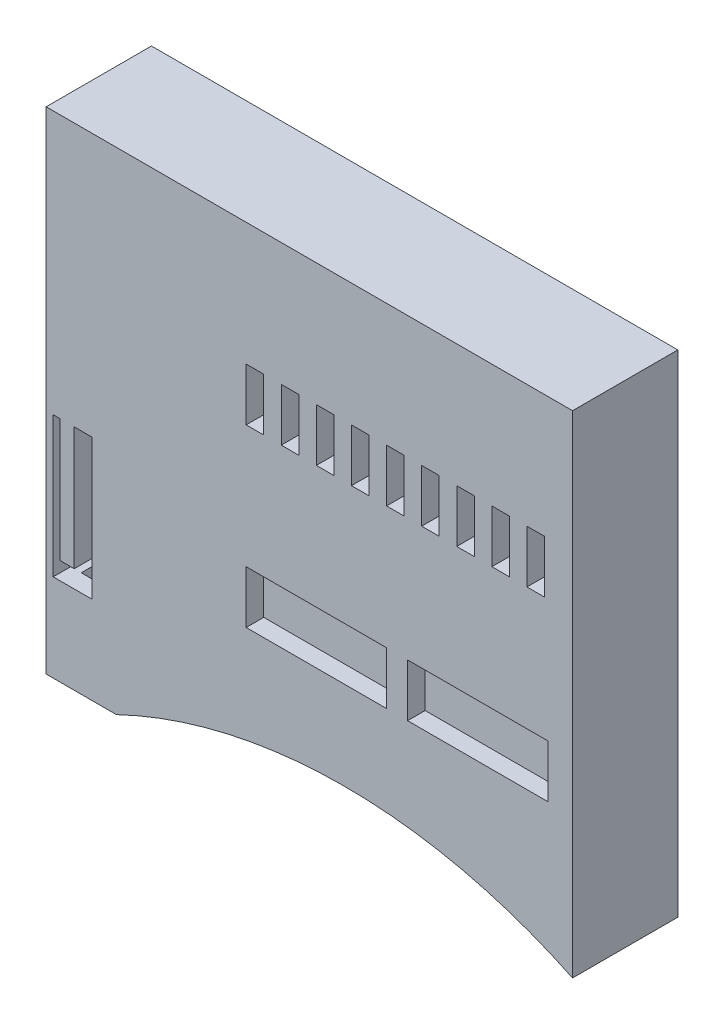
ISO-10303-21;
HEADER;
FILE_DESCRIPTION(('STEP AP214'),'2;1');
FILE_NAME('part.step','',(''),(''),'','','');
FILE_SCHEMA(('AUTOMOTIVE_DESIGN { 1 0 10303 214 1 1 1 1 }'));
ENDSEC;
DATA;
#1=APPLICATION_CONTEXT('core data for automotive mechanical design processes');
#2=APPLICATION_PROTOCOL_DEFINITION('international standard','automotive_design',2000,#1);
#3=PRODUCT_CONTEXT('',#1,'mechanical');
#4=PRODUCT('Part','Part','',(#3));
#5=PRODUCT_RELATED_PRODUCT_CATEGORY('part','',(#4));
#6=PRODUCT_DEFINITION_FORMATION('','',#4);
#7=PRODUCT_DEFINITION_CONTEXT('part definition',#1,'design');
#8=PRODUCT_DEFINITION('design','',#6,#7);
#9=PRODUCT_DEFINITION_SHAPE('','',#8);
#10=(LENGTH_UNIT() NAMED_UNIT(*) SI_UNIT(.MILLI.,.METRE.));
#11=(NAMED_UNIT(*) PLANE_ANGLE_UNIT() SI_UNIT($,.RADIAN.));
#12=(NAMED_UNIT(*) SI_UNIT($,.STERADIAN.) SOLID_ANGLE_UNIT());
#13=UNCERTAINTY_MEASURE_WITH_UNIT(LENGTH_MEASURE(1.E-05),#10,'distance_accuracy_value','');
#14=(GEOMETRIC_REPRESENTATION_CONTEXT(3) GLOBAL_UNCERTAINTY_ASSIGNED_CONTEXT((#13)) GLOBAL_UNIT_ASSIGNED_CONTEXT((#10,
#11,#12)) REPRESENTATION_CONTEXT('',''));
#15=CARTESIAN_POINT('',(0.,0.,0.));
#16=DIRECTION('',(0.,0.,1.));
#17=DIRECTION('',(1.,0.,0.));
#18=AXIS2_PLACEMENT_3D('',#15,#16,#17);
#19=CARTESIAN_POINT('',(-7.,7.,3.));
#20=DIRECTION('',(1.,0.,0.));
#21=DIRECTION('',(0.,1.,0.));
#22=AXIS2_PLACEMENT_3D('',#19,#20,#21);
#23=PLANE('',#22);
#24=DIRECTION('',(0.,0.,-1.));
#25=VECTOR('',#24,1.);
#26=CARTESIAN_POINT('',(-7.,-4.5,3.));
#27=LINE('',#26,#25);
#28=CARTESIAN_POINT('',(-7.,-4.5,2.5));
#29=VERTEX_POINT('',#28);
#30=CARTESIAN_POINT('',(-7.,-4.5,0.5));
#31=VERTEX_POINT('',#30);
#32=EDGE_CURVE('E814',#29,#31,#27,.T.);
#33=ORIENTED_EDGE('',*,*,#32,.F.);
#34=DIRECTION('',(0.,-1.,0.));
#35=VECTOR('',#34,1.);
#36=CARTESIAN_POINT('',(-7.,7.,2.5));
#37=LINE('',#36,#35);
#38=CARTESIAN_POINT('',(-7.,-7.,2.5));
#39=VERTEX_POINT('',#38);
#40=EDGE_CURVE('E1383',#29,#39,#37,.T.);
#41=ORIENTED_EDGE('',*,*,#40,.T.);
#42=DIRECTION('',(0.,0.,-1.));
#43=VECTOR('',#42,1.);
#44=CARTESIAN_POINT('',(-7.,-7.,3.));
#45=LINE('',#44,#43);
#46=CARTESIAN_POINT('',(-7.,-7.,0.5));
#47=VERTEX_POINT('',#46);
#48=EDGE_CURVE('E1381',#39,#47,#45,.T.);
#49=ORIENTED_EDGE('',*,*,#48,.T.);
#50=DIRECTION('',(0.,-1.,0.));
#51=VECTOR('',#50,1.);
#52=CARTESIAN_POINT('',(-7.,7.,0.5));
#53=LINE('',#52,#51);
#54=EDGE_CURVE('E1378',#31,#47,#53,.T.);
#55=ORIENTED_EDGE('',*,*,#54,.F.);
#56=EDGE_LOOP('',(#33,#41,#49,#55));
#57=FACE_BOUND('',#56,.T.);
#58=ADVANCED_FACE('F34',(#57),#23,.T.);
#59=CARTESIAN_POINT('',(-7.5,-7.,3.));
#60=DIRECTION('',(0.,1.,0.));
#61=DIRECTION('',(0.,0.,1.));
#62=AXIS2_PLACEMENT_3D('',#59,#60,#61);
#63=PLANE('',#62);
#64=DIRECTION('',(1.,0.,0.));
#65=VECTOR('',#64,1.);
#66=CARTESIAN_POINT('',(-7.5,-7.,0.));
#67=LINE('',#66,#65);
#68=CARTESIAN_POINT('',(-7.5,-7.,0.));
#69=VERTEX_POINT('',#68);
#70=CARTESIAN_POINT('',(-5.5,-7.,0.));
#71=VERTEX_POINT('',#70);
#72=EDGE_CURVE('E1401',#69,#71,#67,.T.);
#73=ORIENTED_EDGE('',*,*,#72,.T.);
#74=DIRECTION('',(0.,0.,1.));
#75=VECTOR('',#74,1.);
#76=CARTESIAN_POINT('',(-5.5,-7.,0.));
#77=LINE('',#76,#75);
#78=CARTESIAN_POINT('',(-5.5,-7.,0.5));
#79=VERTEX_POINT('',#78);
#80=EDGE_CURVE('E1357',#71,#79,#77,.T.);
#81=ORIENTED_EDGE('',*,*,#80,.T.);
#82=DIRECTION('',(1.,0.,0.));
#83=VECTOR('',#82,1.);
#84=CARTESIAN_POINT('',(-7.5,-7.,0.5));
#85=LINE('',#84,#83);
#86=EDGE_CURVE('E1376',#47,#79,#85,.T.);
#87=ORIENTED_EDGE('',*,*,#86,.F.);
#88=ORIENTED_EDGE('',*,*,#48,.F.);
#89=DIRECTION('',(1.,0.,0.));
#90=VECTOR('',#89,1.);
#91=CARTESIAN_POINT('',(-7.5,-7.,2.5));
#92=LINE('',#91,#90);
#93=CARTESIAN_POINT('',(-5.5,-7.,2.5));
#94=VERTEX_POINT('',#93);
#95=EDGE_CURVE('E1390',#39,#94,#92,.T.);
#96=ORIENTED_EDGE('',*,*,#95,.T.);
#97=CARTESIAN_POINT('',(-5.5,-7.,3.));
#98=VERTEX_POINT('',#97);
#99=EDGE_CURVE('E1355',#94,#98,#77,.T.);
#100=ORIENTED_EDGE('',*,*,#99,.T.);
#101=DIRECTION('',(1.,0.,0.));
#102=VECTOR('',#101,1.);
#103=CARTESIAN_POINT('',(-7.5,-7.,3.));
#104=LINE('',#103,#102);
#105=CARTESIAN_POINT('',(-7.5,-7.,3.));
#106=VERTEX_POINT('',#105);
#107=EDGE_CURVE('E1405',#106,#98,#104,.T.);
#108=ORIENTED_EDGE('',*,*,#107,.F.);
#109=DIRECTION('',(0.,0.,-1.));
#110=VECTOR('',#109,1.);
#111=CARTESIAN_POINT('',(-7.5,-7.,3.));
#112=LINE('',#111,#110);
#113=EDGE_CURVE('E1419',#106,#69,#112,.T.);
#114=ORIENTED_EDGE('',*,*,#113,.T.);
#115=EDGE_LOOP('',(#73,#81,#87,#88,#96,#100,#108,#114));
#116=FACE_BOUND('',#115,.T.);
#117=ADVANCED_FACE('F1594',(#116),#63,.F.);
#118=CARTESIAN_POINT('',(7.5,7.,3.));
#119=DIRECTION('',(-1.,0.,0.));
#120=DIRECTION('',(0.,-1.,0.));
#121=AXIS2_PLACEMENT_3D('',#118,#119,#120);
#122=PLANE('',#121);
#123=DIRECTION('',(0.,1.,0.));
#124=VECTOR('',#123,1.);
#125=CARTESIAN_POINT('',(7.5,7.,0.));
#126=LINE('',#125,#124);
#127=CARTESIAN_POINT('',(7.5,-7.,0.));
#128=VERTEX_POINT('',#127);
#129=CARTESIAN_POINT('',(7.5,7.,0.));
#130=VERTEX_POINT('',#129);
#131=EDGE_CURVE('E1371',#128,#130,#126,.T.);
#132=ORIENTED_EDGE('',*,*,#131,.T.);
#133=DIRECTION('',(0.,0.,-1.));
#134=VECTOR('',#133,1.);
#135=CARTESIAN_POINT('',(7.5,7.,3.));
#136=LINE('',#135,#134);
#137=CARTESIAN_POINT('',(7.5,7.,3.));
#138=VERTEX_POINT('',#137);
#139=EDGE_CURVE('E1425',#138,#130,#136,.T.);
#140=ORIENTED_EDGE('',*,*,#139,.F.);
#141=DIRECTION('',(0.,1.,0.));
#142=VECTOR('',#141,1.);
#143=CARTESIAN_POINT('',(7.5,7.,3.));
#144=LINE('',#143,#142);
#145=CARTESIAN_POINT('',(7.5,-7.,3.));
#146=VERTEX_POINT('',#145);
#147=EDGE_CURVE('E1397',#146,#138,#144,.T.);
#148=ORIENTED_EDGE('',*,*,#147,.F.);
#149=DIRECTION('',(0.,0.,-1.));
#150=VECTOR('',#149,1.);
#151=CARTESIAN_POINT('',(7.5,-7.,3.));
#152=LINE('',#151,#150);
#153=EDGE_CURVE('E1408',#146,#128,#152,.T.);
#154=ORIENTED_EDGE('',*,*,#153,.T.);
#155=EDGE_LOOP('',(#132,#140,#148,#154));
#156=FACE_BOUND('',#155,.T.);
#157=ADVANCED_FACE('F36',(#156),#122,.F.);
#158=CARTESIAN_POINT('',(-7.5,7.,3.));
#159=DIRECTION('',(0.,-1.,0.));
#160=DIRECTION('',(0.,0.,-1.));
#161=AXIS2_PLACEMENT_3D('',#158,#159,#160);
#162=PLANE('',#161);
#163=DIRECTION('',(-1.,0.,0.));
#164=VECTOR('',#163,1.);
#165=CARTESIAN_POINT('',(-7.5,7.,0.));
#166=LINE('',#165,#164);
#167=CARTESIAN_POINT('',(-7.5,7.,0.));
#168=VERTEX_POINT('',#167);
#169=EDGE_CURVE('E1411',#130,#168,#166,.T.);
#170=ORIENTED_EDGE('',*,*,#169,.T.);
#171=DIRECTION('',(0.,0.,-1.));
#172=VECTOR('',#171,1.);
#173=CARTESIAN_POINT('',(-7.5,7.,3.));
#174=LINE('',#173,#172);
#175=CARTESIAN_POINT('',(-7.5,7.,3.));
#176=VERTEX_POINT('',#175);
#177=EDGE_CURVE('E1422',#176,#168,#174,.T.);
#178=ORIENTED_EDGE('',*,*,#177,.F.);
#179=DIRECTION('',(-1.,0.,0.));
#180=VECTOR('',#179,1.);
#181=CARTESIAN_POINT('',(-7.5,7.,3.));
#182=LINE('',#181,#180);
#183=EDGE_CURVE('E1400',#138,#176,#182,.T.);
#184=ORIENTED_EDGE('',*,*,#183,.F.);
#185=ORIENTED_EDGE('',*,*,#139,.T.);
#186=EDGE_LOOP('',(#170,#178,#184,#185));
#187=FACE_BOUND('',#186,.T.);
#188=ADVANCED_FACE('F2725',(#187),#162,.F.);
#189=CARTESIAN_POINT('',(-7.5,7.,3.));
#190=DIRECTION('',(1.,0.,0.));
#191=DIRECTION('',(0.,1.,0.));
#192=AXIS2_PLACEMENT_3D('',#189,#190,#191);
#193=PLANE('',#192);
#194=DIRECTION('',(0.,-1.,0.));
#195=VECTOR('',#194,1.);
#196=CARTESIAN_POINT('',(-7.5,7.,0.));
#197=LINE('',#196,#195);
#198=EDGE_CURVE('E1413',#168,#69,#197,.T.);
#199=ORIENTED_EDGE('',*,*,#198,.T.);
#200=ORIENTED_EDGE('',*,*,#113,.F.);
#201=DIRECTION('',(0.,-1.,0.));
#202=VECTOR('',#201,1.);
#203=CARTESIAN_POINT('',(-7.5,7.,3.));
#204=LINE('',#203,#202);
#205=EDGE_CURVE('E1403',#176,#106,#204,.T.);
#206=ORIENTED_EDGE('',*,*,#205,.F.);
#207=ORIENTED_EDGE('',*,*,#177,.T.);
#208=EDGE_LOOP('',(#199,#200,#206,#207));
#209=FACE_BOUND('',#208,.T.);
#210=ADVANCED_FACE('F1970',(#209),#193,.F.);
#211=CARTESIAN_POINT('',(0.,0.,3.));
#212=DIRECTION('',(0.,0.,1.));
#213=DIRECTION('',(1.,0.,0.));
#214=AXIS2_PLACEMENT_3D('',#211,#212,#213);
#215=PLANE('',#214);
#216=DIRECTION('',(1.,0.,0.));
#217=VECTOR('',#216,1.);
#218=CARTESIAN_POINT('',(-6.58169335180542,-4.5,3.));
#219=LINE('',#218,#217);
#220=CARTESIAN_POINT('',(-7.3,-4.5,3.));
#221=VERTEX_POINT('',#220);
#222=CARTESIAN_POINT('',(-6.2,-4.5,3.));
#223=VERTEX_POINT('',#222);
#224=EDGE_CURVE('E49',#221,#223,#219,.T.);
#225=ORIENTED_EDGE('',*,*,#224,.F.);
#226=DIRECTION('',(0.,-1.,0.));
#227=VECTOR('',#226,1.);
#228=CARTESIAN_POINT('',(-7.3,-4.5,3.));
#229=LINE('',#228,#227);
#230=CARTESIAN_POINT('',(-7.3,-0.5,3.));
#231=VERTEX_POINT('',#230);
#232=EDGE_CURVE('E747',#231,#221,#229,.T.);
#233=ORIENTED_EDGE('',*,*,#232,.F.);
#234=DIRECTION('',(-1.,0.,0.));
#235=VECTOR('',#234,1.);
#236=CARTESIAN_POINT('',(-7.3,-0.5,3.));
#237=LINE('',#236,#235);
#238=CARTESIAN_POINT('',(-7.1,-0.5,3.));
#239=VERTEX_POINT('',#238);
#240=EDGE_CURVE('E778',#239,#231,#237,.T.);
#241=ORIENTED_EDGE('',*,*,#240,.F.);
#242=DIRECTION('',(0.,1.,0.));
#243=VECTOR('',#242,1.);
#244=CARTESIAN_POINT('',(-7.1,-0.5,3.));
#245=LINE('',#244,#243);
#246=CARTESIAN_POINT('',(-7.1,-4.,3.));
#247=VERTEX_POINT('',#246);
#248=EDGE_CURVE('E775',#247,#239,#245,.T.);
#249=ORIENTED_EDGE('',*,*,#248,.F.);
#250=DIRECTION('',(-1.,0.,0.));
#251=VECTOR('',#250,1.);
#252=CARTESIAN_POINT('',(-7.1,-4.,3.));
#253=LINE('',#252,#251);
#254=CARTESIAN_POINT('',(-6.7,-4.,3.));
#255=VERTEX_POINT('',#254);
#256=EDGE_CURVE('E772',#255,#247,#253,.T.);
#257=ORIENTED_EDGE('',*,*,#256,.F.);
#258=DIRECTION('',(0.,-1.,0.));
#259=VECTOR('',#258,1.);
#260=CARTESIAN_POINT('',(-6.7,-4.,3.));
#261=LINE('',#260,#259);
#262=CARTESIAN_POINT('',(-6.7,-0.5,3.));
#263=VERTEX_POINT('',#262);
#264=EDGE_CURVE('E769',#263,#255,#261,.T.);
#265=ORIENTED_EDGE('',*,*,#264,.F.);
#266=DIRECTION('',(-1.,0.,0.));
#267=VECTOR('',#266,1.);
#268=CARTESIAN_POINT('',(-6.7,-0.5,3.));
#269=LINE('',#268,#267);
#270=CARTESIAN_POINT('',(-6.2,-0.5,3.));
#271=VERTEX_POINT('',#270);
#272=EDGE_CURVE('E766',#271,#263,#269,.T.);
#273=ORIENTED_EDGE('',*,*,#272,.F.);
#274=DIRECTION('',(0.,1.,0.));
#275=VECTOR('',#274,1.);
#276=CARTESIAN_POINT('',(-6.2,-0.5,3.));
#277=LINE('',#276,#275);
#278=EDGE_CURVE('E763',#223,#271,#277,.T.);
#279=ORIENTED_EDGE('',*,*,#278,.F.);
#280=EDGE_LOOP('',(#225,#233,#241,#249,#257,#265,#273,#279));
#281=FACE_BOUND('',#280,.T.);
#282=DIRECTION('',(-1.,0.,0.));
#283=VECTOR('',#282,1.);
#284=CARTESIAN_POINT('',(-0.800000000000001,3.5,3.));
#285=LINE('',#284,#283);
#286=CARTESIAN_POINT('',(-0.300000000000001,3.5,3.));
#287=VERTEX_POINT('',#286);
#288=CARTESIAN_POINT('',(-0.800000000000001,3.5,3.));
#289=VERTEX_POINT('',#288);
#290=EDGE_CURVE('E820',#287,#289,#285,.T.);
#291=ORIENTED_EDGE('',*,*,#290,.F.);
#292=DIRECTION('',(0.,1.,0.));
#293=VECTOR('',#292,1.);
#294=CARTESIAN_POINT('',(-0.300000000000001,3.5,3.));
#295=LINE('',#294,#293);
#296=CARTESIAN_POINT('',(-0.300000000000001,2.,3.));
#297=VERTEX_POINT('',#296);
#298=EDGE_CURVE('E829',#297,#287,#295,.T.);
#299=ORIENTED_EDGE('',*,*,#298,.F.);
#300=DIRECTION('',(1.,0.,0.));
#301=VECTOR('',#300,1.);
#302=CARTESIAN_POINT('',(-0.800000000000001,2.,3.));
#303=LINE('',#302,#301);
#304=CARTESIAN_POINT('',(-0.800000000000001,2.,3.));
#305=VERTEX_POINT('',#304);
#306=EDGE_CURVE('E826',#305,#297,#303,.T.);
#307=ORIENTED_EDGE('',*,*,#306,.F.);
#308=DIRECTION('',(0.,-1.,0.));
#309=VECTOR('',#308,1.);
#310=CARTESIAN_POINT('',(-0.800000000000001,3.5,3.));
#311=LINE('',#310,#309);
#312=EDGE_CURVE('E822',#289,#305,#311,.T.);
#313=ORIENTED_EDGE('',*,*,#312,.F.);
#314=EDGE_LOOP('',(#291,#299,#307,#313));
#315=FACE_BOUND('',#314,.T.);
#316=DIRECTION('',(-1.,0.,0.));
#317=VECTOR('',#316,1.);
#318=CARTESIAN_POINT('',(0.199999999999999,3.5,3.));
#319=LINE('',#318,#317);
#320=CARTESIAN_POINT('',(0.699999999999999,3.5,3.));
#321=VERTEX_POINT('',#320);
#322=CARTESIAN_POINT('',(0.199999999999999,3.5,3.));
#323=VERTEX_POINT('',#322);
#324=EDGE_CURVE('E845',#321,#323,#319,.T.);
#325=ORIENTED_EDGE('',*,*,#324,.F.);
#326=DIRECTION('',(0.,1.,0.));
#327=VECTOR('',#326,1.);
#328=CARTESIAN_POINT('',(0.699999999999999,3.5,3.));
#329=LINE('',#328,#327);
#330=CARTESIAN_POINT('',(0.699999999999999,2.,3.));
#331=VERTEX_POINT('',#330);
#332=EDGE_CURVE('E854',#331,#321,#329,.T.);
#333=ORIENTED_EDGE('',*,*,#332,.F.);
#334=DIRECTION('',(1.,0.,0.));
#335=VECTOR('',#334,1.);
#336=CARTESIAN_POINT('',(0.199999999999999,2.,3.));
#337=LINE('',#336,#335);
#338=CARTESIAN_POINT('',(0.199999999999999,2.,3.));
#339=VERTEX_POINT('',#338);
#340=EDGE_CURVE('E851',#339,#331,#337,.T.);
#341=ORIENTED_EDGE('',*,*,#340,.F.);
#342=DIRECTION('',(0.,-1.,0.));
#343=VECTOR('',#342,1.);
#344=CARTESIAN_POINT('',(0.199999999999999,3.5,3.));
#345=LINE('',#344,#343);
#346=EDGE_CURVE('E847',#323,#339,#345,.T.);
#347=ORIENTED_EDGE('',*,*,#346,.F.);
#348=EDGE_LOOP('',(#325,#333,#341,#347));
#349=FACE_BOUND('',#348,.T.);
#350=DIRECTION('',(-1.,0.,0.));
#351=VECTOR('',#350,1.);
#352=CARTESIAN_POINT('',(1.2,3.5,3.));
#353=LINE('',#352,#351);
#354=CARTESIAN_POINT('',(1.7,3.5,3.));
#355=VERTEX_POINT('',#354);
#356=CARTESIAN_POINT('',(1.2,3.5,3.));
#357=VERTEX_POINT('',#356);
#358=EDGE_CURVE('E869',#355,#357,#353,.T.);
#359=ORIENTED_EDGE('',*,*,#358,.F.);
#360=DIRECTION('',(0.,1.,0.));
#361=VECTOR('',#360,1.);
#362=CARTESIAN_POINT('',(1.7,3.5,3.));
#363=LINE('',#362,#361);
#364=CARTESIAN_POINT('',(1.7,2.,3.));
#365=VERTEX_POINT('',#364);
#366=EDGE_CURVE('E878',#365,#355,#363,.T.);
#367=ORIENTED_EDGE('',*,*,#366,.F.);
#368=DIRECTION('',(1.,0.,0.));
#369=VECTOR('',#368,1.);
#370=CARTESIAN_POINT('',(1.2,2.,3.));
#371=LINE('',#370,#369);
#372=CARTESIAN_POINT('',(1.2,2.,3.));
#373=VERTEX_POINT('',#372);
#374=EDGE_CURVE('E875',#373,#365,#371,.T.);
#375=ORIENTED_EDGE('',*,*,#374,.F.);
#376=DIRECTION('',(0.,-1.,0.));
#377=VECTOR('',#376,1.);
#378=CARTESIAN_POINT('',(1.2,3.5,3.));
#379=LINE('',#378,#377);
#380=EDGE_CURVE('E871',#357,#373,#379,.T.);
#381=ORIENTED_EDGE('',*,*,#380,.F.);
#382=EDGE_LOOP('',(#359,#367,#375,#381));
#383=FACE_BOUND('',#382,.T.);
#384=DIRECTION('',(-1.,0.,0.));
#385=VECTOR('',#384,1.);
#386=CARTESIAN_POINT('',(2.2,3.5,3.));
#387=LINE('',#386,#385);
#388=CARTESIAN_POINT('',(2.7,3.5,3.));
#389=VERTEX_POINT('',#388);
#390=CARTESIAN_POINT('',(2.2,3.5,3.));
#391=VERTEX_POINT('',#390);
#392=EDGE_CURVE('E893',#389,#391,#387,.T.);
#393=ORIENTED_EDGE('',*,*,#392,.F.);
#394=DIRECTION('',(0.,1.,0.));
#395=VECTOR('',#394,1.);
#396=CARTESIAN_POINT('',(2.7,3.5,3.));
#397=LINE('',#396,#395);
#398=CARTESIAN_POINT('',(2.7,2.,3.));
#399=VERTEX_POINT('',#398);
#400=EDGE_CURVE('E902',#399,#389,#397,.T.);
#401=ORIENTED_EDGE('',*,*,#400,.F.);
#402=DIRECTION('',(1.,0.,0.));
#403=VECTOR('',#402,1.);
#404=CARTESIAN_POINT('',(2.2,2.,3.));
#405=LINE('',#404,#403);
#406=CARTESIAN_POINT('',(2.2,2.,3.));
#407=VERTEX_POINT('',#406);
#408=EDGE_CURVE('E899',#407,#399,#405,.T.);
#409=ORIENTED_EDGE('',*,*,#408,.F.);
#410=DIRECTION('',(0.,-1.,0.));
#411=VECTOR('',#410,1.);
#412=CARTESIAN_POINT('',(2.2,3.5,3.));
#413=LINE('',#412,#411);
#414=EDGE_CURVE('E895',#391,#407,#413,.T.);
#415=ORIENTED_EDGE('',*,*,#414,.F.);
#416=EDGE_LOOP('',(#393,#401,#409,#415));
#417=FACE_BOUND('',#416,.T.);
#418=DIRECTION('',(-1.,0.,0.));
#419=VECTOR('',#418,1.);
#420=CARTESIAN_POINT('',(3.2,3.5,3.));
#421=LINE('',#420,#419);
#422=CARTESIAN_POINT('',(3.7,3.5,3.));
#423=VERTEX_POINT('',#422);
#424=CARTESIAN_POINT('',(3.2,3.5,3.));
#425=VERTEX_POINT('',#424);
#426=EDGE_CURVE('E917',#423,#425,#421,.T.);
#427=ORIENTED_EDGE('',*,*,#426,.F.);
#428=DIRECTION('',(0.,1.,0.));
#429=VECTOR('',#428,1.);
#430=CARTESIAN_POINT('',(3.7,3.5,3.));
#431=LINE('',#430,#429);
#432=CARTESIAN_POINT('',(3.7,2.,3.));
#433=VERTEX_POINT('',#432);
#434=EDGE_CURVE('E926',#433,#423,#431,.T.);
#435=ORIENTED_EDGE('',*,*,#434,.F.);
#436=DIRECTION('',(1.,0.,0.));
#437=VECTOR('',#436,1.);
#438=CARTESIAN_POINT('',(3.2,2.,3.));
#439=LINE('',#438,#437);
#440=CARTESIAN_POINT('',(3.2,2.,3.));
#441=VERTEX_POINT('',#440);
#442=EDGE_CURVE('E923',#441,#433,#439,.T.);
#443=ORIENTED_EDGE('',*,*,#442,.F.);
#444=DIRECTION('',(0.,-1.,0.));
#445=VECTOR('',#444,1.);
#446=CARTESIAN_POINT('',(3.2,3.5,3.));
#447=LINE('',#446,#445);
#448=EDGE_CURVE('E919',#425,#441,#447,.T.);
#449=ORIENTED_EDGE('',*,*,#448,.F.);
#450=EDGE_LOOP('',(#427,#435,#443,#449));
#451=FACE_BOUND('',#450,.T.);
#452=DIRECTION('',(-1.,0.,0.));
#453=VECTOR('',#452,1.);
#454=CARTESIAN_POINT('',(4.2,3.5,3.));
#455=LINE('',#454,#453);
#456=CARTESIAN_POINT('',(4.7,3.5,3.));
#457=VERTEX_POINT('',#456);
#458=CARTESIAN_POINT('',(4.2,3.5,3.));
#459=VERTEX_POINT('',#458);
#460=EDGE_CURVE('E941',#457,#459,#455,.T.);
#461=ORIENTED_EDGE('',*,*,#460,.F.);
#462=DIRECTION('',(0.,1.,0.));
#463=VECTOR('',#462,1.);
#464=CARTESIAN_POINT('',(4.7,3.5,3.));
#465=LINE('',#464,#463);
#466=CARTESIAN_POINT('',(4.7,2.,3.));
#467=VERTEX_POINT('',#466);
#468=EDGE_CURVE('E950',#467,#457,#465,.T.);
#469=ORIENTED_EDGE('',*,*,#468,.F.);
#470=DIRECTION('',(1.,0.,0.));
#471=VECTOR('',#470,1.);
#472=CARTESIAN_POINT('',(4.2,2.,3.));
#473=LINE('',#472,#471);
#474=CARTESIAN_POINT('',(4.2,2.,3.));
#475=VERTEX_POINT('',#474);
#476=EDGE_CURVE('E947',#475,#467,#473,.T.);
#477=ORIENTED_EDGE('',*,*,#476,.F.);
#478=DIRECTION('',(0.,-1.,0.));
#479=VECTOR('',#478,1.);
#480=CARTESIAN_POINT('',(4.2,3.5,3.));
#481=LINE('',#480,#479);
#482=EDGE_CURVE('E943',#459,#475,#481,.T.);
#483=ORIENTED_EDGE('',*,*,#482,.F.);
#484=EDGE_LOOP('',(#461,#469,#477,#483));
#485=FACE_BOUND('',#484,.T.);
#486=DIRECTION('',(-1.,0.,0.));
#487=VECTOR('',#486,1.);
#488=CARTESIAN_POINT('',(5.2,3.5,3.));
#489=LINE('',#488,#487);
#490=CARTESIAN_POINT('',(5.7,3.5,3.));
#491=VERTEX_POINT('',#490);
#492=CARTESIAN_POINT('',(5.2,3.5,3.));
#493=VERTEX_POINT('',#492);
#494=EDGE_CURVE('E965',#491,#493,#489,.T.);
#495=ORIENTED_EDGE('',*,*,#494,.F.);
#496=DIRECTION('',(0.,1.,0.));
#497=VECTOR('',#496,1.);
#498=CARTESIAN_POINT('',(5.7,3.5,3.));
#499=LINE('',#498,#497);
#500=CARTESIAN_POINT('',(5.7,2.,3.));
#501=VERTEX_POINT('',#500);
#502=EDGE_CURVE('E974',#501,#491,#499,.T.);
#503=ORIENTED_EDGE('',*,*,#502,.F.);
#504=DIRECTION('',(1.,0.,0.));
#505=VECTOR('',#504,1.);
#506=CARTESIAN_POINT('',(5.2,2.,3.));
#507=LINE('',#506,#505);
#508=CARTESIAN_POINT('',(5.2,2.,3.));
#509=VERTEX_POINT('',#508);
#510=EDGE_CURVE('E971',#509,#501,#507,.T.);
#511=ORIENTED_EDGE('',*,*,#510,.F.);
#512=DIRECTION('',(0.,-1.,0.));
#513=VECTOR('',#512,1.);
#514=CARTESIAN_POINT('',(5.2,3.5,3.));
#515=LINE('',#514,#513);
#516=EDGE_CURVE('E967',#493,#509,#515,.T.);
#517=ORIENTED_EDGE('',*,*,#516,.F.);
#518=EDGE_LOOP('',(#495,#503,#511,#517));
#519=FACE_BOUND('',#518,.T.);
#520=DIRECTION('',(-1.,0.,0.));
#521=VECTOR('',#520,1.);
#522=CARTESIAN_POINT('',(6.2,3.5,3.));
#523=LINE('',#522,#521);
#524=CARTESIAN_POINT('',(6.7,3.5,3.));
#525=VERTEX_POINT('',#524);
#526=CARTESIAN_POINT('',(6.2,3.5,3.));
#527=VERTEX_POINT('',#526);
#528=EDGE_CURVE('E819',#525,#527,#523,.T.);
#529=ORIENTED_EDGE('',*,*,#528,.F.);
#530=DIRECTION('',(0.,1.,0.));
#531=VECTOR('',#530,1.);
#532=CARTESIAN_POINT('',(6.7,3.5,3.));
#533=LINE('',#532,#531);
#534=CARTESIAN_POINT('',(6.7,2.,3.));
#535=VERTEX_POINT('',#534);
#536=EDGE_CURVE('E996',#535,#525,#533,.T.);
#537=ORIENTED_EDGE('',*,*,#536,.F.);
#538=DIRECTION('',(1.,0.,0.));
#539=VECTOR('',#538,1.);
#540=CARTESIAN_POINT('',(6.2,2.,3.));
#541=LINE('',#540,#539);
#542=CARTESIAN_POINT('',(6.2,2.,3.));
#543=VERTEX_POINT('',#542);
#544=EDGE_CURVE('E993',#543,#535,#541,.T.);
#545=ORIENTED_EDGE('',*,*,#544,.F.);
#546=DIRECTION('',(0.,-1.,0.));
#547=VECTOR('',#546,1.);
#548=CARTESIAN_POINT('',(6.2,3.5,3.));
#549=LINE('',#548,#547);
#550=EDGE_CURVE('E990',#527,#543,#549,.T.);
#551=ORIENTED_EDGE('',*,*,#550,.F.);
#552=EDGE_LOOP('',(#529,#537,#545,#551));
#553=FACE_BOUND('',#552,.T.);
#554=DIRECTION('',(0.,-1.,0.));
#555=VECTOR('',#554,1.);
#556=CARTESIAN_POINT('',(-1.8,3.5,3.));
#557=LINE('',#556,#555);
#558=CARTESIAN_POINT('',(-1.8,3.5,3.));
#559=VERTEX_POINT('',#558);
#560=CARTESIAN_POINT('',(-1.8,2.,3.));
#561=VERTEX_POINT('',#560);
#562=EDGE_CURVE('E1203',#559,#561,#557,.T.);
#563=ORIENTED_EDGE('',*,*,#562,.F.);
#564=DIRECTION('',(-1.,0.,0.));
#565=VECTOR('',#564,1.);
#566=CARTESIAN_POINT('',(-1.8,3.5,3.));
#567=LINE('',#566,#565);
#568=CARTESIAN_POINT('',(-1.3,3.5,3.));
#569=VERTEX_POINT('',#568);
#570=EDGE_CURVE('E1211',#569,#559,#567,.T.);
#571=ORIENTED_EDGE('',*,*,#570,.F.);
#572=DIRECTION('',(0.,1.,0.));
#573=VECTOR('',#572,1.);
#574=CARTESIAN_POINT('',(-1.3,3.5,3.));
#575=LINE('',#574,#573);
#576=CARTESIAN_POINT('',(-1.3,2.,3.));
#577=VERTEX_POINT('',#576);
#578=EDGE_CURVE('E1208',#577,#569,#575,.T.);
#579=ORIENTED_EDGE('',*,*,#578,.F.);
#580=DIRECTION('',(1.,0.,0.));
#581=VECTOR('',#580,1.);
#582=CARTESIAN_POINT('',(-1.8,2.,3.));
#583=LINE('',#582,#581);
#584=EDGE_CURVE('E1205',#561,#577,#583,.T.);
#585=ORIENTED_EDGE('',*,*,#584,.F.);
#586=EDGE_LOOP('',(#563,#571,#579,#585));
#587=FACE_BOUND('',#586,.T.);
#588=DIRECTION('',(0.,-1.,0.));
#589=VECTOR('',#588,1.);
#590=CARTESIAN_POINT('',(-1.8,-1.5,3.));
#591=LINE('',#590,#589);
#592=CARTESIAN_POINT('',(-1.8,-1.5,3.));
#593=VERTEX_POINT('',#592);
#594=CARTESIAN_POINT('',(-1.8,-3.,3.));
#595=VERTEX_POINT('',#594);
#596=EDGE_CURVE('E1266',#593,#595,#591,.T.);
#597=ORIENTED_EDGE('',*,*,#596,.F.);
#598=DIRECTION('',(-1.,0.,0.));
#599=VECTOR('',#598,1.);
#600=CARTESIAN_POINT('',(-1.8,-1.5,3.));
#601=LINE('',#600,#599);
#602=CARTESIAN_POINT('',(2.2,-1.5,3.));
#603=VERTEX_POINT('',#602);
#604=EDGE_CURVE('E1256',#603,#593,#601,.T.);
#605=ORIENTED_EDGE('',*,*,#604,.F.);
#606=DIRECTION('',(0.,1.,0.));
#607=VECTOR('',#606,1.);
#608=CARTESIAN_POINT('',(2.2,-1.5,3.));
#609=LINE('',#608,#607);
#610=CARTESIAN_POINT('',(2.2,-3.,3.));
#611=VERTEX_POINT('',#610);
#612=EDGE_CURVE('E1272',#611,#603,#609,.T.);
#613=ORIENTED_EDGE('',*,*,#612,.F.);
#614=DIRECTION('',(1.,0.,0.));
#615=VECTOR('',#614,1.);
#616=CARTESIAN_POINT('',(-1.8,-3.,3.));
#617=LINE('',#616,#615);
#618=EDGE_CURVE('E1268',#595,#611,#617,.T.);
#619=ORIENTED_EDGE('',*,*,#618,.F.);
#620=EDGE_LOOP('',(#597,#605,#613,#619));
#621=FACE_BOUND('',#620,.T.);
#622=DIRECTION('',(-1.,0.,0.));
#623=VECTOR('',#622,1.);
#624=CARTESIAN_POINT('',(6.8,-1.5,3.));
#625=LINE('',#624,#623);
#626=CARTESIAN_POINT('',(6.8,-1.5,3.));
#627=VERTEX_POINT('',#626);
#628=CARTESIAN_POINT('',(2.8,-1.5,3.));
#629=VERTEX_POINT('',#628);
#630=EDGE_CURVE('E1251',#627,#629,#625,.T.);
#631=ORIENTED_EDGE('',*,*,#630,.F.);
#632=DIRECTION('',(0.,1.,0.));
#633=VECTOR('',#632,1.);
#634=CARTESIAN_POINT('',(6.8,-1.5,3.));
#635=LINE('',#634,#633);
#636=CARTESIAN_POINT('',(6.8,-3.,3.));
#637=VERTEX_POINT('',#636);
#638=EDGE_CURVE('E1296',#637,#627,#635,.T.);
#639=ORIENTED_EDGE('',*,*,#638,.F.);
#640=DIRECTION('',(1.,0.,0.));
#641=VECTOR('',#640,1.);
#642=CARTESIAN_POINT('',(6.8,-3.,3.));
#643=LINE('',#642,#641);
#644=CARTESIAN_POINT('',(2.8,-3.,3.));
#645=VERTEX_POINT('',#644);
#646=EDGE_CURVE('E1310',#645,#637,#643,.T.);
#647=ORIENTED_EDGE('',*,*,#646,.F.);
#648=DIRECTION('',(0.,-1.,0.));
#649=VECTOR('',#648,1.);
#650=CARTESIAN_POINT('',(2.8,-1.5,3.));
#651=LINE('',#650,#649);
#652=EDGE_CURVE('E1307',#629,#645,#651,.T.);
#653=ORIENTED_EDGE('',*,*,#652,.F.);
#654=EDGE_LOOP('',(#631,#639,#647,#653));
#655=FACE_BOUND('',#654,.T.);
#656=CARTESIAN_POINT('',(0.999999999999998,-20.5185058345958,3.));
#657=DIRECTION('',(0.,0.,1.));
#658=DIRECTION('',(-1.,0.,0.));
#659=AXIS2_PLACEMENT_3D('',#656,#657,#658);
#660=CIRCLE('',#659,15.);
#661=EDGE_CURVE('E1351',#146,#98,#660,.T.);
#662=ORIENTED_EDGE('',*,*,#661,.F.);
#663=ORIENTED_EDGE('',*,*,#147,.T.);
#664=ORIENTED_EDGE('',*,*,#183,.T.);
#665=ORIENTED_EDGE('',*,*,#205,.T.);
#666=ORIENTED_EDGE('',*,*,#107,.T.);
#667=EDGE_LOOP('',(#662,#663,#664,#665,#666));
#668=FACE_BOUND('',#667,.T.);
#669=ADVANCED_FACE('F1569',(#281,#315,#349,#383,#417,#451,#485,#519,#553,#587,#621,#655,#668),
#215,.T.);
#670=CARTESIAN_POINT('',(0.,0.,0.));
#671=DIRECTION('',(0.,0.,1.));
#672=DIRECTION('',(1.,0.,0.));
#673=AXIS2_PLACEMENT_3D('',#670,#671,#672);
#674=PLANE('',#673);
#675=DIRECTION('',(0.,-1.,0.));
#676=VECTOR('',#675,1.);
#677=CARTESIAN_POINT('',(-7.3,-4.5,0.));
#678=LINE('',#677,#676);
#679=CARTESIAN_POINT('',(-7.3,-0.5,0.));
#680=VERTEX_POINT('',#679);
#681=CARTESIAN_POINT('',(-7.3,-4.5,0.));
#682=VERTEX_POINT('',#681);
#683=EDGE_CURVE('E745',#680,#682,#678,.T.);
#684=ORIENTED_EDGE('',*,*,#683,.T.);
#685=DIRECTION('',(1.,0.,0.));
#686=VECTOR('',#685,1.);
#687=CARTESIAN_POINT('',(-6.2,-4.5,0.));
#688=LINE('',#687,#686);
#689=CARTESIAN_POINT('',(-6.2,-4.5,0.));
#690=VERTEX_POINT('',#689);
#691=EDGE_CURVE('E726',#682,#690,#688,.T.);
#692=ORIENTED_EDGE('',*,*,#691,.T.);
#693=DIRECTION('',(0.,1.,0.));
#694=VECTOR('',#693,1.);
#695=CARTESIAN_POINT('',(-6.2,-0.5,0.));
#696=LINE('',#695,#694);
#697=CARTESIAN_POINT('',(-6.2,-0.5,0.));
#698=VERTEX_POINT('',#697);
#699=EDGE_CURVE('E735',#690,#698,#696,.T.);
#700=ORIENTED_EDGE('',*,*,#699,.T.);
#701=DIRECTION('',(-1.,0.,0.));
#702=VECTOR('',#701,1.);
#703=CARTESIAN_POINT('',(-6.7,-0.5,0.));
#704=LINE('',#703,#702);
#705=CARTESIAN_POINT('',(-6.7,-0.5,0.));
#706=VERTEX_POINT('',#705);
#707=EDGE_CURVE('E57',#698,#706,#704,.T.);
#708=ORIENTED_EDGE('',*,*,#707,.T.);
#709=DIRECTION('',(0.,-1.,0.));
#710=VECTOR('',#709,1.);
#711=CARTESIAN_POINT('',(-6.7,-4.,0.));
#712=LINE('',#711,#710);
#713=CARTESIAN_POINT('',(-6.7,-4.,0.));
#714=VERTEX_POINT('',#713);
#715=EDGE_CURVE('E751',#706,#714,#712,.T.);
#716=ORIENTED_EDGE('',*,*,#715,.T.);
#717=DIRECTION('',(-1.,0.,0.));
#718=VECTOR('',#717,1.);
#719=CARTESIAN_POINT('',(-7.1,-4.,0.));
#720=LINE('',#719,#718);
#721=CARTESIAN_POINT('',(-7.1,-4.,0.));
#722=VERTEX_POINT('',#721);
#723=EDGE_CURVE('E754',#714,#722,#720,.T.);
#724=ORIENTED_EDGE('',*,*,#723,.T.);
#725=DIRECTION('',(0.,1.,0.));
#726=VECTOR('',#725,1.);
#727=CARTESIAN_POINT('',(-7.1,-0.5,0.));
#728=LINE('',#727,#726);
#729=CARTESIAN_POINT('',(-7.1,-0.5,0.));
#730=VERTEX_POINT('',#729);
#731=EDGE_CURVE('E757',#722,#730,#728,.T.);
#732=ORIENTED_EDGE('',*,*,#731,.T.);
#733=DIRECTION('',(-1.,0.,0.));
#734=VECTOR('',#733,1.);
#735=CARTESIAN_POINT('',(-7.3,-0.5,0.));
#736=LINE('',#735,#734);
#737=EDGE_CURVE('E760',#730,#680,#736,.T.);
#738=ORIENTED_EDGE('',*,*,#737,.T.);
#739=EDGE_LOOP('',(#684,#692,#700,#708,#716,#724,#732,#738));
#740=FACE_BOUND('',#739,.T.);
#741=DIRECTION('',(0.,1.,0.));
#742=VECTOR('',#741,1.);
#743=CARTESIAN_POINT('',(-0.300000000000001,0.,0.));
#744=LINE('',#743,#742);
#745=CARTESIAN_POINT('',(-0.300000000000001,2.,0.));
#746=VERTEX_POINT('',#745);
#747=CARTESIAN_POINT('',(-0.300000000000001,3.5,0.));
#748=VERTEX_POINT('',#747);
#749=EDGE_CURVE('E1194',#746,#748,#744,.T.);
#750=ORIENTED_EDGE('',*,*,#749,.T.);
#751=DIRECTION('',(-1.,0.,0.));
#752=VECTOR('',#751,1.);
#753=CARTESIAN_POINT('',(0.,3.5,0.));
#754=LINE('',#753,#752);
#755=CARTESIAN_POINT('',(-0.800000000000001,3.5,0.));
#756=VERTEX_POINT('',#755);
#757=EDGE_CURVE('E1200',#748,#756,#754,.T.);
#758=ORIENTED_EDGE('',*,*,#757,.T.);
#759=DIRECTION('',(0.,-1.,0.));
#760=VECTOR('',#759,1.);
#761=CARTESIAN_POINT('',(-0.8,0.,0.));
#762=LINE('',#761,#760);
#763=CARTESIAN_POINT('',(-0.800000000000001,2.,0.));
#764=VERTEX_POINT('',#763);
#765=EDGE_CURVE('E1182',#756,#764,#762,.T.);
#766=ORIENTED_EDGE('',*,*,#765,.T.);
#767=DIRECTION('',(1.,0.,0.));
#768=VECTOR('',#767,1.);
#769=CARTESIAN_POINT('',(0.,2.,0.));
#770=LINE('',#769,#768);
#771=EDGE_CURVE('E1188',#764,#746,#770,.T.);
#772=ORIENTED_EDGE('',*,*,#771,.T.);
#773=EDGE_LOOP('',(#750,#758,#766,#772));
#774=FACE_BOUND('',#773,.T.);
#775=DIRECTION('',(0.,1.,0.));
#776=VECTOR('',#775,1.);
#777=CARTESIAN_POINT('',(0.699999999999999,0.,0.));
#778=LINE('',#777,#776);
#779=CARTESIAN_POINT('',(0.699999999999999,2.,0.));
#780=VERTEX_POINT('',#779);
#781=CARTESIAN_POINT('',(0.699999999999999,3.5,0.));
#782=VERTEX_POINT('',#781);
#783=EDGE_CURVE('E1170',#780,#782,#778,.T.);
#784=ORIENTED_EDGE('',*,*,#783,.T.);
#785=DIRECTION('',(-1.,0.,0.));
#786=VECTOR('',#785,1.);
#787=CARTESIAN_POINT('',(0.,3.5,0.));
#788=LINE('',#787,#786);
#789=CARTESIAN_POINT('',(0.199999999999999,3.5,0.));
#790=VERTEX_POINT('',#789);
#791=EDGE_CURVE('E1176',#782,#790,#788,.T.);
#792=ORIENTED_EDGE('',*,*,#791,.T.);
#793=DIRECTION('',(0.,-1.,0.));
#794=VECTOR('',#793,1.);
#795=CARTESIAN_POINT('',(0.2,0.,0.));
#796=LINE('',#795,#794);
#797=CARTESIAN_POINT('',(0.199999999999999,2.,0.));
#798=VERTEX_POINT('',#797);
#799=EDGE_CURVE('E1158',#790,#798,#796,.T.);
#800=ORIENTED_EDGE('',*,*,#799,.T.);
#801=DIRECTION('',(1.,0.,0.));
#802=VECTOR('',#801,1.);
#803=CARTESIAN_POINT('',(0.,2.,0.));
#804=LINE('',#803,#802);
#805=EDGE_CURVE('E1164',#798,#780,#804,.T.);
#806=ORIENTED_EDGE('',*,*,#805,.T.);
#807=EDGE_LOOP('',(#784,#792,#800,#806));
#808=FACE_BOUND('',#807,.T.);
#809=DIRECTION('',(0.,1.,0.));
#810=VECTOR('',#809,1.);
#811=CARTESIAN_POINT('',(1.7,0.,0.));
#812=LINE('',#811,#810);
#813=CARTESIAN_POINT('',(1.7,2.,0.));
#814=VERTEX_POINT('',#813);
#815=CARTESIAN_POINT('',(1.7,3.5,0.));
#816=VERTEX_POINT('',#815);
#817=EDGE_CURVE('E1146',#814,#816,#812,.T.);
#818=ORIENTED_EDGE('',*,*,#817,.T.);
#819=DIRECTION('',(-1.,0.,0.));
#820=VECTOR('',#819,1.);
#821=CARTESIAN_POINT('',(0.,3.5,0.));
#822=LINE('',#821,#820);
#823=CARTESIAN_POINT('',(1.2,3.5,0.));
#824=VERTEX_POINT('',#823);
#825=EDGE_CURVE('E1152',#816,#824,#822,.T.);
#826=ORIENTED_EDGE('',*,*,#825,.T.);
#827=DIRECTION('',(0.,-1.,0.));
#828=VECTOR('',#827,1.);
#829=CARTESIAN_POINT('',(1.2,0.,0.));
#830=LINE('',#829,#828);
#831=CARTESIAN_POINT('',(1.2,2.,0.));
#832=VERTEX_POINT('',#831);
#833=EDGE_CURVE('E1134',#824,#832,#830,.T.);
#834=ORIENTED_EDGE('',*,*,#833,.T.);
#835=DIRECTION('',(1.,0.,0.));
#836=VECTOR('',#835,1.);
#837=CARTESIAN_POINT('',(0.,2.,0.));
#838=LINE('',#837,#836);
#839=EDGE_CURVE('E1140',#832,#814,#838,.T.);
#840=ORIENTED_EDGE('',*,*,#839,.T.);
#841=EDGE_LOOP('',(#818,#826,#834,#840));
#842=FACE_BOUND('',#841,.T.);
#843=DIRECTION('',(0.,1.,0.));
#844=VECTOR('',#843,1.);
#845=CARTESIAN_POINT('',(2.7,0.,0.));
#846=LINE('',#845,#844);
#847=CARTESIAN_POINT('',(2.7,2.,0.));
#848=VERTEX_POINT('',#847);
#849=CARTESIAN_POINT('',(2.7,3.5,0.));
#850=VERTEX_POINT('',#849);
#851=EDGE_CURVE('E1122',#848,#850,#846,.T.);
#852=ORIENTED_EDGE('',*,*,#851,.T.);
#853=DIRECTION('',(-1.,0.,0.));
#854=VECTOR('',#853,1.);
#855=CARTESIAN_POINT('',(0.,3.5,0.));
#856=LINE('',#855,#854);
#857=CARTESIAN_POINT('',(2.2,3.5,0.));
#858=VERTEX_POINT('',#857);
#859=EDGE_CURVE('E1128',#850,#858,#856,.T.);
#860=ORIENTED_EDGE('',*,*,#859,.T.);
#861=DIRECTION('',(0.,-1.,0.));
#862=VECTOR('',#861,1.);
#863=CARTESIAN_POINT('',(2.2,0.,0.));
#864=LINE('',#863,#862);
#865=CARTESIAN_POINT('',(2.2,2.,0.));
#866=VERTEX_POINT('',#865);
#867=EDGE_CURVE('E1110',#858,#866,#864,.T.);
#868=ORIENTED_EDGE('',*,*,#867,.T.);
#869=DIRECTION('',(1.,0.,0.));
#870=VECTOR('',#869,1.);
#871=CARTESIAN_POINT('',(0.,2.,0.));
#872=LINE('',#871,#870);
#873=EDGE_CURVE('E1116',#866,#848,#872,.T.);
#874=ORIENTED_EDGE('',*,*,#873,.T.);
#875=EDGE_LOOP('',(#852,#860,#868,#874));
#876=FACE_BOUND('',#875,.T.);
#877=DIRECTION('',(0.,1.,0.));
#878=VECTOR('',#877,1.);
#879=CARTESIAN_POINT('',(3.7,0.,0.));
#880=LINE('',#879,#878);
#881=CARTESIAN_POINT('',(3.7,2.,0.));
#882=VERTEX_POINT('',#881);
#883=CARTESIAN_POINT('',(3.7,3.5,0.));
#884=VERTEX_POINT('',#883);
#885=EDGE_CURVE('E1098',#882,#884,#880,.T.);
#886=ORIENTED_EDGE('',*,*,#885,.T.);
#887=DIRECTION('',(-1.,0.,0.));
#888=VECTOR('',#887,1.);
#889=CARTESIAN_POINT('',(0.,3.5,0.));
#890=LINE('',#889,#888);
#891=CARTESIAN_POINT('',(3.2,3.5,0.));
#892=VERTEX_POINT('',#891);
#893=EDGE_CURVE('E1104',#884,#892,#890,.T.);
#894=ORIENTED_EDGE('',*,*,#893,.T.);
#895=DIRECTION('',(0.,-1.,0.));
#896=VECTOR('',#895,1.);
#897=CARTESIAN_POINT('',(3.2,0.,0.));
#898=LINE('',#897,#896);
#899=CARTESIAN_POINT('',(3.2,2.,0.));
#900=VERTEX_POINT('',#899);
#901=EDGE_CURVE('E1086',#892,#900,#898,.T.);
#902=ORIENTED_EDGE('',*,*,#901,.T.);
#903=DIRECTION('',(1.,0.,0.));
#904=VECTOR('',#903,1.);
#905=CARTESIAN_POINT('',(0.,2.,0.));
#906=LINE('',#905,#904);
#907=EDGE_CURVE('E1092',#900,#882,#906,.T.);
#908=ORIENTED_EDGE('',*,*,#907,.T.);
#909=EDGE_LOOP('',(#886,#894,#902,#908));
#910=FACE_BOUND('',#909,.T.);
#911=DIRECTION('',(0.,1.,0.));
#912=VECTOR('',#911,1.);
#913=CARTESIAN_POINT('',(4.7,0.,0.));
#914=LINE('',#913,#912);
#915=CARTESIAN_POINT('',(4.7,2.,0.));
#916=VERTEX_POINT('',#915);
#917=CARTESIAN_POINT('',(4.7,3.5,0.));
#918=VERTEX_POINT('',#917);
#919=EDGE_CURVE('E1074',#916,#918,#914,.T.);
#920=ORIENTED_EDGE('',*,*,#919,.T.);
#921=DIRECTION('',(-1.,0.,0.));
#922=VECTOR('',#921,1.);
#923=CARTESIAN_POINT('',(0.,3.5,0.));
#924=LINE('',#923,#922);
#925=CARTESIAN_POINT('',(4.2,3.5,0.));
#926=VERTEX_POINT('',#925);
#927=EDGE_CURVE('E1080',#918,#926,#924,.T.);
#928=ORIENTED_EDGE('',*,*,#927,.T.);
#929=DIRECTION('',(0.,-1.,0.));
#930=VECTOR('',#929,1.);
#931=CARTESIAN_POINT('',(4.2,0.,0.));
#932=LINE('',#931,#930);
#933=CARTESIAN_POINT('',(4.2,2.,0.));
#934=VERTEX_POINT('',#933);
#935=EDGE_CURVE('E1062',#926,#934,#932,.T.);
#936=ORIENTED_EDGE('',*,*,#935,.T.);
#937=DIRECTION('',(1.,0.,0.));
#938=VECTOR('',#937,1.);
#939=CARTESIAN_POINT('',(0.,2.,0.));
#940=LINE('',#939,#938);
#941=EDGE_CURVE('E1068',#934,#916,#940,.T.);
#942=ORIENTED_EDGE('',*,*,#941,.T.);
#943=EDGE_LOOP('',(#920,#928,#936,#942));
#944=FACE_BOUND('',#943,.T.);
#945=DIRECTION('',(0.,1.,0.));
#946=VECTOR('',#945,1.);
#947=CARTESIAN_POINT('',(5.7,0.,0.));
#948=LINE('',#947,#946);
#949=CARTESIAN_POINT('',(5.7,2.,0.));
#950=VERTEX_POINT('',#949);
#951=CARTESIAN_POINT('',(5.7,3.5,0.));
#952=VERTEX_POINT('',#951);
#953=EDGE_CURVE('E1050',#950,#952,#948,.T.);
#954=ORIENTED_EDGE('',*,*,#953,.T.);
#955=DIRECTION('',(-1.,0.,0.));
#956=VECTOR('',#955,1.);
#957=CARTESIAN_POINT('',(0.,3.5,0.));
#958=LINE('',#957,#956);
#959=CARTESIAN_POINT('',(5.2,3.5,0.));
#960=VERTEX_POINT('',#959);
#961=EDGE_CURVE('E1056',#952,#960,#958,.T.);
#962=ORIENTED_EDGE('',*,*,#961,.T.);
#963=DIRECTION('',(0.,-1.,0.));
#964=VECTOR('',#963,1.);
#965=CARTESIAN_POINT('',(5.2,0.,0.));
#966=LINE('',#965,#964);
#967=CARTESIAN_POINT('',(5.2,2.,0.));
#968=VERTEX_POINT('',#967);
#969=EDGE_CURVE('E1038',#960,#968,#966,.T.);
#970=ORIENTED_EDGE('',*,*,#969,.T.);
#971=DIRECTION('',(1.,0.,0.));
#972=VECTOR('',#971,1.);
#973=CARTESIAN_POINT('',(0.,2.,0.));
#974=LINE('',#973,#972);
#975=EDGE_CURVE('E1044',#968,#950,#974,.T.);
#976=ORIENTED_EDGE('',*,*,#975,.T.);
#977=EDGE_LOOP('',(#954,#962,#970,#976));
#978=FACE_BOUND('',#977,.T.);
#979=DIRECTION('',(0.,1.,0.));
#980=VECTOR('',#979,1.);
#981=CARTESIAN_POINT('',(6.7,0.,0.));
#982=LINE('',#981,#980);
#983=CARTESIAN_POINT('',(6.7,2.,0.));
#984=VERTEX_POINT('',#983);
#985=CARTESIAN_POINT('',(6.7,3.5,0.));
#986=VERTEX_POINT('',#985);
#987=EDGE_CURVE('E1026',#984,#986,#982,.T.);
#988=ORIENTED_EDGE('',*,*,#987,.T.);
#989=DIRECTION('',(-1.,0.,0.));
#990=VECTOR('',#989,1.);
#991=CARTESIAN_POINT('',(0.,3.5,0.));
#992=LINE('',#991,#990);
#993=CARTESIAN_POINT('',(6.2,3.5,0.));
#994=VERTEX_POINT('',#993);
#995=EDGE_CURVE('E1032',#986,#994,#992,.T.);
#996=ORIENTED_EDGE('',*,*,#995,.T.);
#997=DIRECTION('',(0.,-1.,0.));
#998=VECTOR('',#997,1.);
#999=CARTESIAN_POINT('',(6.2,0.,0.));
#1000=LINE('',#999,#998);
#1001=CARTESIAN_POINT('',(6.2,2.,0.));
#1002=VERTEX_POINT('',#1001);
#1003=EDGE_CURVE('E1014',#994,#1002,#1000,.T.);
#1004=ORIENTED_EDGE('',*,*,#1003,.T.);
#1005=DIRECTION('',(1.,0.,0.));
#1006=VECTOR('',#1005,1.);
#1007=CARTESIAN_POINT('',(0.,2.,0.));
#1008=LINE('',#1007,#1006);
#1009=EDGE_CURVE('E1020',#1002,#984,#1008,.T.);
#1010=ORIENTED_EDGE('',*,*,#1009,.T.);
#1011=EDGE_LOOP('',(#988,#996,#1004,#1010));
#1012=FACE_BOUND('',#1011,.T.);
#1013=DIRECTION('',(-1.,0.,0.));
#1014=VECTOR('',#1013,1.);
#1015=CARTESIAN_POINT('',(0.,3.5,0.));
#1016=LINE('',#1015,#1014);
#1017=CARTESIAN_POINT('',(-1.3,3.5,0.));
#1018=VERTEX_POINT('',#1017);
#1019=CARTESIAN_POINT('',(-1.8,3.5,0.));
#1020=VERTEX_POINT('',#1019);
#1021=EDGE_CURVE('E1242',#1018,#1020,#1016,.T.);
#1022=ORIENTED_EDGE('',*,*,#1021,.T.);
#1023=DIRECTION('',(0.,-1.,0.));
#1024=VECTOR('',#1023,1.);
#1025=CARTESIAN_POINT('',(-1.8,0.,0.));
#1026=LINE('',#1025,#1024);
#1027=CARTESIAN_POINT('',(-1.8,2.,0.));
#1028=VERTEX_POINT('',#1027);
#1029=EDGE_CURVE('E1248',#1020,#1028,#1026,.T.);
#1030=ORIENTED_EDGE('',*,*,#1029,.T.);
#1031=DIRECTION('',(1.,0.,0.));
#1032=VECTOR('',#1031,1.);
#1033=CARTESIAN_POINT('',(0.,2.,0.));
#1034=LINE('',#1033,#1032);
#1035=CARTESIAN_POINT('',(-1.3,2.,0.));
#1036=VERTEX_POINT('',#1035);
#1037=EDGE_CURVE('E1230',#1028,#1036,#1034,.T.);
#1038=ORIENTED_EDGE('',*,*,#1037,.T.);
#1039=DIRECTION('',(0.,1.,0.));
#1040=VECTOR('',#1039,1.);
#1041=CARTESIAN_POINT('',(-1.3,0.,0.));
#1042=LINE('',#1041,#1040);
#1043=EDGE_CURVE('E1236',#1036,#1018,#1042,.T.);
#1044=ORIENTED_EDGE('',*,*,#1043,.T.);
#1045=EDGE_LOOP('',(#1022,#1030,#1038,#1044));
#1046=FACE_BOUND('',#1045,.T.);
#1047=DIRECTION('',(-1.,0.,0.));
#1048=VECTOR('',#1047,1.);
#1049=CARTESIAN_POINT('',(-1.8,-1.5,0.));
#1050=LINE('',#1049,#1048);
#1051=CARTESIAN_POINT('',(2.2,-1.5,0.));
#1052=VERTEX_POINT('',#1051);
#1053=CARTESIAN_POINT('',(-1.8,-1.5,0.));
#1054=VERTEX_POINT('',#1053);
#1055=EDGE_CURVE('E1262',#1052,#1054,#1050,.T.);
#1056=ORIENTED_EDGE('',*,*,#1055,.T.);
#1057=DIRECTION('',(0.,-1.,0.));
#1058=VECTOR('',#1057,1.);
#1059=CARTESIAN_POINT('',(-1.8,-1.5,0.));
#1060=LINE('',#1059,#1058);
#1061=CARTESIAN_POINT('',(-1.8,-3.,0.));
#1062=VERTEX_POINT('',#1061);
#1063=EDGE_CURVE('E1252',#1054,#1062,#1060,.T.);
#1064=ORIENTED_EDGE('',*,*,#1063,.T.);
#1065=DIRECTION('',(1.,0.,0.));
#1066=VECTOR('',#1065,1.);
#1067=CARTESIAN_POINT('',(-1.8,-3.,0.));
#1068=LINE('',#1067,#1066);
#1069=CARTESIAN_POINT('',(2.2,-3.,0.));
#1070=VERTEX_POINT('',#1069);
#1071=EDGE_CURVE('E1255',#1062,#1070,#1068,.T.);
#1072=ORIENTED_EDGE('',*,*,#1071,.T.);
#1073=DIRECTION('',(0.,1.,0.));
#1074=VECTOR('',#1073,1.);
#1075=CARTESIAN_POINT('',(2.2,-1.5,0.));
#1076=LINE('',#1075,#1074);
#1077=EDGE_CURVE('E1259',#1070,#1052,#1076,.T.);
#1078=ORIENTED_EDGE('',*,*,#1077,.T.);
#1079=EDGE_LOOP('',(#1056,#1064,#1072,#1078));
#1080=FACE_BOUND('',#1079,.T.);
#1081=DIRECTION('',(0.,1.,0.));
#1082=VECTOR('',#1081,1.);
#1083=CARTESIAN_POINT('',(6.8,-1.5,0.));
#1084=LINE('',#1083,#1082);
#1085=CARTESIAN_POINT('',(6.8,-3.,0.));
#1086=VERTEX_POINT('',#1085);
#1087=CARTESIAN_POINT('',(6.8,-1.5,0.));
#1088=VERTEX_POINT('',#1087);
#1089=EDGE_CURVE('E1302',#1086,#1088,#1084,.T.);
#1090=ORIENTED_EDGE('',*,*,#1089,.T.);
#1091=DIRECTION('',(-1.,0.,0.));
#1092=VECTOR('',#1091,1.);
#1093=CARTESIAN_POINT('',(6.8,-1.5,0.));
#1094=LINE('',#1093,#1092);
#1095=CARTESIAN_POINT('',(2.8,-1.5,0.));
#1096=VERTEX_POINT('',#1095);
#1097=EDGE_CURVE('E1292',#1088,#1096,#1094,.T.);
#1098=ORIENTED_EDGE('',*,*,#1097,.T.);
#1099=DIRECTION('',(0.,-1.,0.));
#1100=VECTOR('',#1099,1.);
#1101=CARTESIAN_POINT('',(2.8,-1.5,0.));
#1102=LINE('',#1101,#1100);
#1103=CARTESIAN_POINT('',(2.8,-3.,0.));
#1104=VERTEX_POINT('',#1103);
#1105=EDGE_CURVE('E1295',#1096,#1104,#1102,.T.);
#1106=ORIENTED_EDGE('',*,*,#1105,.T.);
#1107=DIRECTION('',(1.,0.,0.));
#1108=VECTOR('',#1107,1.);
#1109=CARTESIAN_POINT('',(6.8,-3.,0.));
#1110=LINE('',#1109,#1108);
#1111=EDGE_CURVE('E1299',#1104,#1086,#1110,.T.);
#1112=ORIENTED_EDGE('',*,*,#1111,.T.);
#1113=EDGE_LOOP('',(#1090,#1098,#1106,#1112));
#1114=FACE_BOUND('',#1113,.T.);
#1115=ORIENTED_EDGE('',*,*,#131,.F.);
#1116=CARTESIAN_POINT('',(0.999999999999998,-20.5185058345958,0.));
#1117=DIRECTION('',(0.,0.,1.));
#1118=DIRECTION('',(-1.,0.,0.));
#1119=AXIS2_PLACEMENT_3D('',#1116,#1117,#1118);
#1120=CIRCLE('',#1119,15.);
#1121=EDGE_CURVE('E1352',#128,#71,#1120,.T.);
#1122=ORIENTED_EDGE('',*,*,#1121,.T.);
#1123=ORIENTED_EDGE('',*,*,#72,.F.);
#1124=ORIENTED_EDGE('',*,*,#198,.F.);
#1125=ORIENTED_EDGE('',*,*,#169,.F.);
#1126=EDGE_LOOP('',(#1115,#1122,#1123,#1124,#1125));
#1127=FACE_BOUND('',#1126,.T.);
#1128=ADVANCED_FACE('F741',(#740,#774,#808,#842,#876,#910,#944,#978,#1012,#1046,#1080,#1114,
#1127),#674,.F.);
#1129=CARTESIAN_POINT('',(7.,7.,3.));
#1130=DIRECTION('',(-1.,0.,0.));
#1131=DIRECTION('',(0.,-1.,0.));
#1132=AXIS2_PLACEMENT_3D('',#1129,#1130,#1131);
#1133=PLANE('',#1132);
#1134=DIRECTION('',(0.,0.,1.));
#1135=VECTOR('',#1134,1.);
#1136=CARTESIAN_POINT('',(7.,-6.77077874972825,0.));
#1137=LINE('',#1136,#1135);
#1138=CARTESIAN_POINT('',(7.,-6.77077874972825,2.5));
#1139=VERTEX_POINT('',#1138);
#1140=CARTESIAN_POINT('',(7.,-6.77077874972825,0.5));
#1141=VERTEX_POINT('',#1140);
#1142=EDGE_CURVE('E1360',#1139,#1141,#1137,.F.);
#1143=ORIENTED_EDGE('',*,*,#1142,.F.);
#1144=DIRECTION('',(0.,1.,0.));
#1145=VECTOR('',#1144,1.);
#1146=CARTESIAN_POINT('',(7.,7.,2.5));
#1147=LINE('',#1146,#1145);
#1148=CARTESIAN_POINT('',(7.,6.5,2.5));
#1149=VERTEX_POINT('',#1148);
#1150=EDGE_CURVE('E1373',#1139,#1149,#1147,.T.);
#1151=ORIENTED_EDGE('',*,*,#1150,.T.);
#1152=DIRECTION('',(0.,0.,-1.));
#1153=VECTOR('',#1152,1.);
#1154=CARTESIAN_POINT('',(7.,6.5,3.));
#1155=LINE('',#1154,#1153);
#1156=CARTESIAN_POINT('',(7.,6.5,0.5));
#1157=VERTEX_POINT('',#1156);
#1158=EDGE_CURVE('E1368',#1149,#1157,#1155,.T.);
#1159=ORIENTED_EDGE('',*,*,#1158,.T.);
#1160=DIRECTION('',(0.,1.,0.));
#1161=VECTOR('',#1160,1.);
#1162=CARTESIAN_POINT('',(7.,7.,0.5));
#1163=LINE('',#1162,#1161);
#1164=EDGE_CURVE('E1365',#1141,#1157,#1163,.T.);
#1165=ORIENTED_EDGE('',*,*,#1164,.F.);
#1166=EDGE_LOOP('',(#1143,#1151,#1159,#1165));
#1167=FACE_BOUND('',#1166,.T.);
#1168=ADVANCED_FACE('F1610',(#1167),#1133,.T.);
#1169=CARTESIAN_POINT('',(-7.5,6.5,3.));
#1170=DIRECTION('',(0.,-1.,0.));
#1171=DIRECTION('',(0.,0.,-1.));
#1172=AXIS2_PLACEMENT_3D('',#1169,#1170,#1171);
#1173=PLANE('',#1172);
#1174=DIRECTION('',(-1.,0.,0.));
#1175=VECTOR('',#1174,1.);
#1176=CARTESIAN_POINT('',(-7.5,6.5,0.5));
#1177=LINE('',#1176,#1175);
#1178=CARTESIAN_POINT('',(-7.,6.5,0.5));
#1179=VERTEX_POINT('',#1178);
#1180=EDGE_CURVE('E1367',#1157,#1179,#1177,.T.);
#1181=ORIENTED_EDGE('',*,*,#1180,.F.);
#1182=ORIENTED_EDGE('',*,*,#1158,.F.);
#1183=DIRECTION('',(-1.,0.,0.));
#1184=VECTOR('',#1183,1.);
#1185=CARTESIAN_POINT('',(-7.5,6.5,2.5));
#1186=LINE('',#1185,#1184);
#1187=CARTESIAN_POINT('',(-7.,6.5,2.5));
#1188=VERTEX_POINT('',#1187);
#1189=EDGE_CURVE('E1375',#1149,#1188,#1186,.T.);
#1190=ORIENTED_EDGE('',*,*,#1189,.T.);
#1191=DIRECTION('',(0.,0.,-1.));
#1192=VECTOR('',#1191,1.);
#1193=CARTESIAN_POINT('',(-7.,6.5,3.));
#1194=LINE('',#1193,#1192);
#1195=EDGE_CURVE('E1372',#1188,#1179,#1194,.T.);
#1196=ORIENTED_EDGE('',*,*,#1195,.T.);
#1197=EDGE_LOOP('',(#1181,#1182,#1190,#1196));
#1198=FACE_BOUND('',#1197,.T.);
#1199=ADVANCED_FACE('F1553',(#1198),#1173,.T.);
#1200=DIRECTION('',(0.,0.,1.));
#1201=VECTOR('',#1200,1.);
#1202=CARTESIAN_POINT('',(-7.,-4.,3.));
#1203=LINE('',#1202,#1201);
#1204=CARTESIAN_POINT('',(-7.,-4.,0.5));
#1205=VERTEX_POINT('',#1204);
#1206=CARTESIAN_POINT('',(-7.,-4.,2.5));
#1207=VERTEX_POINT('',#1206);
#1208=EDGE_CURVE('E809',#1205,#1207,#1203,.T.);
#1209=ORIENTED_EDGE('',*,*,#1208,.F.);
#1210=EDGE_CURVE('E1384',#1179,#1205,#53,.T.);
#1211=ORIENTED_EDGE('',*,*,#1210,.F.);
#1212=ORIENTED_EDGE('',*,*,#1195,.F.);
#1213=EDGE_CURVE('E1387',#1188,#1207,#37,.T.);
#1214=ORIENTED_EDGE('',*,*,#1213,.T.);
#1215=EDGE_LOOP('',(#1209,#1211,#1212,#1214));
#1216=FACE_BOUND('',#1215,.T.);
#1217=ADVANCED_FACE('F1543',(#1216),#23,.T.);
#1218=CARTESIAN_POINT('',(0.,0.,2.5));
#1219=DIRECTION('',(0.,0.,1.));
#1220=DIRECTION('',(1.,0.,0.));
#1221=AXIS2_PLACEMENT_3D('',#1218,#1219,#1220);
#1222=PLANE('',#1221);
#1223=ORIENTED_EDGE('',*,*,#40,.F.);
#1224=DIRECTION('',(1.,0.,0.));
#1225=VECTOR('',#1224,1.);
#1226=CARTESIAN_POINT('',(0.,-4.5,2.5));
#1227=LINE('',#1226,#1225);
#1228=CARTESIAN_POINT('',(-6.2,-4.5,2.5));
#1229=VERTEX_POINT('',#1228);
#1230=EDGE_CURVE('E816',#29,#1229,#1227,.T.);
#1231=ORIENTED_EDGE('',*,*,#1230,.T.);
#1232=DIRECTION('',(0.,1.,0.));
#1233=VECTOR('',#1232,1.);
#1234=CARTESIAN_POINT('',(-6.2,0.,2.5));
#1235=LINE('',#1234,#1233);
#1236=CARTESIAN_POINT('',(-6.2,-0.5,2.5));
#1237=VERTEX_POINT('',#1236);
#1238=EDGE_CURVE('E785',#1229,#1237,#1235,.T.);
#1239=ORIENTED_EDGE('',*,*,#1238,.T.);
#1240=DIRECTION('',(-1.,0.,0.));
#1241=VECTOR('',#1240,1.);
#1242=CARTESIAN_POINT('',(0.,-0.5,2.5));
#1243=LINE('',#1242,#1241);
#1244=CARTESIAN_POINT('',(-6.7,-0.5,2.5));
#1245=VERTEX_POINT('',#1244);
#1246=EDGE_CURVE('E803',#1237,#1245,#1243,.T.);
#1247=ORIENTED_EDGE('',*,*,#1246,.T.);
#1248=DIRECTION('',(0.,-1.,0.));
#1249=VECTOR('',#1248,1.);
#1250=CARTESIAN_POINT('',(-6.7,0.,2.5));
#1251=LINE('',#1250,#1249);
#1252=CARTESIAN_POINT('',(-6.7,-4.,2.5));
#1253=VERTEX_POINT('',#1252);
#1254=EDGE_CURVE('E806',#1245,#1253,#1251,.T.);
#1255=ORIENTED_EDGE('',*,*,#1254,.T.);
#1256=DIRECTION('',(-1.,0.,0.));
#1257=VECTOR('',#1256,1.);
#1258=CARTESIAN_POINT('',(0.,-4.,2.5));
#1259=LINE('',#1258,#1257);
#1260=EDGE_CURVE('E811',#1253,#1207,#1259,.T.);
#1261=ORIENTED_EDGE('',*,*,#1260,.T.);
#1262=ORIENTED_EDGE('',*,*,#1213,.F.);
#1263=ORIENTED_EDGE('',*,*,#1189,.F.);
#1264=ORIENTED_EDGE('',*,*,#1150,.F.);
#1265=CARTESIAN_POINT('',(0.999999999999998,-20.5185058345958,2.5));
#1266=DIRECTION('',(0.,0.,1.));
#1267=DIRECTION('',(1.,0.,0.));
#1268=AXIS2_PLACEMENT_3D('',#1265,#1266,#1267);
#1269=CIRCLE('',#1268,15.);
#1270=EDGE_CURVE('E1362',#1139,#94,#1269,.T.);
#1271=ORIENTED_EDGE('',*,*,#1270,.T.);
#1272=ORIENTED_EDGE('',*,*,#95,.F.);
#1273=EDGE_LOOP('',(#1223,#1231,#1239,#1247,#1255,#1261,#1262,#1263,#1264,#1271,#1272));
#1274=FACE_BOUND('',#1273,.T.);
#1275=DIRECTION('',(0.,1.,0.));
#1276=VECTOR('',#1275,1.);
#1277=CARTESIAN_POINT('',(-0.300000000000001,0.,2.5));
#1278=LINE('',#1277,#1276);
#1279=CARTESIAN_POINT('',(-0.300000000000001,2.,2.5));
#1280=VERTEX_POINT('',#1279);
#1281=CARTESIAN_POINT('',(-0.300000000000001,3.5,2.5));
#1282=VERTEX_POINT('',#1281);
#1283=EDGE_CURVE('E1191',#1280,#1282,#1278,.T.);
#1284=ORIENTED_EDGE('',*,*,#1283,.T.);
#1285=DIRECTION('',(-1.,0.,0.));
#1286=VECTOR('',#1285,1.);
#1287=CARTESIAN_POINT('',(0.,3.5,2.5));
#1288=LINE('',#1287,#1286);
#1289=CARTESIAN_POINT('',(-0.800000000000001,3.5,2.5));
#1290=VERTEX_POINT('',#1289);
#1291=EDGE_CURVE('E1197',#1282,#1290,#1288,.T.);
#1292=ORIENTED_EDGE('',*,*,#1291,.T.);
#1293=DIRECTION('',(0.,-1.,0.));
#1294=VECTOR('',#1293,1.);
#1295=CARTESIAN_POINT('',(-0.8,0.,2.5));
#1296=LINE('',#1295,#1294);
#1297=CARTESIAN_POINT('',(-0.800000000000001,2.,2.5));
#1298=VERTEX_POINT('',#1297);
#1299=EDGE_CURVE('E1179',#1290,#1298,#1296,.T.);
#1300=ORIENTED_EDGE('',*,*,#1299,.T.);
#1301=DIRECTION('',(1.,0.,0.));
#1302=VECTOR('',#1301,1.);
#1303=CARTESIAN_POINT('',(0.,2.,2.5));
#1304=LINE('',#1303,#1302);
#1305=EDGE_CURVE('E1185',#1298,#1280,#1304,.T.);
#1306=ORIENTED_EDGE('',*,*,#1305,.T.);
#1307=EDGE_LOOP('',(#1284,#1292,#1300,#1306));
#1308=FACE_BOUND('',#1307,.T.);
#1309=DIRECTION('',(0.,1.,0.));
#1310=VECTOR('',#1309,1.);
#1311=CARTESIAN_POINT('',(0.699999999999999,0.,2.5));
#1312=LINE('',#1311,#1310);
#1313=CARTESIAN_POINT('',(0.699999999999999,2.,2.5));
#1314=VERTEX_POINT('',#1313);
#1315=CARTESIAN_POINT('',(0.699999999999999,3.5,2.5));
#1316=VERTEX_POINT('',#1315);
#1317=EDGE_CURVE('E1167',#1314,#1316,#1312,.T.);
#1318=ORIENTED_EDGE('',*,*,#1317,.T.);
#1319=DIRECTION('',(-1.,0.,0.));
#1320=VECTOR('',#1319,1.);
#1321=CARTESIAN_POINT('',(0.,3.5,2.5));
#1322=LINE('',#1321,#1320);
#1323=CARTESIAN_POINT('',(0.199999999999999,3.5,2.5));
#1324=VERTEX_POINT('',#1323);
#1325=EDGE_CURVE('E1173',#1316,#1324,#1322,.T.);
#1326=ORIENTED_EDGE('',*,*,#1325,.T.);
#1327=DIRECTION('',(0.,-1.,0.));
#1328=VECTOR('',#1327,1.);
#1329=CARTESIAN_POINT('',(0.2,0.,2.5));
#1330=LINE('',#1329,#1328);
#1331=CARTESIAN_POINT('',(0.199999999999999,2.,2.5));
#1332=VERTEX_POINT('',#1331);
#1333=EDGE_CURVE('E1155',#1324,#1332,#1330,.T.);
#1334=ORIENTED_EDGE('',*,*,#1333,.T.);
#1335=DIRECTION('',(1.,0.,0.));
#1336=VECTOR('',#1335,1.);
#1337=CARTESIAN_POINT('',(0.,2.,2.5));
#1338=LINE('',#1337,#1336);
#1339=EDGE_CURVE('E1161',#1332,#1314,#1338,.T.);
#1340=ORIENTED_EDGE('',*,*,#1339,.T.);
#1341=EDGE_LOOP('',(#1318,#1326,#1334,#1340));
#1342=FACE_BOUND('',#1341,.T.);
#1343=DIRECTION('',(0.,1.,0.));
#1344=VECTOR('',#1343,1.);
#1345=CARTESIAN_POINT('',(1.7,0.,2.5));
#1346=LINE('',#1345,#1344);
#1347=CARTESIAN_POINT('',(1.7,2.,2.5));
#1348=VERTEX_POINT('',#1347);
#1349=CARTESIAN_POINT('',(1.7,3.5,2.5));
#1350=VERTEX_POINT('',#1349);
#1351=EDGE_CURVE('E1143',#1348,#1350,#1346,.T.);
#1352=ORIENTED_EDGE('',*,*,#1351,.T.);
#1353=DIRECTION('',(-1.,0.,0.));
#1354=VECTOR('',#1353,1.);
#1355=CARTESIAN_POINT('',(0.,3.5,2.5));
#1356=LINE('',#1355,#1354);
#1357=CARTESIAN_POINT('',(1.2,3.5,2.5));
#1358=VERTEX_POINT('',#1357);
#1359=EDGE_CURVE('E1149',#1350,#1358,#1356,.T.);
#1360=ORIENTED_EDGE('',*,*,#1359,.T.);
#1361=DIRECTION('',(0.,-1.,0.));
#1362=VECTOR('',#1361,1.);
#1363=CARTESIAN_POINT('',(1.2,0.,2.5));
#1364=LINE('',#1363,#1362);
#1365=CARTESIAN_POINT('',(1.2,2.,2.5));
#1366=VERTEX_POINT('',#1365);
#1367=EDGE_CURVE('E1131',#1358,#1366,#1364,.T.);
#1368=ORIENTED_EDGE('',*,*,#1367,.T.);
#1369=DIRECTION('',(1.,0.,0.));
#1370=VECTOR('',#1369,1.);
#1371=CARTESIAN_POINT('',(0.,2.,2.5));
#1372=LINE('',#1371,#1370);
#1373=EDGE_CURVE('E1137',#1366,#1348,#1372,.T.);
#1374=ORIENTED_EDGE('',*,*,#1373,.T.);
#1375=EDGE_LOOP('',(#1352,#1360,#1368,#1374));
#1376=FACE_BOUND('',#1375,.T.);
#1377=DIRECTION('',(0.,1.,0.));
#1378=VECTOR('',#1377,1.);
#1379=CARTESIAN_POINT('',(2.7,0.,2.5));
#1380=LINE('',#1379,#1378);
#1381=CARTESIAN_POINT('',(2.7,2.,2.5));
#1382=VERTEX_POINT('',#1381);
#1383=CARTESIAN_POINT('',(2.7,3.5,2.5));
#1384=VERTEX_POINT('',#1383);
#1385=EDGE_CURVE('E1119',#1382,#1384,#1380,.T.);
#1386=ORIENTED_EDGE('',*,*,#1385,.T.);
#1387=DIRECTION('',(-1.,0.,0.));
#1388=VECTOR('',#1387,1.);
#1389=CARTESIAN_POINT('',(0.,3.5,2.5));
#1390=LINE('',#1389,#1388);
#1391=CARTESIAN_POINT('',(2.2,3.5,2.5));
#1392=VERTEX_POINT('',#1391);
#1393=EDGE_CURVE('E1125',#1384,#1392,#1390,.T.);
#1394=ORIENTED_EDGE('',*,*,#1393,.T.);
#1395=DIRECTION('',(0.,-1.,0.));
#1396=VECTOR('',#1395,1.);
#1397=CARTESIAN_POINT('',(2.2,0.,2.5));
#1398=LINE('',#1397,#1396);
#1399=CARTESIAN_POINT('',(2.2,2.,2.5));
#1400=VERTEX_POINT('',#1399);
#1401=EDGE_CURVE('E1107',#1392,#1400,#1398,.T.);
#1402=ORIENTED_EDGE('',*,*,#1401,.T.);
#1403=DIRECTION('',(1.,0.,0.));
#1404=VECTOR('',#1403,1.);
#1405=CARTESIAN_POINT('',(0.,2.,2.5));
#1406=LINE('',#1405,#1404);
#1407=EDGE_CURVE('E1113',#1400,#1382,#1406,.T.);
#1408=ORIENTED_EDGE('',*,*,#1407,.T.);
#1409=EDGE_LOOP('',(#1386,#1394,#1402,#1408));
#1410=FACE_BOUND('',#1409,.T.);
#1411=DIRECTION('',(0.,1.,0.));
#1412=VECTOR('',#1411,1.);
#1413=CARTESIAN_POINT('',(3.7,0.,2.5));
#1414=LINE('',#1413,#1412);
#1415=CARTESIAN_POINT('',(3.7,2.,2.5));
#1416=VERTEX_POINT('',#1415);
#1417=CARTESIAN_POINT('',(3.7,3.5,2.5));
#1418=VERTEX_POINT('',#1417);
#1419=EDGE_CURVE('E1095',#1416,#1418,#1414,.T.);
#1420=ORIENTED_EDGE('',*,*,#1419,.T.);
#1421=DIRECTION('',(-1.,0.,0.));
#1422=VECTOR('',#1421,1.);
#1423=CARTESIAN_POINT('',(0.,3.5,2.5));
#1424=LINE('',#1423,#1422);
#1425=CARTESIAN_POINT('',(3.2,3.5,2.5));
#1426=VERTEX_POINT('',#1425);
#1427=EDGE_CURVE('E1101',#1418,#1426,#1424,.T.);
#1428=ORIENTED_EDGE('',*,*,#1427,.T.);
#1429=DIRECTION('',(0.,-1.,0.));
#1430=VECTOR('',#1429,1.);
#1431=CARTESIAN_POINT('',(3.2,0.,2.5));
#1432=LINE('',#1431,#1430);
#1433=CARTESIAN_POINT('',(3.2,2.,2.5));
#1434=VERTEX_POINT('',#1433);
#1435=EDGE_CURVE('E1083',#1426,#1434,#1432,.T.);
#1436=ORIENTED_EDGE('',*,*,#1435,.T.);
#1437=DIRECTION('',(1.,0.,0.));
#1438=VECTOR('',#1437,1.);
#1439=CARTESIAN_POINT('',(0.,2.,2.5));
#1440=LINE('',#1439,#1438);
#1441=EDGE_CURVE('E1089',#1434,#1416,#1440,.T.);
#1442=ORIENTED_EDGE('',*,*,#1441,.T.);
#1443=EDGE_LOOP('',(#1420,#1428,#1436,#1442));
#1444=FACE_BOUND('',#1443,.T.);
#1445=DIRECTION('',(0.,1.,0.));
#1446=VECTOR('',#1445,1.);
#1447=CARTESIAN_POINT('',(4.7,0.,2.5));
#1448=LINE('',#1447,#1446);
#1449=CARTESIAN_POINT('',(4.7,2.,2.5));
#1450=VERTEX_POINT('',#1449);
#1451=CARTESIAN_POINT('',(4.7,3.5,2.5));
#1452=VERTEX_POINT('',#1451);
#1453=EDGE_CURVE('E1071',#1450,#1452,#1448,.T.);
#1454=ORIENTED_EDGE('',*,*,#1453,.T.);
#1455=DIRECTION('',(-1.,0.,0.));
#1456=VECTOR('',#1455,1.);
#1457=CARTESIAN_POINT('',(0.,3.5,2.5));
#1458=LINE('',#1457,#1456);
#1459=CARTESIAN_POINT('',(4.2,3.5,2.5));
#1460=VERTEX_POINT('',#1459);
#1461=EDGE_CURVE('E1077',#1452,#1460,#1458,.T.);
#1462=ORIENTED_EDGE('',*,*,#1461,.T.);
#1463=DIRECTION('',(0.,-1.,0.));
#1464=VECTOR('',#1463,1.);
#1465=CARTESIAN_POINT('',(4.2,0.,2.5));
#1466=LINE('',#1465,#1464);
#1467=CARTESIAN_POINT('',(4.2,2.,2.5));
#1468=VERTEX_POINT('',#1467);
#1469=EDGE_CURVE('E1059',#1460,#1468,#1466,.T.);
#1470=ORIENTED_EDGE('',*,*,#1469,.T.);
#1471=DIRECTION('',(1.,0.,0.));
#1472=VECTOR('',#1471,1.);
#1473=CARTESIAN_POINT('',(0.,2.,2.5));
#1474=LINE('',#1473,#1472);
#1475=EDGE_CURVE('E1065',#1468,#1450,#1474,.T.);
#1476=ORIENTED_EDGE('',*,*,#1475,.T.);
#1477=EDGE_LOOP('',(#1454,#1462,#1470,#1476));
#1478=FACE_BOUND('',#1477,.T.);
#1479=DIRECTION('',(0.,1.,0.));
#1480=VECTOR('',#1479,1.);
#1481=CARTESIAN_POINT('',(5.7,0.,2.5));
#1482=LINE('',#1481,#1480);
#1483=CARTESIAN_POINT('',(5.7,2.,2.5));
#1484=VERTEX_POINT('',#1483);
#1485=CARTESIAN_POINT('',(5.7,3.5,2.5));
#1486=VERTEX_POINT('',#1485);
#1487=EDGE_CURVE('E1047',#1484,#1486,#1482,.T.);
#1488=ORIENTED_EDGE('',*,*,#1487,.T.);
#1489=DIRECTION('',(-1.,0.,0.));
#1490=VECTOR('',#1489,1.);
#1491=CARTESIAN_POINT('',(0.,3.5,2.5));
#1492=LINE('',#1491,#1490);
#1493=CARTESIAN_POINT('',(5.2,3.5,2.5));
#1494=VERTEX_POINT('',#1493);
#1495=EDGE_CURVE('E1053',#1486,#1494,#1492,.T.);
#1496=ORIENTED_EDGE('',*,*,#1495,.T.);
#1497=DIRECTION('',(0.,-1.,0.));
#1498=VECTOR('',#1497,1.);
#1499=CARTESIAN_POINT('',(5.2,0.,2.5));
#1500=LINE('',#1499,#1498);
#1501=CARTESIAN_POINT('',(5.2,2.,2.5));
#1502=VERTEX_POINT('',#1501);
#1503=EDGE_CURVE('E1035',#1494,#1502,#1500,.T.);
#1504=ORIENTED_EDGE('',*,*,#1503,.T.);
#1505=DIRECTION('',(1.,0.,0.));
#1506=VECTOR('',#1505,1.);
#1507=CARTESIAN_POINT('',(0.,2.,2.5));
#1508=LINE('',#1507,#1506);
#1509=EDGE_CURVE('E1041',#1502,#1484,#1508,.T.);
#1510=ORIENTED_EDGE('',*,*,#1509,.T.);
#1511=EDGE_LOOP('',(#1488,#1496,#1504,#1510));
#1512=FACE_BOUND('',#1511,.T.);
#1513=DIRECTION('',(0.,1.,0.));
#1514=VECTOR('',#1513,1.);
#1515=CARTESIAN_POINT('',(6.7,0.,2.5));
#1516=LINE('',#1515,#1514);
#1517=CARTESIAN_POINT('',(6.7,2.,2.5));
#1518=VERTEX_POINT('',#1517);
#1519=CARTESIAN_POINT('',(6.7,3.5,2.5));
#1520=VERTEX_POINT('',#1519);
#1521=EDGE_CURVE('E1023',#1518,#1520,#1516,.T.);
#1522=ORIENTED_EDGE('',*,*,#1521,.T.);
#1523=DIRECTION('',(-1.,0.,0.));
#1524=VECTOR('',#1523,1.);
#1525=CARTESIAN_POINT('',(0.,3.5,2.5));
#1526=LINE('',#1525,#1524);
#1527=CARTESIAN_POINT('',(6.2,3.5,2.5));
#1528=VERTEX_POINT('',#1527);
#1529=EDGE_CURVE('E1029',#1520,#1528,#1526,.T.);
#1530=ORIENTED_EDGE('',*,*,#1529,.T.);
#1531=DIRECTION('',(0.,-1.,0.));
#1532=VECTOR('',#1531,1.);
#1533=CARTESIAN_POINT('',(6.2,0.,2.5));
#1534=LINE('',#1533,#1532);
#1535=CARTESIAN_POINT('',(6.2,2.,2.5));
#1536=VERTEX_POINT('',#1535);
#1537=EDGE_CURVE('E1011',#1528,#1536,#1534,.T.);
#1538=ORIENTED_EDGE('',*,*,#1537,.T.);
#1539=DIRECTION('',(1.,0.,0.));
#1540=VECTOR('',#1539,1.);
#1541=CARTESIAN_POINT('',(0.,2.,2.5));
#1542=LINE('',#1541,#1540);
#1543=EDGE_CURVE('E1017',#1536,#1518,#1542,.T.);
#1544=ORIENTED_EDGE('',*,*,#1543,.T.);
#1545=EDGE_LOOP('',(#1522,#1530,#1538,#1544));
#1546=FACE_BOUND('',#1545,.T.);
#1547=DIRECTION('',(-1.,0.,0.));
#1548=VECTOR('',#1547,1.);
#1549=CARTESIAN_POINT('',(0.,3.5,2.5));
#1550=LINE('',#1549,#1548);
#1551=CARTESIAN_POINT('',(-1.3,3.5,2.5));
#1552=VERTEX_POINT('',#1551);
#1553=CARTESIAN_POINT('',(-1.8,3.5,2.5));
#1554=VERTEX_POINT('',#1553);
#1555=EDGE_CURVE('E1239',#1552,#1554,#1550,.T.);
#1556=ORIENTED_EDGE('',*,*,#1555,.T.);
#1557=DIRECTION('',(0.,-1.,0.));
#1558=VECTOR('',#1557,1.);
#1559=CARTESIAN_POINT('',(-1.8,0.,2.5));
#1560=LINE('',#1559,#1558);
#1561=CARTESIAN_POINT('',(-1.8,2.,2.5));
#1562=VERTEX_POINT('',#1561);
#1563=EDGE_CURVE('E1245',#1554,#1562,#1560,.T.);
#1564=ORIENTED_EDGE('',*,*,#1563,.T.);
#1565=DIRECTION('',(1.,0.,0.));
#1566=VECTOR('',#1565,1.);
#1567=CARTESIAN_POINT('',(0.,2.,2.5));
#1568=LINE('',#1567,#1566);
#1569=CARTESIAN_POINT('',(-1.3,2.,2.5));
#1570=VERTEX_POINT('',#1569);
#1571=EDGE_CURVE('E1227',#1562,#1570,#1568,.T.);
#1572=ORIENTED_EDGE('',*,*,#1571,.T.);
#1573=DIRECTION('',(0.,1.,0.));
#1574=VECTOR('',#1573,1.);
#1575=CARTESIAN_POINT('',(-1.3,0.,2.5));
#1576=LINE('',#1575,#1574);
#1577=EDGE_CURVE('E1233',#1570,#1552,#1576,.T.);
#1578=ORIENTED_EDGE('',*,*,#1577,.T.);
#1579=EDGE_LOOP('',(#1556,#1564,#1572,#1578));
#1580=FACE_BOUND('',#1579,.T.);
#1581=DIRECTION('',(-1.,0.,0.));
#1582=VECTOR('',#1581,1.);
#1583=CARTESIAN_POINT('',(0.,-1.5,2.5));
#1584=LINE('',#1583,#1582);
#1585=CARTESIAN_POINT('',(2.2,-1.5,2.5));
#1586=VERTEX_POINT('',#1585);
#1587=CARTESIAN_POINT('',(-1.8,-1.5,2.5));
#1588=VERTEX_POINT('',#1587);
#1589=EDGE_CURVE('E1345',#1586,#1588,#1584,.T.);
#1590=ORIENTED_EDGE('',*,*,#1589,.T.);
#1591=DIRECTION('',(0.,-1.,0.));
#1592=VECTOR('',#1591,1.);
#1593=CARTESIAN_POINT('',(-1.8,0.,2.5));
#1594=LINE('',#1593,#1592);
#1595=CARTESIAN_POINT('',(-1.8,-3.,2.5));
#1596=VERTEX_POINT('',#1595);
#1597=EDGE_CURVE('E1348',#1588,#1596,#1594,.T.);
#1598=ORIENTED_EDGE('',*,*,#1597,.T.);
#1599=DIRECTION('',(1.,0.,0.));
#1600=VECTOR('',#1599,1.);
#1601=CARTESIAN_POINT('',(0.,-3.,2.5));
#1602=LINE('',#1601,#1600);
#1603=CARTESIAN_POINT('',(2.2,-3.,2.5));
#1604=VERTEX_POINT('',#1603);
#1605=EDGE_CURVE('E1339',#1596,#1604,#1602,.T.);
#1606=ORIENTED_EDGE('',*,*,#1605,.T.);
#1607=DIRECTION('',(0.,1.,0.));
#1608=VECTOR('',#1607,1.);
#1609=CARTESIAN_POINT('',(2.2,0.,2.5));
#1610=LINE('',#1609,#1608);
#1611=EDGE_CURVE('E1342',#1604,#1586,#1610,.T.);
#1612=ORIENTED_EDGE('',*,*,#1611,.T.);
#1613=EDGE_LOOP('',(#1590,#1598,#1606,#1612));
#1614=FACE_BOUND('',#1613,.T.);
#1615=DIRECTION('',(0.,1.,0.));
#1616=VECTOR('',#1615,1.);
#1617=CARTESIAN_POINT('',(6.8,0.,2.5));
#1618=LINE('',#1617,#1616);
#1619=CARTESIAN_POINT('',(6.8,-3.,2.5));
#1620=VERTEX_POINT('',#1619);
#1621=CARTESIAN_POINT('',(6.8,-1.5,2.5));
#1622=VERTEX_POINT('',#1621);
#1623=EDGE_CURVE('E1333',#1620,#1622,#1618,.T.);
#1624=ORIENTED_EDGE('',*,*,#1623,.T.);
#1625=DIRECTION('',(-1.,0.,0.));
#1626=VECTOR('',#1625,1.);
#1627=CARTESIAN_POINT('',(0.,-1.5,2.5));
#1628=LINE('',#1627,#1626);
#1629=CARTESIAN_POINT('',(2.8,-1.5,2.5));
#1630=VERTEX_POINT('',#1629);
#1631=EDGE_CURVE('E1336',#1622,#1630,#1628,.T.);
#1632=ORIENTED_EDGE('',*,*,#1631,.T.);
#1633=DIRECTION('',(0.,-1.,0.));
#1634=VECTOR('',#1633,1.);
#1635=CARTESIAN_POINT('',(2.8,0.,2.5));
#1636=LINE('',#1635,#1634);
#1637=CARTESIAN_POINT('',(2.8,-3.,2.5));
#1638=VERTEX_POINT('',#1637);
#1639=EDGE_CURVE('E1280',#1630,#1638,#1636,.T.);
#1640=ORIENTED_EDGE('',*,*,#1639,.T.);
#1641=DIRECTION('',(1.,0.,0.));
#1642=VECTOR('',#1641,1.);
#1643=CARTESIAN_POINT('',(0.,-3.,2.5));
#1644=LINE('',#1643,#1642);
#1645=EDGE_CURVE('E1330',#1638,#1620,#1644,.T.);
#1646=ORIENTED_EDGE('',*,*,#1645,.T.);
#1647=EDGE_LOOP('',(#1624,#1632,#1640,#1646));
#1648=FACE_BOUND('',#1647,.T.);
#1649=ADVANCED_FACE('F1557',(#1274,#1308,#1342,#1376,#1410,#1444,#1478,#1512,#1546,#1580,#1614,
#1648),#1222,.F.);
#1650=CARTESIAN_POINT('',(0.,0.,0.5));
#1651=DIRECTION('',(0.,0.,1.));
#1652=DIRECTION('',(1.,0.,0.));
#1653=AXIS2_PLACEMENT_3D('',#1650,#1651,#1652);
#1654=PLANE('',#1653);
#1655=DIRECTION('',(1.,0.,0.));
#1656=VECTOR('',#1655,1.);
#1657=CARTESIAN_POINT('',(0.,-4.5,0.5));
#1658=LINE('',#1657,#1656);
#1659=CARTESIAN_POINT('',(-6.2,-4.5,0.5));
#1660=VERTEX_POINT('',#1659);
#1661=EDGE_CURVE('E11',#31,#1660,#1658,.T.);
#1662=ORIENTED_EDGE('',*,*,#1661,.F.);
#1663=ORIENTED_EDGE('',*,*,#54,.T.);
#1664=ORIENTED_EDGE('',*,*,#86,.T.);
#1665=CARTESIAN_POINT('',(0.999999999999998,-20.5185058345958,0.5));
#1666=DIRECTION('',(0.,0.,1.));
#1667=DIRECTION('',(1.,0.,0.));
#1668=AXIS2_PLACEMENT_3D('',#1665,#1666,#1667);
#1669=CIRCLE('',#1668,15.);
#1670=EDGE_CURVE('E1428',#1141,#79,#1669,.T.);
#1671=ORIENTED_EDGE('',*,*,#1670,.F.);
#1672=ORIENTED_EDGE('',*,*,#1164,.T.);
#1673=ORIENTED_EDGE('',*,*,#1180,.T.);
#1674=ORIENTED_EDGE('',*,*,#1210,.T.);
#1675=DIRECTION('',(-1.,0.,0.));
#1676=VECTOR('',#1675,1.);
#1677=CARTESIAN_POINT('',(0.,-4.,0.5));
#1678=LINE('',#1677,#1676);
#1679=CARTESIAN_POINT('',(-6.7,-4.,0.5));
#1680=VERTEX_POINT('',#1679);
#1681=EDGE_CURVE('E42',#1680,#1205,#1678,.T.);
#1682=ORIENTED_EDGE('',*,*,#1681,.F.);
#1683=DIRECTION('',(0.,-1.,0.));
#1684=VECTOR('',#1683,1.);
#1685=CARTESIAN_POINT('',(-6.7,0.,0.5));
#1686=LINE('',#1685,#1684);
#1687=CARTESIAN_POINT('',(-6.7,-0.5,0.5));
#1688=VERTEX_POINT('',#1687);
#1689=EDGE_CURVE('E1533',#1688,#1680,#1686,.T.);
#1690=ORIENTED_EDGE('',*,*,#1689,.F.);
#1691=DIRECTION('',(-1.,0.,0.));
#1692=VECTOR('',#1691,1.);
#1693=CARTESIAN_POINT('',(0.,-0.5,0.5));
#1694=LINE('',#1693,#1692);
#1695=CARTESIAN_POINT('',(-6.2,-0.5,0.5));
#1696=VERTEX_POINT('',#1695);
#1697=EDGE_CURVE('E1531',#1696,#1688,#1694,.T.);
#1698=ORIENTED_EDGE('',*,*,#1697,.F.);
#1699=DIRECTION('',(0.,1.,0.));
#1700=VECTOR('',#1699,1.);
#1701=CARTESIAN_POINT('',(-6.2,0.,0.5));
#1702=LINE('',#1701,#1700);
#1703=EDGE_CURVE('E1529',#1660,#1696,#1702,.T.);
#1704=ORIENTED_EDGE('',*,*,#1703,.F.);
#1705=EDGE_LOOP('',(#1662,#1663,#1664,#1671,#1672,#1673,#1674,#1682,#1690,#1698,#1704));
#1706=FACE_BOUND('',#1705,.T.);
#1707=DIRECTION('',(-1.,0.,0.));
#1708=VECTOR('',#1707,1.);
#1709=CARTESIAN_POINT('',(0.,3.5,0.5));
#1710=LINE('',#1709,#1708);
#1711=CARTESIAN_POINT('',(-0.300000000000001,3.5,0.5));
#1712=VERTEX_POINT('',#1711);
#1713=CARTESIAN_POINT('',(-0.800000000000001,3.5,0.5));
#1714=VERTEX_POINT('',#1713);
#1715=EDGE_CURVE('E1526',#1712,#1714,#1710,.T.);
#1716=ORIENTED_EDGE('',*,*,#1715,.F.);
#1717=DIRECTION('',(0.,1.,0.));
#1718=VECTOR('',#1717,1.);
#1719=CARTESIAN_POINT('',(-0.300000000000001,0.,0.5));
#1720=LINE('',#1719,#1718);
#1721=CARTESIAN_POINT('',(-0.300000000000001,2.,0.5));
#1722=VERTEX_POINT('',#1721);
#1723=EDGE_CURVE('E1524',#1722,#1712,#1720,.T.);
#1724=ORIENTED_EDGE('',*,*,#1723,.F.);
#1725=DIRECTION('',(1.,0.,0.));
#1726=VECTOR('',#1725,1.);
#1727=CARTESIAN_POINT('',(0.,2.,0.5));
#1728=LINE('',#1727,#1726);
#1729=CARTESIAN_POINT('',(-0.800000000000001,2.,0.5));
#1730=VERTEX_POINT('',#1729);
#1731=EDGE_CURVE('E1522',#1730,#1722,#1728,.T.);
#1732=ORIENTED_EDGE('',*,*,#1731,.F.);
#1733=DIRECTION('',(0.,-1.,0.));
#1734=VECTOR('',#1733,1.);
#1735=CARTESIAN_POINT('',(-0.8,0.,0.5));
#1736=LINE('',#1735,#1734);
#1737=EDGE_CURVE('E1520',#1714,#1730,#1736,.T.);
#1738=ORIENTED_EDGE('',*,*,#1737,.F.);
#1739=EDGE_LOOP('',(#1716,#1724,#1732,#1738));
#1740=FACE_BOUND('',#1739,.T.);
#1741=DIRECTION('',(-1.,0.,0.));
#1742=VECTOR('',#1741,1.);
#1743=CARTESIAN_POINT('',(0.,3.5,0.5));
#1744=LINE('',#1743,#1742);
#1745=CARTESIAN_POINT('',(0.699999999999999,3.5,0.5));
#1746=VERTEX_POINT('',#1745);
#1747=CARTESIAN_POINT('',(0.199999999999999,3.5,0.5));
#1748=VERTEX_POINT('',#1747);
#1749=EDGE_CURVE('E1517',#1746,#1748,#1744,.T.);
#1750=ORIENTED_EDGE('',*,*,#1749,.F.);
#1751=DIRECTION('',(0.,1.,0.));
#1752=VECTOR('',#1751,1.);
#1753=CARTESIAN_POINT('',(0.699999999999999,0.,0.5));
#1754=LINE('',#1753,#1752);
#1755=CARTESIAN_POINT('',(0.699999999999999,2.,0.5));
#1756=VERTEX_POINT('',#1755);
#1757=EDGE_CURVE('E1515',#1756,#1746,#1754,.T.);
#1758=ORIENTED_EDGE('',*,*,#1757,.F.);
#1759=DIRECTION('',(1.,0.,0.));
#1760=VECTOR('',#1759,1.);
#1761=CARTESIAN_POINT('',(0.,2.,0.5));
#1762=LINE('',#1761,#1760);
#1763=CARTESIAN_POINT('',(0.199999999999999,2.,0.5));
#1764=VERTEX_POINT('',#1763);
#1765=EDGE_CURVE('E1513',#1764,#1756,#1762,.T.);
#1766=ORIENTED_EDGE('',*,*,#1765,.F.);
#1767=DIRECTION('',(0.,-1.,0.));
#1768=VECTOR('',#1767,1.);
#1769=CARTESIAN_POINT('',(0.2,0.,0.5));
#1770=LINE('',#1769,#1768);
#1771=EDGE_CURVE('E1511',#1748,#1764,#1770,.T.);
#1772=ORIENTED_EDGE('',*,*,#1771,.F.);
#1773=EDGE_LOOP('',(#1750,#1758,#1766,#1772));
#1774=FACE_BOUND('',#1773,.T.);
#1775=DIRECTION('',(-1.,0.,0.));
#1776=VECTOR('',#1775,1.);
#1777=CARTESIAN_POINT('',(0.,3.5,0.5));
#1778=LINE('',#1777,#1776);
#1779=CARTESIAN_POINT('',(1.7,3.5,0.5));
#1780=VERTEX_POINT('',#1779);
#1781=CARTESIAN_POINT('',(1.2,3.5,0.5));
#1782=VERTEX_POINT('',#1781);
#1783=EDGE_CURVE('E1508',#1780,#1782,#1778,.T.);
#1784=ORIENTED_EDGE('',*,*,#1783,.F.);
#1785=DIRECTION('',(0.,1.,0.));
#1786=VECTOR('',#1785,1.);
#1787=CARTESIAN_POINT('',(1.7,0.,0.5));
#1788=LINE('',#1787,#1786);
#1789=CARTESIAN_POINT('',(1.7,2.,0.5));
#1790=VERTEX_POINT('',#1789);
#1791=EDGE_CURVE('E1506',#1790,#1780,#1788,.T.);
#1792=ORIENTED_EDGE('',*,*,#1791,.F.);
#1793=DIRECTION('',(1.,0.,0.));
#1794=VECTOR('',#1793,1.);
#1795=CARTESIAN_POINT('',(0.,2.,0.5));
#1796=LINE('',#1795,#1794);
#1797=CARTESIAN_POINT('',(1.2,2.,0.5));
#1798=VERTEX_POINT('',#1797);
#1799=EDGE_CURVE('E1504',#1798,#1790,#1796,.T.);
#1800=ORIENTED_EDGE('',*,*,#1799,.F.);
#1801=DIRECTION('',(0.,-1.,0.));
#1802=VECTOR('',#1801,1.);
#1803=CARTESIAN_POINT('',(1.2,0.,0.5));
#1804=LINE('',#1803,#1802);
#1805=EDGE_CURVE('E1502',#1782,#1798,#1804,.T.);
#1806=ORIENTED_EDGE('',*,*,#1805,.F.);
#1807=EDGE_LOOP('',(#1784,#1792,#1800,#1806));
#1808=FACE_BOUND('',#1807,.T.);
#1809=DIRECTION('',(-1.,0.,0.));
#1810=VECTOR('',#1809,1.);
#1811=CARTESIAN_POINT('',(0.,3.5,0.5));
#1812=LINE('',#1811,#1810);
#1813=CARTESIAN_POINT('',(2.7,3.5,0.5));
#1814=VERTEX_POINT('',#1813);
#1815=CARTESIAN_POINT('',(2.2,3.5,0.5));
#1816=VERTEX_POINT('',#1815);
#1817=EDGE_CURVE('E1499',#1814,#1816,#1812,.T.);
#1818=ORIENTED_EDGE('',*,*,#1817,.F.);
#1819=DIRECTION('',(0.,1.,0.));
#1820=VECTOR('',#1819,1.);
#1821=CARTESIAN_POINT('',(2.7,0.,0.5));
#1822=LINE('',#1821,#1820);
#1823=CARTESIAN_POINT('',(2.7,2.,0.5));
#1824=VERTEX_POINT('',#1823);
#1825=EDGE_CURVE('E1497',#1824,#1814,#1822,.T.);
#1826=ORIENTED_EDGE('',*,*,#1825,.F.);
#1827=DIRECTION('',(1.,0.,0.));
#1828=VECTOR('',#1827,1.);
#1829=CARTESIAN_POINT('',(0.,2.,0.5));
#1830=LINE('',#1829,#1828);
#1831=CARTESIAN_POINT('',(2.2,2.,0.5));
#1832=VERTEX_POINT('',#1831);
#1833=EDGE_CURVE('E1495',#1832,#1824,#1830,.T.);
#1834=ORIENTED_EDGE('',*,*,#1833,.F.);
#1835=DIRECTION('',(0.,-1.,0.));
#1836=VECTOR('',#1835,1.);
#1837=CARTESIAN_POINT('',(2.2,0.,0.5));
#1838=LINE('',#1837,#1836);
#1839=EDGE_CURVE('E1493',#1816,#1832,#1838,.T.);
#1840=ORIENTED_EDGE('',*,*,#1839,.F.);
#1841=EDGE_LOOP('',(#1818,#1826,#1834,#1840));
#1842=FACE_BOUND('',#1841,.T.);
#1843=DIRECTION('',(-1.,0.,0.));
#1844=VECTOR('',#1843,1.);
#1845=CARTESIAN_POINT('',(0.,3.5,0.5));
#1846=LINE('',#1845,#1844);
#1847=CARTESIAN_POINT('',(3.7,3.5,0.5));
#1848=VERTEX_POINT('',#1847);
#1849=CARTESIAN_POINT('',(3.2,3.5,0.5));
#1850=VERTEX_POINT('',#1849);
#1851=EDGE_CURVE('E1490',#1848,#1850,#1846,.T.);
#1852=ORIENTED_EDGE('',*,*,#1851,.F.);
#1853=DIRECTION('',(0.,1.,0.));
#1854=VECTOR('',#1853,1.);
#1855=CARTESIAN_POINT('',(3.7,0.,0.5));
#1856=LINE('',#1855,#1854);
#1857=CARTESIAN_POINT('',(3.7,2.,0.5));
#1858=VERTEX_POINT('',#1857);
#1859=EDGE_CURVE('E1488',#1858,#1848,#1856,.T.);
#1860=ORIENTED_EDGE('',*,*,#1859,.F.);
#1861=DIRECTION('',(1.,0.,0.));
#1862=VECTOR('',#1861,1.);
#1863=CARTESIAN_POINT('',(0.,2.,0.5));
#1864=LINE('',#1863,#1862);
#1865=CARTESIAN_POINT('',(3.2,2.,0.5));
#1866=VERTEX_POINT('',#1865);
#1867=EDGE_CURVE('E1486',#1866,#1858,#1864,.T.);
#1868=ORIENTED_EDGE('',*,*,#1867,.F.);
#1869=DIRECTION('',(0.,-1.,0.));
#1870=VECTOR('',#1869,1.);
#1871=CARTESIAN_POINT('',(3.2,0.,0.5));
#1872=LINE('',#1871,#1870);
#1873=EDGE_CURVE('E1484',#1850,#1866,#1872,.T.);
#1874=ORIENTED_EDGE('',*,*,#1873,.F.);
#1875=EDGE_LOOP('',(#1852,#1860,#1868,#1874));
#1876=FACE_BOUND('',#1875,.T.);
#1877=DIRECTION('',(-1.,0.,0.));
#1878=VECTOR('',#1877,1.);
#1879=CARTESIAN_POINT('',(0.,3.5,0.5));
#1880=LINE('',#1879,#1878);
#1881=CARTESIAN_POINT('',(4.7,3.5,0.5));
#1882=VERTEX_POINT('',#1881);
#1883=CARTESIAN_POINT('',(4.2,3.5,0.5));
#1884=VERTEX_POINT('',#1883);
#1885=EDGE_CURVE('E1481',#1882,#1884,#1880,.T.);
#1886=ORIENTED_EDGE('',*,*,#1885,.F.);
#1887=DIRECTION('',(0.,1.,0.));
#1888=VECTOR('',#1887,1.);
#1889=CARTESIAN_POINT('',(4.7,0.,0.5));
#1890=LINE('',#1889,#1888);
#1891=CARTESIAN_POINT('',(4.7,2.,0.5));
#1892=VERTEX_POINT('',#1891);
#1893=EDGE_CURVE('E1479',#1892,#1882,#1890,.T.);
#1894=ORIENTED_EDGE('',*,*,#1893,.F.);
#1895=DIRECTION('',(1.,0.,0.));
#1896=VECTOR('',#1895,1.);
#1897=CARTESIAN_POINT('',(0.,2.,0.5));
#1898=LINE('',#1897,#1896);
#1899=CARTESIAN_POINT('',(4.2,2.,0.5));
#1900=VERTEX_POINT('',#1899);
#1901=EDGE_CURVE('E1477',#1900,#1892,#1898,.T.);
#1902=ORIENTED_EDGE('',*,*,#1901,.F.);
#1903=DIRECTION('',(0.,-1.,0.));
#1904=VECTOR('',#1903,1.);
#1905=CARTESIAN_POINT('',(4.2,0.,0.5));
#1906=LINE('',#1905,#1904);
#1907=EDGE_CURVE('E1475',#1884,#1900,#1906,.T.);
#1908=ORIENTED_EDGE('',*,*,#1907,.F.);
#1909=EDGE_LOOP('',(#1886,#1894,#1902,#1908));
#1910=FACE_BOUND('',#1909,.T.);
#1911=DIRECTION('',(-1.,0.,0.));
#1912=VECTOR('',#1911,1.);
#1913=CARTESIAN_POINT('',(0.,3.5,0.5));
#1914=LINE('',#1913,#1912);
#1915=CARTESIAN_POINT('',(5.7,3.5,0.5));
#1916=VERTEX_POINT('',#1915);
#1917=CARTESIAN_POINT('',(5.2,3.5,0.5));
#1918=VERTEX_POINT('',#1917);
#1919=EDGE_CURVE('E1472',#1916,#1918,#1914,.T.);
#1920=ORIENTED_EDGE('',*,*,#1919,.F.);
#1921=DIRECTION('',(0.,1.,0.));
#1922=VECTOR('',#1921,1.);
#1923=CARTESIAN_POINT('',(5.7,0.,0.5));
#1924=LINE('',#1923,#1922);
#1925=CARTESIAN_POINT('',(5.7,2.,0.5));
#1926=VERTEX_POINT('',#1925);
#1927=EDGE_CURVE('E1470',#1926,#1916,#1924,.T.);
#1928=ORIENTED_EDGE('',*,*,#1927,.F.);
#1929=DIRECTION('',(1.,0.,0.));
#1930=VECTOR('',#1929,1.);
#1931=CARTESIAN_POINT('',(0.,2.,0.5));
#1932=LINE('',#1931,#1930);
#1933=CARTESIAN_POINT('',(5.2,2.,0.5));
#1934=VERTEX_POINT('',#1933);
#1935=EDGE_CURVE('E1468',#1934,#1926,#1932,.T.);
#1936=ORIENTED_EDGE('',*,*,#1935,.F.);
#1937=DIRECTION('',(0.,-1.,0.));
#1938=VECTOR('',#1937,1.);
#1939=CARTESIAN_POINT('',(5.2,0.,0.5));
#1940=LINE('',#1939,#1938);
#1941=EDGE_CURVE('E1466',#1918,#1934,#1940,.T.);
#1942=ORIENTED_EDGE('',*,*,#1941,.F.);
#1943=EDGE_LOOP('',(#1920,#1928,#1936,#1942));
#1944=FACE_BOUND('',#1943,.T.);
#1945=DIRECTION('',(-1.,0.,0.));
#1946=VECTOR('',#1945,1.);
#1947=CARTESIAN_POINT('',(0.,3.5,0.5));
#1948=LINE('',#1947,#1946);
#1949=CARTESIAN_POINT('',(6.7,3.5,0.5));
#1950=VERTEX_POINT('',#1949);
#1951=CARTESIAN_POINT('',(6.2,3.5,0.5));
#1952=VERTEX_POINT('',#1951);
#1953=EDGE_CURVE('E1463',#1950,#1952,#1948,.T.);
#1954=ORIENTED_EDGE('',*,*,#1953,.F.);
#1955=DIRECTION('',(0.,1.,0.));
#1956=VECTOR('',#1955,1.);
#1957=CARTESIAN_POINT('',(6.7,0.,0.5));
#1958=LINE('',#1957,#1956);
#1959=CARTESIAN_POINT('',(6.7,2.,0.5));
#1960=VERTEX_POINT('',#1959);
#1961=EDGE_CURVE('E1461',#1960,#1950,#1958,.T.);
#1962=ORIENTED_EDGE('',*,*,#1961,.F.);
#1963=DIRECTION('',(1.,0.,0.));
#1964=VECTOR('',#1963,1.);
#1965=CARTESIAN_POINT('',(0.,2.,0.5));
#1966=LINE('',#1965,#1964);
#1967=CARTESIAN_POINT('',(6.2,2.,0.5));
#1968=VERTEX_POINT('',#1967);
#1969=EDGE_CURVE('E1459',#1968,#1960,#1966,.T.);
#1970=ORIENTED_EDGE('',*,*,#1969,.F.);
#1971=DIRECTION('',(0.,-1.,0.));
#1972=VECTOR('',#1971,1.);
#1973=CARTESIAN_POINT('',(6.2,0.,0.5));
#1974=LINE('',#1973,#1972);
#1975=EDGE_CURVE('E1457',#1952,#1968,#1974,.T.);
#1976=ORIENTED_EDGE('',*,*,#1975,.F.);
#1977=EDGE_LOOP('',(#1954,#1962,#1970,#1976));
#1978=FACE_BOUND('',#1977,.T.);
#1979=DIRECTION('',(0.,-1.,0.));
#1980=VECTOR('',#1979,1.);
#1981=CARTESIAN_POINT('',(-1.8,0.,0.5));
#1982=LINE('',#1981,#1980);
#1983=CARTESIAN_POINT('',(-1.8,3.5,0.5));
#1984=VERTEX_POINT('',#1983);
#1985=CARTESIAN_POINT('',(-1.8,2.,0.5));
#1986=VERTEX_POINT('',#1985);
#1987=EDGE_CURVE('E1454',#1984,#1986,#1982,.T.);
#1988=ORIENTED_EDGE('',*,*,#1987,.F.);
#1989=DIRECTION('',(-1.,0.,0.));
#1990=VECTOR('',#1989,1.);
#1991=CARTESIAN_POINT('',(0.,3.5,0.5));
#1992=LINE('',#1991,#1990);
#1993=CARTESIAN_POINT('',(-1.3,3.5,0.5));
#1994=VERTEX_POINT('',#1993);
#1995=EDGE_CURVE('E1452',#1994,#1984,#1992,.T.);
#1996=ORIENTED_EDGE('',*,*,#1995,.F.);
#1997=DIRECTION('',(0.,1.,0.));
#1998=VECTOR('',#1997,1.);
#1999=CARTESIAN_POINT('',(-1.3,0.,0.5));
#2000=LINE('',#1999,#1998);
#2001=CARTESIAN_POINT('',(-1.3,2.,0.5));
#2002=VERTEX_POINT('',#2001);
#2003=EDGE_CURVE('E1450',#2002,#1994,#2000,.T.);
#2004=ORIENTED_EDGE('',*,*,#2003,.F.);
#2005=DIRECTION('',(1.,0.,0.));
#2006=VECTOR('',#2005,1.);
#2007=CARTESIAN_POINT('',(0.,2.,0.5));
#2008=LINE('',#2007,#2006);
#2009=EDGE_CURVE('E1448',#1986,#2002,#2008,.T.);
#2010=ORIENTED_EDGE('',*,*,#2009,.F.);
#2011=EDGE_LOOP('',(#1988,#1996,#2004,#2010));
#2012=FACE_BOUND('',#2011,.T.);
#2013=DIRECTION('',(0.,-1.,0.));
#2014=VECTOR('',#2013,1.);
#2015=CARTESIAN_POINT('',(-1.8,0.,0.5));
#2016=LINE('',#2015,#2014);
#2017=CARTESIAN_POINT('',(-1.8,-1.5,0.5));
#2018=VERTEX_POINT('',#2017);
#2019=CARTESIAN_POINT('',(-1.8,-3.,0.5));
#2020=VERTEX_POINT('',#2019);
#2021=EDGE_CURVE('E1445',#2018,#2020,#2016,.T.);
#2022=ORIENTED_EDGE('',*,*,#2021,.F.);
#2023=DIRECTION('',(-1.,0.,0.));
#2024=VECTOR('',#2023,1.);
#2025=CARTESIAN_POINT('',(0.,-1.5,0.5));
#2026=LINE('',#2025,#2024);
#2027=CARTESIAN_POINT('',(2.2,-1.5,0.5));
#2028=VERTEX_POINT('',#2027);
#2029=EDGE_CURVE('E1443',#2028,#2018,#2026,.T.);
#2030=ORIENTED_EDGE('',*,*,#2029,.F.);
#2031=DIRECTION('',(0.,1.,0.));
#2032=VECTOR('',#2031,1.);
#2033=CARTESIAN_POINT('',(2.2,0.,0.5));
#2034=LINE('',#2033,#2032);
#2035=CARTESIAN_POINT('',(2.2,-3.,0.5));
#2036=VERTEX_POINT('',#2035);
#2037=EDGE_CURVE('E1441',#2036,#2028,#2034,.T.);
#2038=ORIENTED_EDGE('',*,*,#2037,.F.);
#2039=DIRECTION('',(1.,0.,0.));
#2040=VECTOR('',#2039,1.);
#2041=CARTESIAN_POINT('',(0.,-3.,0.5));
#2042=LINE('',#2041,#2040);
#2043=EDGE_CURVE('E1439',#2020,#2036,#2042,.T.);
#2044=ORIENTED_EDGE('',*,*,#2043,.F.);
#2045=EDGE_LOOP('',(#2022,#2030,#2038,#2044));
#2046=FACE_BOUND('',#2045,.T.);
#2047=DIRECTION('',(-1.,0.,0.));
#2048=VECTOR('',#2047,1.);
#2049=CARTESIAN_POINT('',(0.,-1.5,0.5));
#2050=LINE('',#2049,#2048);
#2051=CARTESIAN_POINT('',(6.8,-1.5,0.5));
#2052=VERTEX_POINT('',#2051);
#2053=CARTESIAN_POINT('',(2.8,-1.5,0.5));
#2054=VERTEX_POINT('',#2053);
#2055=EDGE_CURVE('E1436',#2052,#2054,#2050,.T.);
#2056=ORIENTED_EDGE('',*,*,#2055,.F.);
#2057=DIRECTION('',(0.,1.,0.));
#2058=VECTOR('',#2057,1.);
#2059=CARTESIAN_POINT('',(6.8,0.,0.5));
#2060=LINE('',#2059,#2058);
#2061=CARTESIAN_POINT('',(6.8,-3.,0.5));
#2062=VERTEX_POINT('',#2061);
#2063=EDGE_CURVE('E1434',#2062,#2052,#2060,.T.);
#2064=ORIENTED_EDGE('',*,*,#2063,.F.);
#2065=DIRECTION('',(1.,0.,0.));
#2066=VECTOR('',#2065,1.);
#2067=CARTESIAN_POINT('',(0.,-3.,0.5));
#2068=LINE('',#2067,#2066);
#2069=CARTESIAN_POINT('',(2.8,-3.,0.5));
#2070=VERTEX_POINT('',#2069);
#2071=EDGE_CURVE('E1432',#2070,#2062,#2068,.T.);
#2072=ORIENTED_EDGE('',*,*,#2071,.F.);
#2073=DIRECTION('',(0.,-1.,0.));
#2074=VECTOR('',#2073,1.);
#2075=CARTESIAN_POINT('',(2.8,0.,0.5));
#2076=LINE('',#2075,#2074);
#2077=EDGE_CURVE('E1430',#2054,#2070,#2076,.T.);
#2078=ORIENTED_EDGE('',*,*,#2077,.F.);
#2079=EDGE_LOOP('',(#2056,#2064,#2072,#2078));
#2080=FACE_BOUND('',#2079,.T.);
#2081=ADVANCED_FACE('F1546',(#1706,#1740,#1774,#1808,#1842,#1876,#1910,#1944,#1978,#2012,#2046,
#2080),#1654,.T.);
#2082=CARTESIAN_POINT('',(0.999999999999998,-20.5185058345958,0.));
#2083=DIRECTION('',(0.,0.,1.));
#2084=DIRECTION('',(1.,0.,0.));
#2085=AXIS2_PLACEMENT_3D('',#2082,#2083,#2084);
#2086=CYLINDRICAL_SURFACE('',#2085,15.);
#2087=ORIENTED_EDGE('',*,*,#1142,.T.);
#2088=ORIENTED_EDGE('',*,*,#1670,.T.);
#2089=ORIENTED_EDGE('',*,*,#80,.F.);
#2090=ORIENTED_EDGE('',*,*,#1121,.F.);
#2091=ORIENTED_EDGE('',*,*,#153,.F.);
#2092=ORIENTED_EDGE('',*,*,#661,.T.);
#2093=ORIENTED_EDGE('',*,*,#99,.F.);
#2094=ORIENTED_EDGE('',*,*,#1270,.F.);
#2095=EDGE_LOOP('',(#2087,#2088,#2089,#2090,#2091,#2092,#2093,#2094));
#2096=FACE_BOUND('',#2095,.T.);
#2097=ADVANCED_FACE('F1617',(#2096),#2086,.F.);
#2098=CARTESIAN_POINT('',(2.8,-1.5,0.));
#2099=DIRECTION('',(-1.,0.,0.));
#2100=DIRECTION('',(0.,-1.,0.));
#2101=AXIS2_PLACEMENT_3D('',#2098,#2099,#2100);
#2102=PLANE('',#2101);
#2103=ORIENTED_EDGE('',*,*,#2077,.T.);
#2104=DIRECTION('',(0.,0.,1.));
#2105=VECTOR('',#2104,1.);
#2106=CARTESIAN_POINT('',(2.8,-3.,0.));
#2107=LINE('',#2106,#2105);
#2108=EDGE_CURVE('E1322',#1104,#2070,#2107,.T.);
#2109=ORIENTED_EDGE('',*,*,#2108,.F.);
#2110=ORIENTED_EDGE('',*,*,#1105,.F.);
#2111=DIRECTION('',(0.,0.,1.));
#2112=VECTOR('',#2111,1.);
#2113=CARTESIAN_POINT('',(2.8,-1.5,0.));
#2114=LINE('',#2113,#2112);
#2115=EDGE_CURVE('E1326',#1096,#2054,#2114,.T.);
#2116=ORIENTED_EDGE('',*,*,#2115,.T.);
#2117=EDGE_LOOP('',(#2103,#2109,#2110,#2116));
#2118=FACE_BOUND('',#2117,.T.);
#2119=ADVANCED_FACE('F1620',(#2118),#2102,.F.);
#2120=CARTESIAN_POINT('',(6.8,-3.,0.));
#2121=DIRECTION('',(0.,-1.,0.));
#2122=DIRECTION('',(0.,0.,-1.));
#2123=AXIS2_PLACEMENT_3D('',#2120,#2121,#2122);
#2124=PLANE('',#2123);
#2125=ORIENTED_EDGE('',*,*,#2071,.T.);
#2126=DIRECTION('',(0.,0.,1.));
#2127=VECTOR('',#2126,1.);
#2128=CARTESIAN_POINT('',(6.8,-3.,0.));
#2129=LINE('',#2128,#2127);
#2130=EDGE_CURVE('E1318',#1086,#2062,#2129,.T.);
#2131=ORIENTED_EDGE('',*,*,#2130,.F.);
#2132=ORIENTED_EDGE('',*,*,#1111,.F.);
#2133=ORIENTED_EDGE('',*,*,#2108,.T.);
#2134=EDGE_LOOP('',(#2125,#2131,#2132,#2133));
#2135=FACE_BOUND('',#2134,.T.);
#2136=ADVANCED_FACE('F1631',(#2135),#2124,.F.);
#2137=CARTESIAN_POINT('',(6.8,-1.5,0.));
#2138=DIRECTION('',(1.,0.,0.));
#2139=DIRECTION('',(0.,0.,-1.));
#2140=AXIS2_PLACEMENT_3D('',#2137,#2138,#2139);
#2141=PLANE('',#2140);
#2142=ORIENTED_EDGE('',*,*,#2063,.T.);
#2143=DIRECTION('',(0.,0.,1.));
#2144=VECTOR('',#2143,1.);
#2145=CARTESIAN_POINT('',(6.8,-1.5,0.));
#2146=LINE('',#2145,#2144);
#2147=EDGE_CURVE('E1269',#1088,#2052,#2146,.T.);
#2148=ORIENTED_EDGE('',*,*,#2147,.F.);
#2149=ORIENTED_EDGE('',*,*,#1089,.F.);
#2150=ORIENTED_EDGE('',*,*,#2130,.T.);
#2151=EDGE_LOOP('',(#2142,#2148,#2149,#2150));
#2152=FACE_BOUND('',#2151,.T.);
#2153=ADVANCED_FACE('F1626',(#2152),#2141,.F.);
#2154=CARTESIAN_POINT('',(6.8,-1.5,0.));
#2155=DIRECTION('',(0.,1.,0.));
#2156=DIRECTION('',(0.,0.,1.));
#2157=AXIS2_PLACEMENT_3D('',#2154,#2155,#2156);
#2158=PLANE('',#2157);
#2159=ORIENTED_EDGE('',*,*,#2055,.T.);
#2160=ORIENTED_EDGE('',*,*,#2115,.F.);
#2161=ORIENTED_EDGE('',*,*,#1097,.F.);
#2162=ORIENTED_EDGE('',*,*,#2147,.T.);
#2163=EDGE_LOOP('',(#2159,#2160,#2161,#2162));
#2164=FACE_BOUND('',#2163,.T.);
#2165=ADVANCED_FACE('F1622',(#2164),#2158,.F.);
#2166=CARTESIAN_POINT('',(-1.8,-3.,0.));
#2167=DIRECTION('',(0.,-1.,0.));
#2168=DIRECTION('',(0.,0.,-1.));
#2169=AXIS2_PLACEMENT_3D('',#2166,#2167,#2168);
#2170=PLANE('',#2169);
#2171=ORIENTED_EDGE('',*,*,#2043,.T.);
#2172=DIRECTION('',(0.,0.,1.));
#2173=VECTOR('',#2172,1.);
#2174=CARTESIAN_POINT('',(2.2,-3.,0.));
#2175=LINE('',#2174,#2173);
#2176=EDGE_CURVE('E1286',#1070,#2036,#2175,.T.);
#2177=ORIENTED_EDGE('',*,*,#2176,.F.);
#2178=ORIENTED_EDGE('',*,*,#1071,.F.);
#2179=DIRECTION('',(0.,0.,1.));
#2180=VECTOR('',#2179,1.);
#2181=CARTESIAN_POINT('',(-1.8,-3.,0.));
#2182=LINE('',#2181,#2180);
#2183=EDGE_CURVE('E1290',#1062,#2020,#2182,.T.);
#2184=ORIENTED_EDGE('',*,*,#2183,.T.);
#2185=EDGE_LOOP('',(#2171,#2177,#2178,#2184));
#2186=FACE_BOUND('',#2185,.T.);
#2187=ADVANCED_FACE('F1625',(#2186),#2170,.F.);
#2188=CARTESIAN_POINT('',(2.2,-1.5,0.));
#2189=DIRECTION('',(1.,0.,0.));
#2190=DIRECTION('',(0.,1.,0.));
#2191=AXIS2_PLACEMENT_3D('',#2188,#2189,#2190);
#2192=PLANE('',#2191);
#2193=ORIENTED_EDGE('',*,*,#2037,.T.);
#2194=DIRECTION('',(0.,0.,1.));
#2195=VECTOR('',#2194,1.);
#2196=CARTESIAN_POINT('',(2.2,-1.5,0.));
#2197=LINE('',#2196,#2195);
#2198=EDGE_CURVE('E1282',#1052,#2028,#2197,.T.);
#2199=ORIENTED_EDGE('',*,*,#2198,.F.);
#2200=ORIENTED_EDGE('',*,*,#1077,.F.);
#2201=ORIENTED_EDGE('',*,*,#2176,.T.);
#2202=EDGE_LOOP('',(#2193,#2199,#2200,#2201));
#2203=FACE_BOUND('',#2202,.T.);
#2204=ADVANCED_FACE('F1650',(#2203),#2192,.F.);
#2205=CARTESIAN_POINT('',(-1.8,-1.5,0.));
#2206=DIRECTION('',(0.,1.,0.));
#2207=DIRECTION('',(0.,0.,1.));
#2208=AXIS2_PLACEMENT_3D('',#2205,#2206,#2207);
#2209=PLANE('',#2208);
#2210=ORIENTED_EDGE('',*,*,#2029,.T.);
#2211=DIRECTION('',(0.,0.,1.));
#2212=VECTOR('',#2211,1.);
#2213=CARTESIAN_POINT('',(-1.8,-1.5,0.));
#2214=LINE('',#2213,#2212);
#2215=EDGE_CURVE('E1277',#1054,#2018,#2214,.T.);
#2216=ORIENTED_EDGE('',*,*,#2215,.F.);
#2217=ORIENTED_EDGE('',*,*,#1055,.F.);
#2218=ORIENTED_EDGE('',*,*,#2198,.T.);
#2219=EDGE_LOOP('',(#2210,#2216,#2217,#2218));
#2220=FACE_BOUND('',#2219,.T.);
#2221=ADVANCED_FACE('F1645',(#2220),#2209,.F.);
#2222=CARTESIAN_POINT('',(-1.8,-1.5,0.));
#2223=DIRECTION('',(-1.,0.,0.));
#2224=DIRECTION('',(0.,-1.,0.));
#2225=AXIS2_PLACEMENT_3D('',#2222,#2223,#2224);
#2226=PLANE('',#2225);
#2227=ORIENTED_EDGE('',*,*,#2021,.T.);
#2228=ORIENTED_EDGE('',*,*,#2183,.F.);
#2229=ORIENTED_EDGE('',*,*,#1063,.F.);
#2230=ORIENTED_EDGE('',*,*,#2215,.T.);
#2231=EDGE_LOOP('',(#2227,#2228,#2229,#2230));
#2232=FACE_BOUND('',#2231,.T.);
#2233=ADVANCED_FACE('F1642',(#2232),#2226,.F.);
#2234=EDGE_CURVE('E1317',#1622,#627,#2146,.T.);
#2235=ORIENTED_EDGE('',*,*,#2234,.T.);
#2236=ORIENTED_EDGE('',*,*,#630,.T.);
#2237=EDGE_CURVE('E1305',#1630,#629,#2114,.T.);
#2238=ORIENTED_EDGE('',*,*,#2237,.F.);
#2239=ORIENTED_EDGE('',*,*,#1631,.F.);
#2240=EDGE_LOOP('',(#2235,#2236,#2238,#2239));
#2241=FACE_BOUND('',#2240,.T.);
#2242=ADVANCED_FACE('F1628',(#2241),#2158,.F.);
#2243=EDGE_CURVE('E1321',#1620,#637,#2129,.T.);
#2244=ORIENTED_EDGE('',*,*,#2243,.T.);
#2245=ORIENTED_EDGE('',*,*,#638,.T.);
#2246=ORIENTED_EDGE('',*,*,#2234,.F.);
#2247=ORIENTED_EDGE('',*,*,#1623,.F.);
#2248=EDGE_LOOP('',(#2244,#2245,#2246,#2247));
#2249=FACE_BOUND('',#2248,.T.);
#2250=ADVANCED_FACE('F1641',(#2249),#2141,.F.);
#2251=EDGE_CURVE('E1325',#1638,#645,#2107,.T.);
#2252=ORIENTED_EDGE('',*,*,#2251,.T.);
#2253=ORIENTED_EDGE('',*,*,#646,.T.);
#2254=ORIENTED_EDGE('',*,*,#2243,.F.);
#2255=ORIENTED_EDGE('',*,*,#1645,.F.);
#2256=EDGE_LOOP('',(#2252,#2253,#2254,#2255));
#2257=FACE_BOUND('',#2256,.T.);
#2258=ADVANCED_FACE('F1637',(#2257),#2124,.F.);
#2259=ORIENTED_EDGE('',*,*,#2237,.T.);
#2260=ORIENTED_EDGE('',*,*,#652,.T.);
#2261=ORIENTED_EDGE('',*,*,#2251,.F.);
#2262=ORIENTED_EDGE('',*,*,#1639,.F.);
#2263=EDGE_LOOP('',(#2259,#2260,#2261,#2262));
#2264=FACE_BOUND('',#2263,.T.);
#2265=ADVANCED_FACE('F1633',(#2264),#2102,.F.);
#2266=EDGE_CURVE('E1281',#1588,#593,#2214,.T.);
#2267=ORIENTED_EDGE('',*,*,#2266,.T.);
#2268=ORIENTED_EDGE('',*,*,#596,.T.);
#2269=EDGE_CURVE('E1265',#1596,#595,#2182,.T.);
#2270=ORIENTED_EDGE('',*,*,#2269,.F.);
#2271=ORIENTED_EDGE('',*,*,#1597,.F.);
#2272=EDGE_LOOP('',(#2267,#2268,#2270,#2271));
#2273=FACE_BOUND('',#2272,.T.);
#2274=ADVANCED_FACE('F1647',(#2273),#2226,.F.);
#2275=EDGE_CURVE('E1285',#1586,#603,#2197,.T.);
#2276=ORIENTED_EDGE('',*,*,#2275,.T.);
#2277=ORIENTED_EDGE('',*,*,#604,.T.);
#2278=ORIENTED_EDGE('',*,*,#2266,.F.);
#2279=ORIENTED_EDGE('',*,*,#1589,.F.);
#2280=EDGE_LOOP('',(#2276,#2277,#2278,#2279));
#2281=FACE_BOUND('',#2280,.T.);
#2282=ADVANCED_FACE('F1660',(#2281),#2209,.F.);
#2283=EDGE_CURVE('E1289',#1604,#611,#2175,.T.);
#2284=ORIENTED_EDGE('',*,*,#2283,.T.);
#2285=ORIENTED_EDGE('',*,*,#612,.T.);
#2286=ORIENTED_EDGE('',*,*,#2275,.F.);
#2287=ORIENTED_EDGE('',*,*,#1611,.F.);
#2288=EDGE_LOOP('',(#2284,#2285,#2286,#2287));
#2289=FACE_BOUND('',#2288,.T.);
#2290=ADVANCED_FACE('F1656',(#2289),#2192,.F.);
#2291=ORIENTED_EDGE('',*,*,#2269,.T.);
#2292=ORIENTED_EDGE('',*,*,#618,.T.);
#2293=ORIENTED_EDGE('',*,*,#2283,.F.);
#2294=ORIENTED_EDGE('',*,*,#1605,.F.);
#2295=EDGE_LOOP('',(#2291,#2292,#2293,#2294));
#2296=FACE_BOUND('',#2295,.T.);
#2297=ADVANCED_FACE('F1652',(#2296),#2170,.F.);
#2298=CARTESIAN_POINT('',(-1.8,2.,-7.));
#2299=DIRECTION('',(0.,-1.,0.));
#2300=DIRECTION('',(0.,0.,-1.));
#2301=AXIS2_PLACEMENT_3D('',#2298,#2299,#2300);
#2302=PLANE('',#2301);
#2303=DIRECTION('',(0.,0.,1.));
#2304=VECTOR('',#2303,1.);
#2305=CARTESIAN_POINT('',(-1.8,2.,-7.));
#2306=LINE('',#2305,#2304);
#2307=EDGE_CURVE('E1224',#1028,#1986,#2306,.T.);
#2308=ORIENTED_EDGE('',*,*,#2307,.T.);
#2309=ORIENTED_EDGE('',*,*,#2009,.T.);
#2310=DIRECTION('',(0.,0.,1.));
#2311=VECTOR('',#2310,1.);
#2312=CARTESIAN_POINT('',(-1.3,2.,-7.));
#2313=LINE('',#2312,#2311);
#2314=EDGE_CURVE('E1221',#1036,#2002,#2313,.T.);
#2315=ORIENTED_EDGE('',*,*,#2314,.F.);
#2316=ORIENTED_EDGE('',*,*,#1037,.F.);
#2317=EDGE_LOOP('',(#2308,#2309,#2315,#2316));
#2318=FACE_BOUND('',#2317,.T.);
#2319=ADVANCED_FACE('F1667',(#2318),#2302,.F.);
#2320=CARTESIAN_POINT('',(-1.3,3.5,-7.));
#2321=DIRECTION('',(1.,0.,0.));
#2322=DIRECTION('',(0.,1.,0.));
#2323=AXIS2_PLACEMENT_3D('',#2320,#2321,#2322);
#2324=PLANE('',#2323);
#2325=ORIENTED_EDGE('',*,*,#2314,.T.);
#2326=ORIENTED_EDGE('',*,*,#2003,.T.);
#2327=DIRECTION('',(0.,0.,1.));
#2328=VECTOR('',#2327,1.);
#2329=CARTESIAN_POINT('',(-1.3,3.5,-7.));
#2330=LINE('',#2329,#2328);
#2331=EDGE_CURVE('E1218',#1018,#1994,#2330,.T.);
#2332=ORIENTED_EDGE('',*,*,#2331,.F.);
#2333=ORIENTED_EDGE('',*,*,#1043,.F.);
#2334=EDGE_LOOP('',(#2325,#2326,#2332,#2333));
#2335=FACE_BOUND('',#2334,.T.);
#2336=ADVANCED_FACE('F1670',(#2335),#2324,.F.);
#2337=CARTESIAN_POINT('',(-1.8,3.5,-7.));
#2338=DIRECTION('',(0.,1.,0.));
#2339=DIRECTION('',(0.,0.,1.));
#2340=AXIS2_PLACEMENT_3D('',#2337,#2338,#2339);
#2341=PLANE('',#2340);
#2342=ORIENTED_EDGE('',*,*,#2331,.T.);
#2343=ORIENTED_EDGE('',*,*,#1995,.T.);
#2344=DIRECTION('',(0.,0.,1.));
#2345=VECTOR('',#2344,1.);
#2346=CARTESIAN_POINT('',(-1.8,3.5,-7.));
#2347=LINE('',#2346,#2345);
#2348=EDGE_CURVE('E1217',#1020,#1984,#2347,.T.);
#2349=ORIENTED_EDGE('',*,*,#2348,.F.);
#2350=ORIENTED_EDGE('',*,*,#1021,.F.);
#2351=EDGE_LOOP('',(#2342,#2343,#2349,#2350));
#2352=FACE_BOUND('',#2351,.T.);
#2353=ADVANCED_FACE('F1665',(#2352),#2341,.F.);
#2354=CARTESIAN_POINT('',(-1.8,3.5,-7.));
#2355=DIRECTION('',(-1.,0.,0.));
#2356=DIRECTION('',(0.,-1.,0.));
#2357=AXIS2_PLACEMENT_3D('',#2354,#2355,#2356);
#2358=PLANE('',#2357);
#2359=ORIENTED_EDGE('',*,*,#2348,.T.);
#2360=ORIENTED_EDGE('',*,*,#1987,.T.);
#2361=ORIENTED_EDGE('',*,*,#2307,.F.);
#2362=ORIENTED_EDGE('',*,*,#1029,.F.);
#2363=EDGE_LOOP('',(#2359,#2360,#2361,#2362));
#2364=FACE_BOUND('',#2363,.T.);
#2365=ADVANCED_FACE('F1661',(#2364),#2358,.F.);
#2366=EDGE_CURVE('E1215',#1554,#559,#2347,.T.);
#2367=ORIENTED_EDGE('',*,*,#2366,.T.);
#2368=ORIENTED_EDGE('',*,*,#562,.T.);
#2369=EDGE_CURVE('E1214',#1562,#561,#2306,.T.);
#2370=ORIENTED_EDGE('',*,*,#2369,.F.);
#2371=ORIENTED_EDGE('',*,*,#1563,.F.);
#2372=EDGE_LOOP('',(#2367,#2368,#2370,#2371));
#2373=FACE_BOUND('',#2372,.T.);
#2374=ADVANCED_FACE('F1664',(#2373),#2358,.F.);
#2375=EDGE_CURVE('E1219',#1552,#569,#2330,.T.);
#2376=ORIENTED_EDGE('',*,*,#2375,.T.);
#2377=ORIENTED_EDGE('',*,*,#570,.T.);
#2378=ORIENTED_EDGE('',*,*,#2366,.F.);
#2379=ORIENTED_EDGE('',*,*,#1555,.F.);
#2380=EDGE_LOOP('',(#2376,#2377,#2378,#2379));
#2381=FACE_BOUND('',#2380,.T.);
#2382=ADVANCED_FACE('F1680',(#2381),#2341,.F.);
#2383=EDGE_CURVE('E1222',#1570,#577,#2313,.T.);
#2384=ORIENTED_EDGE('',*,*,#2383,.T.);
#2385=ORIENTED_EDGE('',*,*,#578,.T.);
#2386=ORIENTED_EDGE('',*,*,#2375,.F.);
#2387=ORIENTED_EDGE('',*,*,#1577,.F.);
#2388=EDGE_LOOP('',(#2384,#2385,#2386,#2387));
#2389=FACE_BOUND('',#2388,.T.);
#2390=ADVANCED_FACE('F1676',(#2389),#2324,.F.);
#2391=ORIENTED_EDGE('',*,*,#2369,.T.);
#2392=ORIENTED_EDGE('',*,*,#584,.T.);
#2393=ORIENTED_EDGE('',*,*,#2383,.F.);
#2394=ORIENTED_EDGE('',*,*,#1571,.F.);
#2395=EDGE_LOOP('',(#2391,#2392,#2393,#2394));
#2396=FACE_BOUND('',#2395,.T.);
#2397=ADVANCED_FACE('F1672',(#2396),#2302,.F.);
#2398=CARTESIAN_POINT('',(6.2,3.5,-7.));
#2399=DIRECTION('',(-1.,0.,0.));
#2400=DIRECTION('',(0.,0.,1.));
#2401=AXIS2_PLACEMENT_3D('',#2398,#2399,#2400);
#2402=PLANE('',#2401);
#2403=DIRECTION('',(0.,0.,1.));
#2404=VECTOR('',#2403,1.);
#2405=CARTESIAN_POINT('',(6.2,3.5,-7.));
#2406=LINE('',#2405,#2404);
#2407=EDGE_CURVE('E1008',#994,#1952,#2406,.T.);
#2408=ORIENTED_EDGE('',*,*,#2407,.T.);
#2409=ORIENTED_EDGE('',*,*,#1975,.T.);
#2410=DIRECTION('',(0.,0.,1.));
#2411=VECTOR('',#2410,1.);
#2412=CARTESIAN_POINT('',(6.2,2.,-7.));
#2413=LINE('',#2412,#2411);
#2414=EDGE_CURVE('E1005',#1002,#1968,#2413,.T.);
#2415=ORIENTED_EDGE('',*,*,#2414,.F.);
#2416=ORIENTED_EDGE('',*,*,#1003,.F.);
#2417=EDGE_LOOP('',(#2408,#2409,#2415,#2416));
#2418=FACE_BOUND('',#2417,.T.);
#2419=ADVANCED_FACE('F1688',(#2418),#2402,.F.);
#2420=CARTESIAN_POINT('',(6.2,2.,-7.));
#2421=DIRECTION('',(0.,-1.,0.));
#2422=DIRECTION('',(0.,0.,-1.));
#2423=AXIS2_PLACEMENT_3D('',#2420,#2421,#2422);
#2424=PLANE('',#2423);
#2425=ORIENTED_EDGE('',*,*,#2414,.T.);
#2426=ORIENTED_EDGE('',*,*,#1969,.T.);
#2427=DIRECTION('',(0.,0.,1.));
#2428=VECTOR('',#2427,1.);
#2429=CARTESIAN_POINT('',(6.7,2.,-7.));
#2430=LINE('',#2429,#2428);
#2431=EDGE_CURVE('E1002',#984,#1960,#2430,.T.);
#2432=ORIENTED_EDGE('',*,*,#2431,.F.);
#2433=ORIENTED_EDGE('',*,*,#1009,.F.);
#2434=EDGE_LOOP('',(#2425,#2426,#2432,#2433));
#2435=FACE_BOUND('',#2434,.T.);
#2436=ADVANCED_FACE('F1691',(#2435),#2424,.F.);
#2437=CARTESIAN_POINT('',(6.7,3.5,-7.));
#2438=DIRECTION('',(1.,0.,0.));
#2439=DIRECTION('',(0.,0.,-1.));
#2440=AXIS2_PLACEMENT_3D('',#2437,#2438,#2439);
#2441=PLANE('',#2440);
#2442=ORIENTED_EDGE('',*,*,#2431,.T.);
#2443=ORIENTED_EDGE('',*,*,#1961,.T.);
#2444=DIRECTION('',(0.,0.,1.));
#2445=VECTOR('',#2444,1.);
#2446=CARTESIAN_POINT('',(6.7,3.5,-7.));
#2447=LINE('',#2446,#2445);
#2448=EDGE_CURVE('E968',#986,#1950,#2447,.T.);
#2449=ORIENTED_EDGE('',*,*,#2448,.F.);
#2450=ORIENTED_EDGE('',*,*,#987,.F.);
#2451=EDGE_LOOP('',(#2442,#2443,#2449,#2450));
#2452=FACE_BOUND('',#2451,.T.);
#2453=ADVANCED_FACE('F1685',(#2452),#2441,.F.);
#2454=CARTESIAN_POINT('',(6.2,3.5,-7.));
#2455=DIRECTION('',(0.,1.,0.));
#2456=DIRECTION('',(0.,0.,1.));
#2457=AXIS2_PLACEMENT_3D('',#2454,#2455,#2456);
#2458=PLANE('',#2457);
#2459=ORIENTED_EDGE('',*,*,#2448,.T.);
#2460=ORIENTED_EDGE('',*,*,#1953,.T.);
#2461=ORIENTED_EDGE('',*,*,#2407,.F.);
#2462=ORIENTED_EDGE('',*,*,#995,.F.);
#2463=EDGE_LOOP('',(#2459,#2460,#2461,#2462));
#2464=FACE_BOUND('',#2463,.T.);
#2465=ADVANCED_FACE('F1681',(#2464),#2458,.F.);
#2466=CARTESIAN_POINT('',(5.2,3.5,-7.));
#2467=DIRECTION('',(-1.,0.,0.));
#2468=DIRECTION('',(0.,-1.,0.));
#2469=AXIS2_PLACEMENT_3D('',#2466,#2467,#2468);
#2470=PLANE('',#2469);
#2471=DIRECTION('',(0.,0.,1.));
#2472=VECTOR('',#2471,1.);
#2473=CARTESIAN_POINT('',(5.2,3.5,-7.));
#2474=LINE('',#2473,#2472);
#2475=EDGE_CURVE('E986',#960,#1918,#2474,.T.);
#2476=ORIENTED_EDGE('',*,*,#2475,.T.);
#2477=ORIENTED_EDGE('',*,*,#1941,.T.);
#2478=DIRECTION('',(0.,0.,1.));
#2479=VECTOR('',#2478,1.);
#2480=CARTESIAN_POINT('',(5.2,2.,-7.));
#2481=LINE('',#2480,#2479);
#2482=EDGE_CURVE('E983',#968,#1934,#2481,.T.);
#2483=ORIENTED_EDGE('',*,*,#2482,.F.);
#2484=ORIENTED_EDGE('',*,*,#969,.F.);
#2485=EDGE_LOOP('',(#2476,#2477,#2483,#2484));
#2486=FACE_BOUND('',#2485,.T.);
#2487=ADVANCED_FACE('F1684',(#2486),#2470,.F.);
#2488=CARTESIAN_POINT('',(5.2,2.,-7.));
#2489=DIRECTION('',(0.,-1.,0.));
#2490=DIRECTION('',(0.,0.,-1.));
#2491=AXIS2_PLACEMENT_3D('',#2488,#2489,#2490);
#2492=PLANE('',#2491);
#2493=ORIENTED_EDGE('',*,*,#2482,.T.);
#2494=ORIENTED_EDGE('',*,*,#1935,.T.);
#2495=DIRECTION('',(0.,0.,1.));
#2496=VECTOR('',#2495,1.);
#2497=CARTESIAN_POINT('',(5.7,2.,-7.));
#2498=LINE('',#2497,#2496);
#2499=EDGE_CURVE('E980',#950,#1926,#2498,.T.);
#2500=ORIENTED_EDGE('',*,*,#2499,.F.);
#2501=ORIENTED_EDGE('',*,*,#975,.F.);
#2502=EDGE_LOOP('',(#2493,#2494,#2500,#2501));
#2503=FACE_BOUND('',#2502,.T.);
#2504=ADVANCED_FACE('F1711',(#2503),#2492,.F.);
#2505=CARTESIAN_POINT('',(5.7,3.5,-7.));
#2506=DIRECTION('',(1.,0.,0.));
#2507=DIRECTION('',(0.,1.,0.));
#2508=AXIS2_PLACEMENT_3D('',#2505,#2506,#2507);
#2509=PLANE('',#2508);
#2510=ORIENTED_EDGE('',*,*,#2499,.T.);
#2511=ORIENTED_EDGE('',*,*,#1927,.T.);
#2512=DIRECTION('',(0.,0.,1.));
#2513=VECTOR('',#2512,1.);
#2514=CARTESIAN_POINT('',(5.7,3.5,-7.));
#2515=LINE('',#2514,#2513);
#2516=EDGE_CURVE('E944',#952,#1916,#2515,.T.);
#2517=ORIENTED_EDGE('',*,*,#2516,.F.);
#2518=ORIENTED_EDGE('',*,*,#953,.F.);
#2519=EDGE_LOOP('',(#2510,#2511,#2517,#2518));
#2520=FACE_BOUND('',#2519,.T.);
#2521=ADVANCED_FACE('F1706',(#2520),#2509,.F.);
#2522=CARTESIAN_POINT('',(5.2,3.5,-7.));
#2523=DIRECTION('',(0.,1.,0.));
#2524=DIRECTION('',(0.,0.,1.));
#2525=AXIS2_PLACEMENT_3D('',#2522,#2523,#2524);
#2526=PLANE('',#2525);
#2527=ORIENTED_EDGE('',*,*,#2516,.T.);
#2528=ORIENTED_EDGE('',*,*,#1919,.T.);
#2529=ORIENTED_EDGE('',*,*,#2475,.F.);
#2530=ORIENTED_EDGE('',*,*,#961,.F.);
#2531=EDGE_LOOP('',(#2527,#2528,#2529,#2530));
#2532=FACE_BOUND('',#2531,.T.);
#2533=ADVANCED_FACE('F1702',(#2532),#2526,.F.);
#2534=CARTESIAN_POINT('',(4.2,3.5,-7.));
#2535=DIRECTION('',(-1.,0.,0.));
#2536=DIRECTION('',(0.,0.,1.));
#2537=AXIS2_PLACEMENT_3D('',#2534,#2535,#2536);
#2538=PLANE('',#2537);
#2539=DIRECTION('',(0.,0.,1.));
#2540=VECTOR('',#2539,1.);
#2541=CARTESIAN_POINT('',(4.2,3.5,-7.));
#2542=LINE('',#2541,#2540);
#2543=EDGE_CURVE('E962',#926,#1884,#2542,.T.);
#2544=ORIENTED_EDGE('',*,*,#2543,.T.);
#2545=ORIENTED_EDGE('',*,*,#1907,.T.);
#2546=DIRECTION('',(0.,0.,1.));
#2547=VECTOR('',#2546,1.);
#2548=CARTESIAN_POINT('',(4.2,2.,-7.));
#2549=LINE('',#2548,#2547);
#2550=EDGE_CURVE('E959',#934,#1900,#2549,.T.);
#2551=ORIENTED_EDGE('',*,*,#2550,.F.);
#2552=ORIENTED_EDGE('',*,*,#935,.F.);
#2553=EDGE_LOOP('',(#2544,#2545,#2551,#2552));
#2554=FACE_BOUND('',#2553,.T.);
#2555=ADVANCED_FACE('F1705',(#2554),#2538,.F.);
#2556=CARTESIAN_POINT('',(4.2,2.,-7.));
#2557=DIRECTION('',(0.,-1.,0.));
#2558=DIRECTION('',(0.,0.,-1.));
#2559=AXIS2_PLACEMENT_3D('',#2556,#2557,#2558);
#2560=PLANE('',#2559);
#2561=ORIENTED_EDGE('',*,*,#2550,.T.);
#2562=ORIENTED_EDGE('',*,*,#1901,.T.);
#2563=DIRECTION('',(0.,0.,1.));
#2564=VECTOR('',#2563,1.);
#2565=CARTESIAN_POINT('',(4.7,2.,-7.));
#2566=LINE('',#2565,#2564);
#2567=EDGE_CURVE('E956',#916,#1892,#2566,.T.);
#2568=ORIENTED_EDGE('',*,*,#2567,.F.);
#2569=ORIENTED_EDGE('',*,*,#941,.F.);
#2570=EDGE_LOOP('',(#2561,#2562,#2568,#2569));
#2571=FACE_BOUND('',#2570,.T.);
#2572=ADVANCED_FACE('F1731',(#2571),#2560,.F.);
#2573=CARTESIAN_POINT('',(4.7,3.5,-7.));
#2574=DIRECTION('',(1.,0.,0.));
#2575=DIRECTION('',(0.,0.,-1.));
#2576=AXIS2_PLACEMENT_3D('',#2573,#2574,#2575);
#2577=PLANE('',#2576);
#2578=ORIENTED_EDGE('',*,*,#2567,.T.);
#2579=ORIENTED_EDGE('',*,*,#1893,.T.);
#2580=DIRECTION('',(0.,0.,1.));
#2581=VECTOR('',#2580,1.);
#2582=CARTESIAN_POINT('',(4.7,3.5,-7.));
#2583=LINE('',#2582,#2581);
#2584=EDGE_CURVE('E920',#918,#1882,#2583,.T.);
#2585=ORIENTED_EDGE('',*,*,#2584,.F.);
#2586=ORIENTED_EDGE('',*,*,#919,.F.);
#2587=EDGE_LOOP('',(#2578,#2579,#2585,#2586));
#2588=FACE_BOUND('',#2587,.T.);
#2589=ADVANCED_FACE('F1726',(#2588),#2577,.F.);
#2590=CARTESIAN_POINT('',(4.2,3.5,-7.));
#2591=DIRECTION('',(0.,1.,0.));
#2592=DIRECTION('',(0.,0.,1.));
#2593=AXIS2_PLACEMENT_3D('',#2590,#2591,#2592);
#2594=PLANE('',#2593);
#2595=ORIENTED_EDGE('',*,*,#2584,.T.);
#2596=ORIENTED_EDGE('',*,*,#1885,.T.);
#2597=ORIENTED_EDGE('',*,*,#2543,.F.);
#2598=ORIENTED_EDGE('',*,*,#927,.F.);
#2599=EDGE_LOOP('',(#2595,#2596,#2597,#2598));
#2600=FACE_BOUND('',#2599,.T.);
#2601=ADVANCED_FACE('F1722',(#2600),#2594,.F.);
#2602=CARTESIAN_POINT('',(3.2,3.5,-7.));
#2603=DIRECTION('',(-1.,0.,0.));
#2604=DIRECTION('',(0.,-1.,0.));
#2605=AXIS2_PLACEMENT_3D('',#2602,#2603,#2604);
#2606=PLANE('',#2605);
#2607=DIRECTION('',(0.,0.,1.));
#2608=VECTOR('',#2607,1.);
#2609=CARTESIAN_POINT('',(3.2,3.5,-7.));
#2610=LINE('',#2609,#2608);
#2611=EDGE_CURVE('E938',#892,#1850,#2610,.T.);
#2612=ORIENTED_EDGE('',*,*,#2611,.T.);
#2613=ORIENTED_EDGE('',*,*,#1873,.T.);
#2614=DIRECTION('',(0.,0.,1.));
#2615=VECTOR('',#2614,1.);
#2616=CARTESIAN_POINT('',(3.2,2.,-7.));
#2617=LINE('',#2616,#2615);
#2618=EDGE_CURVE('E935',#900,#1866,#2617,.T.);
#2619=ORIENTED_EDGE('',*,*,#2618,.F.);
#2620=ORIENTED_EDGE('',*,*,#901,.F.);
#2621=EDGE_LOOP('',(#2612,#2613,#2619,#2620));
#2622=FACE_BOUND('',#2621,.T.);
#2623=ADVANCED_FACE('F1725',(#2622),#2606,.F.);
#2624=CARTESIAN_POINT('',(3.2,2.,-7.));
#2625=DIRECTION('',(0.,-1.,0.));
#2626=DIRECTION('',(0.,0.,-1.));
#2627=AXIS2_PLACEMENT_3D('',#2624,#2625,#2626);
#2628=PLANE('',#2627);
#2629=ORIENTED_EDGE('',*,*,#2618,.T.);
#2630=ORIENTED_EDGE('',*,*,#1867,.T.);
#2631=DIRECTION('',(0.,0.,1.));
#2632=VECTOR('',#2631,1.);
#2633=CARTESIAN_POINT('',(3.7,2.,-7.));
#2634=LINE('',#2633,#2632);
#2635=EDGE_CURVE('E932',#882,#1858,#2634,.T.);
#2636=ORIENTED_EDGE('',*,*,#2635,.F.);
#2637=ORIENTED_EDGE('',*,*,#907,.F.);
#2638=EDGE_LOOP('',(#2629,#2630,#2636,#2637));
#2639=FACE_BOUND('',#2638,.T.);
#2640=ADVANCED_FACE('F1751',(#2639),#2628,.F.);
#2641=CARTESIAN_POINT('',(3.7,3.5,-7.));
#2642=DIRECTION('',(1.,0.,0.));
#2643=DIRECTION('',(0.,1.,0.));
#2644=AXIS2_PLACEMENT_3D('',#2641,#2642,#2643);
#2645=PLANE('',#2644);
#2646=ORIENTED_EDGE('',*,*,#2635,.T.);
#2647=ORIENTED_EDGE('',*,*,#1859,.T.);
#2648=DIRECTION('',(0.,0.,1.));
#2649=VECTOR('',#2648,1.);
#2650=CARTESIAN_POINT('',(3.7,3.5,-7.));
#2651=LINE('',#2650,#2649);
#2652=EDGE_CURVE('E896',#884,#1848,#2651,.T.);
#2653=ORIENTED_EDGE('',*,*,#2652,.F.);
#2654=ORIENTED_EDGE('',*,*,#885,.F.);
#2655=EDGE_LOOP('',(#2646,#2647,#2653,#2654));
#2656=FACE_BOUND('',#2655,.T.);
#2657=ADVANCED_FACE('F1746',(#2656),#2645,.F.);
#2658=CARTESIAN_POINT('',(3.2,3.5,-7.));
#2659=DIRECTION('',(0.,1.,0.));
#2660=DIRECTION('',(0.,0.,1.));
#2661=AXIS2_PLACEMENT_3D('',#2658,#2659,#2660);
#2662=PLANE('',#2661);
#2663=ORIENTED_EDGE('',*,*,#2652,.T.);
#2664=ORIENTED_EDGE('',*,*,#1851,.T.);
#2665=ORIENTED_EDGE('',*,*,#2611,.F.);
#2666=ORIENTED_EDGE('',*,*,#893,.F.);
#2667=EDGE_LOOP('',(#2663,#2664,#2665,#2666));
#2668=FACE_BOUND('',#2667,.T.);
#2669=ADVANCED_FACE('F1742',(#2668),#2662,.F.);
#2670=CARTESIAN_POINT('',(2.2,3.5,-7.));
#2671=DIRECTION('',(-1.,0.,0.));
#2672=DIRECTION('',(0.,-1.,0.));
#2673=AXIS2_PLACEMENT_3D('',#2670,#2671,#2672);
#2674=PLANE('',#2673);
#2675=DIRECTION('',(0.,0.,1.));
#2676=VECTOR('',#2675,1.);
#2677=CARTESIAN_POINT('',(2.2,3.5,-7.));
#2678=LINE('',#2677,#2676);
#2679=EDGE_CURVE('E914',#858,#1816,#2678,.T.);
#2680=ORIENTED_EDGE('',*,*,#2679,.T.);
#2681=ORIENTED_EDGE('',*,*,#1839,.T.);
#2682=DIRECTION('',(0.,0.,1.));
#2683=VECTOR('',#2682,1.);
#2684=CARTESIAN_POINT('',(2.2,2.,-7.));
#2685=LINE('',#2684,#2683);
#2686=EDGE_CURVE('E911',#866,#1832,#2685,.T.);
#2687=ORIENTED_EDGE('',*,*,#2686,.F.);
#2688=ORIENTED_EDGE('',*,*,#867,.F.);
#2689=EDGE_LOOP('',(#2680,#2681,#2687,#2688));
#2690=FACE_BOUND('',#2689,.T.);
#2691=ADVANCED_FACE('F1745',(#2690),#2674,.F.);
#2692=CARTESIAN_POINT('',(2.2,2.,-7.));
#2693=DIRECTION('',(0.,-1.,0.));
#2694=DIRECTION('',(0.,0.,-1.));
#2695=AXIS2_PLACEMENT_3D('',#2692,#2693,#2694);
#2696=PLANE('',#2695);
#2697=ORIENTED_EDGE('',*,*,#2686,.T.);
#2698=ORIENTED_EDGE('',*,*,#1833,.T.);
#2699=DIRECTION('',(0.,0.,1.));
#2700=VECTOR('',#2699,1.);
#2701=CARTESIAN_POINT('',(2.7,2.,-7.));
#2702=LINE('',#2701,#2700);
#2703=EDGE_CURVE('E908',#848,#1824,#2702,.T.);
#2704=ORIENTED_EDGE('',*,*,#2703,.F.);
#2705=ORIENTED_EDGE('',*,*,#873,.F.);
#2706=EDGE_LOOP('',(#2697,#2698,#2704,#2705));
#2707=FACE_BOUND('',#2706,.T.);
#2708=ADVANCED_FACE('F1771',(#2707),#2696,.F.);
#2709=CARTESIAN_POINT('',(2.7,3.5,-7.));
#2710=DIRECTION('',(1.,0.,0.));
#2711=DIRECTION('',(0.,1.,0.));
#2712=AXIS2_PLACEMENT_3D('',#2709,#2710,#2711);
#2713=PLANE('',#2712);
#2714=ORIENTED_EDGE('',*,*,#2703,.T.);
#2715=ORIENTED_EDGE('',*,*,#1825,.T.);
#2716=DIRECTION('',(0.,0.,1.));
#2717=VECTOR('',#2716,1.);
#2718=CARTESIAN_POINT('',(2.7,3.5,-7.));
#2719=LINE('',#2718,#2717);
#2720=EDGE_CURVE('E872',#850,#1814,#2719,.T.);
#2721=ORIENTED_EDGE('',*,*,#2720,.F.);
#2722=ORIENTED_EDGE('',*,*,#851,.F.);
#2723=EDGE_LOOP('',(#2714,#2715,#2721,#2722));
#2724=FACE_BOUND('',#2723,.T.);
#2725=ADVANCED_FACE('F1766',(#2724),#2713,.F.);
#2726=CARTESIAN_POINT('',(2.2,3.5,-7.));
#2727=DIRECTION('',(0.,1.,0.));
#2728=DIRECTION('',(0.,0.,1.));
#2729=AXIS2_PLACEMENT_3D('',#2726,#2727,#2728);
#2730=PLANE('',#2729);
#2731=ORIENTED_EDGE('',*,*,#2720,.T.);
#2732=ORIENTED_EDGE('',*,*,#1817,.T.);
#2733=ORIENTED_EDGE('',*,*,#2679,.F.);
#2734=ORIENTED_EDGE('',*,*,#859,.F.);
#2735=EDGE_LOOP('',(#2731,#2732,#2733,#2734));
#2736=FACE_BOUND('',#2735,.T.);
#2737=ADVANCED_FACE('F1762',(#2736),#2730,.F.);
#2738=CARTESIAN_POINT('',(1.2,3.5,-7.));
#2739=DIRECTION('',(-1.,0.,0.));
#2740=DIRECTION('',(0.,-1.,0.));
#2741=AXIS2_PLACEMENT_3D('',#2738,#2739,#2740);
#2742=PLANE('',#2741);
#2743=DIRECTION('',(0.,0.,1.));
#2744=VECTOR('',#2743,1.);
#2745=CARTESIAN_POINT('',(1.2,3.5,-7.));
#2746=LINE('',#2745,#2744);
#2747=EDGE_CURVE('E890',#824,#1782,#2746,.T.);
#2748=ORIENTED_EDGE('',*,*,#2747,.T.);
#2749=ORIENTED_EDGE('',*,*,#1805,.T.);
#2750=DIRECTION('',(0.,0.,1.));
#2751=VECTOR('',#2750,1.);
#2752=CARTESIAN_POINT('',(1.2,2.,-7.));
#2753=LINE('',#2752,#2751);
#2754=EDGE_CURVE('E887',#832,#1798,#2753,.T.);
#2755=ORIENTED_EDGE('',*,*,#2754,.F.);
#2756=ORIENTED_EDGE('',*,*,#833,.F.);
#2757=EDGE_LOOP('',(#2748,#2749,#2755,#2756));
#2758=FACE_BOUND('',#2757,.T.);
#2759=ADVANCED_FACE('F1765',(#2758),#2742,.F.);
#2760=CARTESIAN_POINT('',(1.2,2.,-7.));
#2761=DIRECTION('',(0.,-1.,0.));
#2762=DIRECTION('',(0.,0.,-1.));
#2763=AXIS2_PLACEMENT_3D('',#2760,#2761,#2762);
#2764=PLANE('',#2763);
#2765=ORIENTED_EDGE('',*,*,#2754,.T.);
#2766=ORIENTED_EDGE('',*,*,#1799,.T.);
#2767=DIRECTION('',(0.,0.,1.));
#2768=VECTOR('',#2767,1.);
#2769=CARTESIAN_POINT('',(1.7,2.,-7.));
#2770=LINE('',#2769,#2768);
#2771=EDGE_CURVE('E884',#814,#1790,#2770,.T.);
#2772=ORIENTED_EDGE('',*,*,#2771,.F.);
#2773=ORIENTED_EDGE('',*,*,#839,.F.);
#2774=EDGE_LOOP('',(#2765,#2766,#2772,#2773));
#2775=FACE_BOUND('',#2774,.T.);
#2776=ADVANCED_FACE('F1791',(#2775),#2764,.F.);
#2777=CARTESIAN_POINT('',(1.7,3.5,-7.));
#2778=DIRECTION('',(1.,0.,0.));
#2779=DIRECTION('',(0.,1.,0.));
#2780=AXIS2_PLACEMENT_3D('',#2777,#2778,#2779);
#2781=PLANE('',#2780);
#2782=ORIENTED_EDGE('',*,*,#2771,.T.);
#2783=ORIENTED_EDGE('',*,*,#1791,.T.);
#2784=DIRECTION('',(0.,0.,1.));
#2785=VECTOR('',#2784,1.);
#2786=CARTESIAN_POINT('',(1.7,3.5,-7.));
#2787=LINE('',#2786,#2785);
#2788=EDGE_CURVE('E848',#816,#1780,#2787,.T.);
#2789=ORIENTED_EDGE('',*,*,#2788,.F.);
#2790=ORIENTED_EDGE('',*,*,#817,.F.);
#2791=EDGE_LOOP('',(#2782,#2783,#2789,#2790));
#2792=FACE_BOUND('',#2791,.T.);
#2793=ADVANCED_FACE('F1786',(#2792),#2781,.F.);
#2794=CARTESIAN_POINT('',(1.2,3.5,-7.));
#2795=DIRECTION('',(0.,1.,0.));
#2796=DIRECTION('',(0.,0.,1.));
#2797=AXIS2_PLACEMENT_3D('',#2794,#2795,#2796);
#2798=PLANE('',#2797);
#2799=ORIENTED_EDGE('',*,*,#2788,.T.);
#2800=ORIENTED_EDGE('',*,*,#1783,.T.);
#2801=ORIENTED_EDGE('',*,*,#2747,.F.);
#2802=ORIENTED_EDGE('',*,*,#825,.F.);
#2803=EDGE_LOOP('',(#2799,#2800,#2801,#2802));
#2804=FACE_BOUND('',#2803,.T.);
#2805=ADVANCED_FACE('F1782',(#2804),#2798,.F.);
#2806=CARTESIAN_POINT('',(0.199999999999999,3.5,-7.));
#2807=DIRECTION('',(-1.,0.,0.));
#2808=DIRECTION('',(0.,-1.,0.));
#2809=AXIS2_PLACEMENT_3D('',#2806,#2807,#2808);
#2810=PLANE('',#2809);
#2811=DIRECTION('',(0.,0.,1.));
#2812=VECTOR('',#2811,1.);
#2813=CARTESIAN_POINT('',(0.199999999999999,3.5,-7.));
#2814=LINE('',#2813,#2812);
#2815=EDGE_CURVE('E866',#790,#1748,#2814,.T.);
#2816=ORIENTED_EDGE('',*,*,#2815,.T.);
#2817=ORIENTED_EDGE('',*,*,#1771,.T.);
#2818=DIRECTION('',(0.,0.,1.));
#2819=VECTOR('',#2818,1.);
#2820=CARTESIAN_POINT('',(0.199999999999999,2.,-7.));
#2821=LINE('',#2820,#2819);
#2822=EDGE_CURVE('E863',#798,#1764,#2821,.T.);
#2823=ORIENTED_EDGE('',*,*,#2822,.F.);
#2824=ORIENTED_EDGE('',*,*,#799,.F.);
#2825=EDGE_LOOP('',(#2816,#2817,#2823,#2824));
#2826=FACE_BOUND('',#2825,.T.);
#2827=ADVANCED_FACE('F1785',(#2826),#2810,.F.);
#2828=CARTESIAN_POINT('',(0.199999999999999,2.,-7.));
#2829=DIRECTION('',(0.,-1.,0.));
#2830=DIRECTION('',(0.,0.,-1.));
#2831=AXIS2_PLACEMENT_3D('',#2828,#2829,#2830);
#2832=PLANE('',#2831);
#2833=ORIENTED_EDGE('',*,*,#2822,.T.);
#2834=ORIENTED_EDGE('',*,*,#1765,.T.);
#2835=DIRECTION('',(0.,0.,1.));
#2836=VECTOR('',#2835,1.);
#2837=CARTESIAN_POINT('',(0.699999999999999,2.,-7.));
#2838=LINE('',#2837,#2836);
#2839=EDGE_CURVE('E860',#780,#1756,#2838,.T.);
#2840=ORIENTED_EDGE('',*,*,#2839,.F.);
#2841=ORIENTED_EDGE('',*,*,#805,.F.);
#2842=EDGE_LOOP('',(#2833,#2834,#2840,#2841));
#2843=FACE_BOUND('',#2842,.T.);
#2844=ADVANCED_FACE('F1811',(#2843),#2832,.F.);
#2845=CARTESIAN_POINT('',(0.699999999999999,3.5,-7.));
#2846=DIRECTION('',(1.,0.,0.));
#2847=DIRECTION('',(0.,1.,0.));
#2848=AXIS2_PLACEMENT_3D('',#2845,#2846,#2847);
#2849=PLANE('',#2848);
#2850=ORIENTED_EDGE('',*,*,#2839,.T.);
#2851=ORIENTED_EDGE('',*,*,#1757,.T.);
#2852=DIRECTION('',(0.,0.,1.));
#2853=VECTOR('',#2852,1.);
#2854=CARTESIAN_POINT('',(0.699999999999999,3.5,-7.));
#2855=LINE('',#2854,#2853);
#2856=EDGE_CURVE('E823',#782,#1746,#2855,.T.);
#2857=ORIENTED_EDGE('',*,*,#2856,.F.);
#2858=ORIENTED_EDGE('',*,*,#783,.F.);
#2859=EDGE_LOOP('',(#2850,#2851,#2857,#2858));
#2860=FACE_BOUND('',#2859,.T.);
#2861=ADVANCED_FACE('F1806',(#2860),#2849,.F.);
#2862=CARTESIAN_POINT('',(0.199999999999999,3.5,-7.));
#2863=DIRECTION('',(0.,1.,0.));
#2864=DIRECTION('',(0.,0.,1.));
#2865=AXIS2_PLACEMENT_3D('',#2862,#2863,#2864);
#2866=PLANE('',#2865);
#2867=ORIENTED_EDGE('',*,*,#2856,.T.);
#2868=ORIENTED_EDGE('',*,*,#1749,.T.);
#2869=ORIENTED_EDGE('',*,*,#2815,.F.);
#2870=ORIENTED_EDGE('',*,*,#791,.F.);
#2871=EDGE_LOOP('',(#2867,#2868,#2869,#2870));
#2872=FACE_BOUND('',#2871,.T.);
#2873=ADVANCED_FACE('F1802',(#2872),#2866,.F.);
#2874=CARTESIAN_POINT('',(-0.800000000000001,3.5,-7.));
#2875=DIRECTION('',(-1.,0.,0.));
#2876=DIRECTION('',(0.,-1.,0.));
#2877=AXIS2_PLACEMENT_3D('',#2874,#2875,#2876);
#2878=PLANE('',#2877);
#2879=DIRECTION('',(0.,0.,1.));
#2880=VECTOR('',#2879,1.);
#2881=CARTESIAN_POINT('',(-0.800000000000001,3.5,-7.));
#2882=LINE('',#2881,#2880);
#2883=EDGE_CURVE('E842',#756,#1714,#2882,.T.);
#2884=ORIENTED_EDGE('',*,*,#2883,.T.);
#2885=ORIENTED_EDGE('',*,*,#1737,.T.);
#2886=DIRECTION('',(0.,0.,1.));
#2887=VECTOR('',#2886,1.);
#2888=CARTESIAN_POINT('',(-0.800000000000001,2.,-7.));
#2889=LINE('',#2888,#2887);
#2890=EDGE_CURVE('E839',#764,#1730,#2889,.T.);
#2891=ORIENTED_EDGE('',*,*,#2890,.F.);
#2892=ORIENTED_EDGE('',*,*,#765,.F.);
#2893=EDGE_LOOP('',(#2884,#2885,#2891,#2892));
#2894=FACE_BOUND('',#2893,.T.);
#2895=ADVANCED_FACE('F1805',(#2894),#2878,.F.);
#2896=CARTESIAN_POINT('',(-0.800000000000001,2.,-7.));
#2897=DIRECTION('',(0.,-1.,0.));
#2898=DIRECTION('',(0.,0.,-1.));
#2899=AXIS2_PLACEMENT_3D('',#2896,#2897,#2898);
#2900=PLANE('',#2899);
#2901=ORIENTED_EDGE('',*,*,#2890,.T.);
#2902=ORIENTED_EDGE('',*,*,#1731,.T.);
#2903=DIRECTION('',(0.,0.,1.));
#2904=VECTOR('',#2903,1.);
#2905=CARTESIAN_POINT('',(-0.300000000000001,2.,-7.));
#2906=LINE('',#2905,#2904);
#2907=EDGE_CURVE('E836',#746,#1722,#2906,.T.);
#2908=ORIENTED_EDGE('',*,*,#2907,.F.);
#2909=ORIENTED_EDGE('',*,*,#771,.F.);
#2910=EDGE_LOOP('',(#2901,#2902,#2908,#2909));
#2911=FACE_BOUND('',#2910,.T.);
#2912=ADVANCED_FACE('F1830',(#2911),#2900,.F.);
#2913=CARTESIAN_POINT('',(-0.300000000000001,3.5,-7.));
#2914=DIRECTION('',(1.,0.,0.));
#2915=DIRECTION('',(0.,1.,0.));
#2916=AXIS2_PLACEMENT_3D('',#2913,#2914,#2915);
#2917=PLANE('',#2916);
#2918=ORIENTED_EDGE('',*,*,#2907,.T.);
#2919=ORIENTED_EDGE('',*,*,#1723,.T.);
#2920=DIRECTION('',(0.,0.,1.));
#2921=VECTOR('',#2920,1.);
#2922=CARTESIAN_POINT('',(-0.300000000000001,3.5,-7.));
#2923=LINE('',#2922,#2921);
#2924=EDGE_CURVE('E835',#748,#1712,#2923,.T.);
#2925=ORIENTED_EDGE('',*,*,#2924,.F.);
#2926=ORIENTED_EDGE('',*,*,#749,.F.);
#2927=EDGE_LOOP('',(#2918,#2919,#2925,#2926));
#2928=FACE_BOUND('',#2927,.T.);
#2929=ADVANCED_FACE('F1825',(#2928),#2917,.F.);
#2930=CARTESIAN_POINT('',(-0.800000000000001,3.5,-7.));
#2931=DIRECTION('',(0.,1.,0.));
#2932=DIRECTION('',(0.,0.,1.));
#2933=AXIS2_PLACEMENT_3D('',#2930,#2931,#2932);
#2934=PLANE('',#2933);
#2935=ORIENTED_EDGE('',*,*,#2924,.T.);
#2936=ORIENTED_EDGE('',*,*,#1715,.T.);
#2937=ORIENTED_EDGE('',*,*,#2883,.F.);
#2938=ORIENTED_EDGE('',*,*,#757,.F.);
#2939=EDGE_LOOP('',(#2935,#2936,#2937,#2938));
#2940=FACE_BOUND('',#2939,.T.);
#2941=ADVANCED_FACE('F1822',(#2940),#2934,.F.);
#2942=EDGE_CURVE('E1000',#1520,#525,#2447,.T.);
#2943=ORIENTED_EDGE('',*,*,#2942,.T.);
#2944=ORIENTED_EDGE('',*,*,#528,.T.);
#2945=EDGE_CURVE('E999',#1528,#527,#2406,.T.);
#2946=ORIENTED_EDGE('',*,*,#2945,.F.);
#2947=ORIENTED_EDGE('',*,*,#1529,.F.);
#2948=EDGE_LOOP('',(#2943,#2944,#2946,#2947));
#2949=FACE_BOUND('',#2948,.T.);
#2950=ADVANCED_FACE('F1687',(#2949),#2458,.F.);
#2951=EDGE_CURVE('E1003',#1518,#535,#2430,.T.);
#2952=ORIENTED_EDGE('',*,*,#2951,.T.);
#2953=ORIENTED_EDGE('',*,*,#536,.T.);
#2954=ORIENTED_EDGE('',*,*,#2942,.F.);
#2955=ORIENTED_EDGE('',*,*,#1521,.F.);
#2956=EDGE_LOOP('',(#2952,#2953,#2954,#2955));
#2957=FACE_BOUND('',#2956,.T.);
#2958=ADVANCED_FACE('F1701',(#2957),#2441,.F.);
#2959=EDGE_CURVE('E1006',#1536,#543,#2413,.T.);
#2960=ORIENTED_EDGE('',*,*,#2959,.T.);
#2961=ORIENTED_EDGE('',*,*,#544,.T.);
#2962=ORIENTED_EDGE('',*,*,#2951,.F.);
#2963=ORIENTED_EDGE('',*,*,#1543,.F.);
#2964=EDGE_LOOP('',(#2960,#2961,#2962,#2963));
#2965=FACE_BOUND('',#2964,.T.);
#2966=ADVANCED_FACE('F1697',(#2965),#2424,.F.);
#2967=ORIENTED_EDGE('',*,*,#2945,.T.);
#2968=ORIENTED_EDGE('',*,*,#550,.T.);
#2969=ORIENTED_EDGE('',*,*,#2959,.F.);
#2970=ORIENTED_EDGE('',*,*,#1537,.F.);
#2971=EDGE_LOOP('',(#2967,#2968,#2969,#2970));
#2972=FACE_BOUND('',#2971,.T.);
#2973=ADVANCED_FACE('F1693',(#2972),#2402,.F.);
#2974=EDGE_CURVE('E978',#1486,#491,#2515,.T.);
#2975=ORIENTED_EDGE('',*,*,#2974,.T.);
#2976=ORIENTED_EDGE('',*,*,#494,.T.);
#2977=EDGE_CURVE('E977',#1494,#493,#2474,.T.);
#2978=ORIENTED_EDGE('',*,*,#2977,.F.);
#2979=ORIENTED_EDGE('',*,*,#1495,.F.);
#2980=EDGE_LOOP('',(#2975,#2976,#2978,#2979));
#2981=FACE_BOUND('',#2980,.T.);
#2982=ADVANCED_FACE('F1708',(#2981),#2526,.F.);
#2983=EDGE_CURVE('E981',#1484,#501,#2498,.T.);
#2984=ORIENTED_EDGE('',*,*,#2983,.T.);
#2985=ORIENTED_EDGE('',*,*,#502,.T.);
#2986=ORIENTED_EDGE('',*,*,#2974,.F.);
#2987=ORIENTED_EDGE('',*,*,#1487,.F.);
#2988=EDGE_LOOP('',(#2984,#2985,#2986,#2987));
#2989=FACE_BOUND('',#2988,.T.);
#2990=ADVANCED_FACE('F1721',(#2989),#2509,.F.);
#2991=EDGE_CURVE('E984',#1502,#509,#2481,.T.);
#2992=ORIENTED_EDGE('',*,*,#2991,.T.);
#2993=ORIENTED_EDGE('',*,*,#510,.T.);
#2994=ORIENTED_EDGE('',*,*,#2983,.F.);
#2995=ORIENTED_EDGE('',*,*,#1509,.F.);
#2996=EDGE_LOOP('',(#2992,#2993,#2994,#2995));
#2997=FACE_BOUND('',#2996,.T.);
#2998=ADVANCED_FACE('F1717',(#2997),#2492,.F.);
#2999=ORIENTED_EDGE('',*,*,#2977,.T.);
#3000=ORIENTED_EDGE('',*,*,#516,.T.);
#3001=ORIENTED_EDGE('',*,*,#2991,.F.);
#3002=ORIENTED_EDGE('',*,*,#1503,.F.);
#3003=EDGE_LOOP('',(#2999,#3000,#3001,#3002));
#3004=FACE_BOUND('',#3003,.T.);
#3005=ADVANCED_FACE('F1713',(#3004),#2470,.F.);
#3006=EDGE_CURVE('E954',#1452,#457,#2583,.T.);
#3007=ORIENTED_EDGE('',*,*,#3006,.T.);
#3008=ORIENTED_EDGE('',*,*,#460,.T.);
#3009=EDGE_CURVE('E953',#1460,#459,#2542,.T.);
#3010=ORIENTED_EDGE('',*,*,#3009,.F.);
#3011=ORIENTED_EDGE('',*,*,#1461,.F.);
#3012=EDGE_LOOP('',(#3007,#3008,#3010,#3011));
#3013=FACE_BOUND('',#3012,.T.);
#3014=ADVANCED_FACE('F1728',(#3013),#2594,.F.);
#3015=EDGE_CURVE('E957',#1450,#467,#2566,.T.);
#3016=ORIENTED_EDGE('',*,*,#3015,.T.);
#3017=ORIENTED_EDGE('',*,*,#468,.T.);
#3018=ORIENTED_EDGE('',*,*,#3006,.F.);
#3019=ORIENTED_EDGE('',*,*,#1453,.F.);
#3020=EDGE_LOOP('',(#3016,#3017,#3018,#3019));
#3021=FACE_BOUND('',#3020,.T.);
#3022=ADVANCED_FACE('F1741',(#3021),#2577,.F.);
#3023=EDGE_CURVE('E960',#1468,#475,#2549,.T.);
#3024=ORIENTED_EDGE('',*,*,#3023,.T.);
#3025=ORIENTED_EDGE('',*,*,#476,.T.);
#3026=ORIENTED_EDGE('',*,*,#3015,.F.);
#3027=ORIENTED_EDGE('',*,*,#1475,.F.);
#3028=EDGE_LOOP('',(#3024,#3025,#3026,#3027));
#3029=FACE_BOUND('',#3028,.T.);
#3030=ADVANCED_FACE('F1737',(#3029),#2560,.F.);
#3031=ORIENTED_EDGE('',*,*,#3009,.T.);
#3032=ORIENTED_EDGE('',*,*,#482,.T.);
#3033=ORIENTED_EDGE('',*,*,#3023,.F.);
#3034=ORIENTED_EDGE('',*,*,#1469,.F.);
#3035=EDGE_LOOP('',(#3031,#3032,#3033,#3034));
#3036=FACE_BOUND('',#3035,.T.);
#3037=ADVANCED_FACE('F1733',(#3036),#2538,.F.);
#3038=EDGE_CURVE('E930',#1418,#423,#2651,.T.);
#3039=ORIENTED_EDGE('',*,*,#3038,.T.);
#3040=ORIENTED_EDGE('',*,*,#426,.T.);
#3041=EDGE_CURVE('E929',#1426,#425,#2610,.T.);
#3042=ORIENTED_EDGE('',*,*,#3041,.F.);
#3043=ORIENTED_EDGE('',*,*,#1427,.F.);
#3044=EDGE_LOOP('',(#3039,#3040,#3042,#3043));
#3045=FACE_BOUND('',#3044,.T.);
#3046=ADVANCED_FACE('F1748',(#3045),#2662,.F.);
#3047=EDGE_CURVE('E933',#1416,#433,#2634,.T.);
#3048=ORIENTED_EDGE('',*,*,#3047,.T.);
#3049=ORIENTED_EDGE('',*,*,#434,.T.);
#3050=ORIENTED_EDGE('',*,*,#3038,.F.);
#3051=ORIENTED_EDGE('',*,*,#1419,.F.);
#3052=EDGE_LOOP('',(#3048,#3049,#3050,#3051));
#3053=FACE_BOUND('',#3052,.T.);
#3054=ADVANCED_FACE('F1761',(#3053),#2645,.F.);
#3055=EDGE_CURVE('E936',#1434,#441,#2617,.T.);
#3056=ORIENTED_EDGE('',*,*,#3055,.T.);
#3057=ORIENTED_EDGE('',*,*,#442,.T.);
#3058=ORIENTED_EDGE('',*,*,#3047,.F.);
#3059=ORIENTED_EDGE('',*,*,#1441,.F.);
#3060=EDGE_LOOP('',(#3056,#3057,#3058,#3059));
#3061=FACE_BOUND('',#3060,.T.);
#3062=ADVANCED_FACE('F1757',(#3061),#2628,.F.);
#3063=ORIENTED_EDGE('',*,*,#3041,.T.);
#3064=ORIENTED_EDGE('',*,*,#448,.T.);
#3065=ORIENTED_EDGE('',*,*,#3055,.F.);
#3066=ORIENTED_EDGE('',*,*,#1435,.F.);
#3067=EDGE_LOOP('',(#3063,#3064,#3065,#3066));
#3068=FACE_BOUND('',#3067,.T.);
#3069=ADVANCED_FACE('F1753',(#3068),#2606,.F.);
#3070=EDGE_CURVE('E906',#1384,#389,#2719,.T.);
#3071=ORIENTED_EDGE('',*,*,#3070,.T.);
#3072=ORIENTED_EDGE('',*,*,#392,.T.);
#3073=EDGE_CURVE('E905',#1392,#391,#2678,.T.);
#3074=ORIENTED_EDGE('',*,*,#3073,.F.);
#3075=ORIENTED_EDGE('',*,*,#1393,.F.);
#3076=EDGE_LOOP('',(#3071,#3072,#3074,#3075));
#3077=FACE_BOUND('',#3076,.T.);
#3078=ADVANCED_FACE('F1768',(#3077),#2730,.F.);
#3079=EDGE_CURVE('E909',#1382,#399,#2702,.T.);
#3080=ORIENTED_EDGE('',*,*,#3079,.T.);
#3081=ORIENTED_EDGE('',*,*,#400,.T.);
#3082=ORIENTED_EDGE('',*,*,#3070,.F.);
#3083=ORIENTED_EDGE('',*,*,#1385,.F.);
#3084=EDGE_LOOP('',(#3080,#3081,#3082,#3083));
#3085=FACE_BOUND('',#3084,.T.);
#3086=ADVANCED_FACE('F1781',(#3085),#2713,.F.);
#3087=EDGE_CURVE('E912',#1400,#407,#2685,.T.);
#3088=ORIENTED_EDGE('',*,*,#3087,.T.);
#3089=ORIENTED_EDGE('',*,*,#408,.T.);
#3090=ORIENTED_EDGE('',*,*,#3079,.F.);
#3091=ORIENTED_EDGE('',*,*,#1407,.F.);
#3092=EDGE_LOOP('',(#3088,#3089,#3090,#3091));
#3093=FACE_BOUND('',#3092,.T.);
#3094=ADVANCED_FACE('F1777',(#3093),#2696,.F.);
#3095=ORIENTED_EDGE('',*,*,#3073,.T.);
#3096=ORIENTED_EDGE('',*,*,#414,.T.);
#3097=ORIENTED_EDGE('',*,*,#3087,.F.);
#3098=ORIENTED_EDGE('',*,*,#1401,.F.);
#3099=EDGE_LOOP('',(#3095,#3096,#3097,#3098));
#3100=FACE_BOUND('',#3099,.T.);
#3101=ADVANCED_FACE('F1773',(#3100),#2674,.F.);
#3102=EDGE_CURVE('E882',#1350,#355,#2787,.T.);
#3103=ORIENTED_EDGE('',*,*,#3102,.T.);
#3104=ORIENTED_EDGE('',*,*,#358,.T.);
#3105=EDGE_CURVE('E881',#1358,#357,#2746,.T.);
#3106=ORIENTED_EDGE('',*,*,#3105,.F.);
#3107=ORIENTED_EDGE('',*,*,#1359,.F.);
#3108=EDGE_LOOP('',(#3103,#3104,#3106,#3107));
#3109=FACE_BOUND('',#3108,.T.);
#3110=ADVANCED_FACE('F1788',(#3109),#2798,.F.);
#3111=EDGE_CURVE('E885',#1348,#365,#2770,.T.);
#3112=ORIENTED_EDGE('',*,*,#3111,.T.);
#3113=ORIENTED_EDGE('',*,*,#366,.T.);
#3114=ORIENTED_EDGE('',*,*,#3102,.F.);
#3115=ORIENTED_EDGE('',*,*,#1351,.F.);
#3116=EDGE_LOOP('',(#3112,#3113,#3114,#3115));
#3117=FACE_BOUND('',#3116,.T.);
#3118=ADVANCED_FACE('F1801',(#3117),#2781,.F.);
#3119=EDGE_CURVE('E888',#1366,#373,#2753,.T.);
#3120=ORIENTED_EDGE('',*,*,#3119,.T.);
#3121=ORIENTED_EDGE('',*,*,#374,.T.);
#3122=ORIENTED_EDGE('',*,*,#3111,.F.);
#3123=ORIENTED_EDGE('',*,*,#1373,.F.);
#3124=EDGE_LOOP('',(#3120,#3121,#3122,#3123));
#3125=FACE_BOUND('',#3124,.T.);
#3126=ADVANCED_FACE('F1797',(#3125),#2764,.F.);
#3127=ORIENTED_EDGE('',*,*,#3105,.T.);
#3128=ORIENTED_EDGE('',*,*,#380,.T.);
#3129=ORIENTED_EDGE('',*,*,#3119,.F.);
#3130=ORIENTED_EDGE('',*,*,#1367,.F.);
#3131=EDGE_LOOP('',(#3127,#3128,#3129,#3130));
#3132=FACE_BOUND('',#3131,.T.);
#3133=ADVANCED_FACE('F1793',(#3132),#2742,.F.);
#3134=EDGE_CURVE('E858',#1316,#321,#2855,.T.);
#3135=ORIENTED_EDGE('',*,*,#3134,.T.);
#3136=ORIENTED_EDGE('',*,*,#324,.T.);
#3137=EDGE_CURVE('E857',#1324,#323,#2814,.T.);
#3138=ORIENTED_EDGE('',*,*,#3137,.F.);
#3139=ORIENTED_EDGE('',*,*,#1325,.F.);
#3140=EDGE_LOOP('',(#3135,#3136,#3138,#3139));
#3141=FACE_BOUND('',#3140,.T.);
#3142=ADVANCED_FACE('F1808',(#3141),#2866,.F.);
#3143=EDGE_CURVE('E861',#1314,#331,#2838,.T.);
#3144=ORIENTED_EDGE('',*,*,#3143,.T.);
#3145=ORIENTED_EDGE('',*,*,#332,.T.);
#3146=ORIENTED_EDGE('',*,*,#3134,.F.);
#3147=ORIENTED_EDGE('',*,*,#1317,.F.);
#3148=EDGE_LOOP('',(#3144,#3145,#3146,#3147));
#3149=FACE_BOUND('',#3148,.T.);
#3150=ADVANCED_FACE('F1821',(#3149),#2849,.F.);
#3151=EDGE_CURVE('E864',#1332,#339,#2821,.T.);
#3152=ORIENTED_EDGE('',*,*,#3151,.T.);
#3153=ORIENTED_EDGE('',*,*,#340,.T.);
#3154=ORIENTED_EDGE('',*,*,#3143,.F.);
#3155=ORIENTED_EDGE('',*,*,#1339,.F.);
#3156=EDGE_LOOP('',(#3152,#3153,#3154,#3155));
#3157=FACE_BOUND('',#3156,.T.);
#3158=ADVANCED_FACE('F1817',(#3157),#2832,.F.);
#3159=ORIENTED_EDGE('',*,*,#3137,.T.);
#3160=ORIENTED_EDGE('',*,*,#346,.T.);
#3161=ORIENTED_EDGE('',*,*,#3151,.F.);
#3162=ORIENTED_EDGE('',*,*,#1333,.F.);
#3163=EDGE_LOOP('',(#3159,#3160,#3161,#3162));
#3164=FACE_BOUND('',#3163,.T.);
#3165=ADVANCED_FACE('F1813',(#3164),#2810,.F.);
#3166=EDGE_CURVE('E833',#1282,#287,#2923,.T.);
#3167=ORIENTED_EDGE('',*,*,#3166,.T.);
#3168=ORIENTED_EDGE('',*,*,#290,.T.);
#3169=EDGE_CURVE('E832',#1290,#289,#2882,.T.);
#3170=ORIENTED_EDGE('',*,*,#3169,.F.);
#3171=ORIENTED_EDGE('',*,*,#1291,.F.);
#3172=EDGE_LOOP('',(#3167,#3168,#3170,#3171));
#3173=FACE_BOUND('',#3172,.T.);
#3174=ADVANCED_FACE('F1827',(#3173),#2934,.F.);
#3175=EDGE_CURVE('E837',#1280,#297,#2906,.T.);
#3176=ORIENTED_EDGE('',*,*,#3175,.T.);
#3177=ORIENTED_EDGE('',*,*,#298,.T.);
#3178=ORIENTED_EDGE('',*,*,#3166,.F.);
#3179=ORIENTED_EDGE('',*,*,#1283,.F.);
#3180=EDGE_LOOP('',(#3176,#3177,#3178,#3179));
#3181=FACE_BOUND('',#3180,.T.);
#3182=ADVANCED_FACE('F1839',(#3181),#2917,.F.);
#3183=EDGE_CURVE('E840',#1298,#305,#2889,.T.);
#3184=ORIENTED_EDGE('',*,*,#3183,.T.);
#3185=ORIENTED_EDGE('',*,*,#306,.T.);
#3186=ORIENTED_EDGE('',*,*,#3175,.F.);
#3187=ORIENTED_EDGE('',*,*,#1305,.F.);
#3188=EDGE_LOOP('',(#3184,#3185,#3186,#3187));
#3189=FACE_BOUND('',#3188,.T.);
#3190=ADVANCED_FACE('F1836',(#3189),#2900,.F.);
#3191=ORIENTED_EDGE('',*,*,#3169,.T.);
#3192=ORIENTED_EDGE('',*,*,#312,.T.);
#3193=ORIENTED_EDGE('',*,*,#3183,.F.);
#3194=ORIENTED_EDGE('',*,*,#1299,.F.);
#3195=EDGE_LOOP('',(#3191,#3192,#3193,#3194));
#3196=FACE_BOUND('',#3195,.T.);
#3197=ADVANCED_FACE('F1832',(#3196),#2878,.F.);
#3198=CARTESIAN_POINT('',(-6.58169335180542,-4.5,0.));
#3199=DIRECTION('',(0.,-1.,0.));
#3200=DIRECTION('',(0.,0.,-1.));
#3201=AXIS2_PLACEMENT_3D('',#3198,#3199,#3200);
#3202=PLANE('',#3201);
#3203=ORIENTED_EDGE('',*,*,#32,.T.);
#3204=ORIENTED_EDGE('',*,*,#1661,.T.);
#3205=DIRECTION('',(0.,0.,1.));
#3206=VECTOR('',#3205,1.);
#3207=CARTESIAN_POINT('',(-6.2,-4.5,0.));
#3208=LINE('',#3207,#3206);
#3209=EDGE_CURVE('E722',#690,#1660,#3208,.T.);
#3210=ORIENTED_EDGE('',*,*,#3209,.F.);
#3211=ORIENTED_EDGE('',*,*,#691,.F.);
#3212=DIRECTION('',(0.,0.,1.));
#3213=VECTOR('',#3212,1.);
#3214=CARTESIAN_POINT('',(-7.3,-4.5,0.));
#3215=LINE('',#3214,#3213);
#3216=EDGE_CURVE('E783',#682,#221,#3215,.T.);
#3217=ORIENTED_EDGE('',*,*,#3216,.T.);
#3218=ORIENTED_EDGE('',*,*,#224,.T.);
#3219=EDGE_CURVE('E732',#1229,#223,#3208,.T.);
#3220=ORIENTED_EDGE('',*,*,#3219,.F.);
#3221=ORIENTED_EDGE('',*,*,#1230,.F.);
#3222=EDGE_LOOP('',(#3203,#3204,#3210,#3211,#3217,#3218,#3220,#3221));
#3223=FACE_BOUND('',#3222,.T.);
#3224=ADVANCED_FACE('F724',(#3223),#3202,.F.);
#3225=CARTESIAN_POINT('',(-7.1,-4.,0.));
#3226=DIRECTION('',(0.,1.,0.));
#3227=DIRECTION('',(0.,0.,1.));
#3228=AXIS2_PLACEMENT_3D('',#3225,#3226,#3227);
#3229=PLANE('',#3228);
#3230=DIRECTION('',(0.,0.,1.));
#3231=VECTOR('',#3230,1.);
#3232=CARTESIAN_POINT('',(-6.7,-4.,0.));
#3233=LINE('',#3232,#3231);
#3234=EDGE_CURVE('E795',#1253,#255,#3233,.T.);
#3235=ORIENTED_EDGE('',*,*,#3234,.T.);
#3236=ORIENTED_EDGE('',*,*,#256,.T.);
#3237=DIRECTION('',(0.,0.,1.));
#3238=VECTOR('',#3237,1.);
#3239=CARTESIAN_POINT('',(-7.1,-4.,0.));
#3240=LINE('',#3239,#3238);
#3241=EDGE_CURVE('E790',#722,#247,#3240,.T.);
#3242=ORIENTED_EDGE('',*,*,#3241,.F.);
#3243=ORIENTED_EDGE('',*,*,#723,.F.);
#3244=EDGE_CURVE('E792',#714,#1680,#3233,.T.);
#3245=ORIENTED_EDGE('',*,*,#3244,.T.);
#3246=ORIENTED_EDGE('',*,*,#1681,.T.);
#3247=ORIENTED_EDGE('',*,*,#1208,.T.);
#3248=ORIENTED_EDGE('',*,*,#1260,.F.);
#3249=EDGE_LOOP('',(#3235,#3236,#3242,#3243,#3245,#3246,#3247,#3248));
#3250=FACE_BOUND('',#3249,.T.);
#3251=ADVANCED_FACE('F1537',(#3250),#3229,.F.);
#3252=CARTESIAN_POINT('',(-6.7,-4.,0.));
#3253=DIRECTION('',(-1.,0.,0.));
#3254=DIRECTION('',(0.,0.,1.));
#3255=AXIS2_PLACEMENT_3D('',#3252,#3253,#3254);
#3256=PLANE('',#3255);
#3257=DIRECTION('',(0.,0.,1.));
#3258=VECTOR('',#3257,1.);
#3259=CARTESIAN_POINT('',(-6.7,-0.5,0.));
#3260=LINE('',#3259,#3258);
#3261=EDGE_CURVE('E799',#1245,#263,#3260,.T.);
#3262=ORIENTED_EDGE('',*,*,#3261,.T.);
#3263=ORIENTED_EDGE('',*,*,#264,.T.);
#3264=ORIENTED_EDGE('',*,*,#3234,.F.);
#3265=ORIENTED_EDGE('',*,*,#1254,.F.);
#3266=EDGE_LOOP('',(#3262,#3263,#3264,#3265));
#3267=FACE_BOUND('',#3266,.T.);
#3268=ADVANCED_FACE('F1562',(#3267),#3256,.F.);
#3269=CARTESIAN_POINT('',(-6.7,-0.5,0.));
#3270=DIRECTION('',(0.,1.,0.));
#3271=DIRECTION('',(0.,0.,1.));
#3272=AXIS2_PLACEMENT_3D('',#3269,#3270,#3271);
#3273=PLANE('',#3272);
#3274=DIRECTION('',(0.,0.,1.));
#3275=VECTOR('',#3274,1.);
#3276=CARTESIAN_POINT('',(-6.2,-0.5,0.));
#3277=LINE('',#3276,#3275);
#3278=EDGE_CURVE('E731',#1237,#271,#3277,.T.);
#3279=ORIENTED_EDGE('',*,*,#3278,.T.);
#3280=ORIENTED_EDGE('',*,*,#272,.T.);
#3281=ORIENTED_EDGE('',*,*,#3261,.F.);
#3282=ORIENTED_EDGE('',*,*,#1246,.F.);
#3283=EDGE_LOOP('',(#3279,#3280,#3281,#3282));
#3284=FACE_BOUND('',#3283,.T.);
#3285=ADVANCED_FACE('F1583',(#3284),#3273,.F.);
#3286=CARTESIAN_POINT('',(-6.2,-0.5,0.));
#3287=DIRECTION('',(1.,0.,0.));
#3288=DIRECTION('',(0.,0.,-1.));
#3289=AXIS2_PLACEMENT_3D('',#3286,#3287,#3288);
#3290=PLANE('',#3289);
#3291=ORIENTED_EDGE('',*,*,#3219,.T.);
#3292=ORIENTED_EDGE('',*,*,#278,.T.);
#3293=ORIENTED_EDGE('',*,*,#3278,.F.);
#3294=ORIENTED_EDGE('',*,*,#1238,.F.);
#3295=EDGE_LOOP('',(#3291,#3292,#3293,#3294));
#3296=FACE_BOUND('',#3295,.T.);
#3297=ADVANCED_FACE('F1589',(#3296),#3290,.F.);
#3298=CARTESIAN_POINT('',(-7.3,-4.5,0.));
#3299=DIRECTION('',(-1.,0.,0.));
#3300=DIRECTION('',(0.,0.,1.));
#3301=AXIS2_PLACEMENT_3D('',#3298,#3299,#3300);
#3302=PLANE('',#3301);
#3303=ORIENTED_EDGE('',*,*,#232,.T.);
#3304=ORIENTED_EDGE('',*,*,#3216,.F.);
#3305=ORIENTED_EDGE('',*,*,#683,.F.);
#3306=DIRECTION('',(0.,0.,1.));
#3307=VECTOR('',#3306,1.);
#3308=CARTESIAN_POINT('',(-7.3,-0.5,0.));
#3309=LINE('',#3308,#3307);
#3310=EDGE_CURVE('E786',#680,#231,#3309,.T.);
#3311=ORIENTED_EDGE('',*,*,#3310,.T.);
#3312=EDGE_LOOP('',(#3303,#3304,#3305,#3311));
#3313=FACE_BOUND('',#3312,.T.);
#3314=ADVANCED_FACE('F2644',(#3313),#3302,.F.);
#3315=CARTESIAN_POINT('',(-7.3,-0.5,0.));
#3316=DIRECTION('',(0.,1.,0.));
#3317=DIRECTION('',(0.,0.,1.));
#3318=AXIS2_PLACEMENT_3D('',#3315,#3316,#3317);
#3319=PLANE('',#3318);
#3320=ORIENTED_EDGE('',*,*,#240,.T.);
#3321=ORIENTED_EDGE('',*,*,#3310,.F.);
#3322=ORIENTED_EDGE('',*,*,#737,.F.);
#3323=DIRECTION('',(0.,0.,1.));
#3324=VECTOR('',#3323,1.);
#3325=CARTESIAN_POINT('',(-7.1,-0.5,0.));
#3326=LINE('',#3325,#3324);
#3327=EDGE_CURVE('E788',#730,#239,#3326,.T.);
#3328=ORIENTED_EDGE('',*,*,#3327,.T.);
#3329=EDGE_LOOP('',(#3320,#3321,#3322,#3328));
#3330=FACE_BOUND('',#3329,.T.);
#3331=ADVANCED_FACE('F2651',(#3330),#3319,.F.);
#3332=CARTESIAN_POINT('',(-7.1,-0.5,0.));
#3333=DIRECTION('',(1.,0.,0.));
#3334=DIRECTION('',(0.,0.,-1.));
#3335=AXIS2_PLACEMENT_3D('',#3332,#3333,#3334);
#3336=PLANE('',#3335);
#3337=ORIENTED_EDGE('',*,*,#248,.T.);
#3338=ORIENTED_EDGE('',*,*,#3327,.F.);
#3339=ORIENTED_EDGE('',*,*,#731,.F.);
#3340=ORIENTED_EDGE('',*,*,#3241,.T.);
#3341=EDGE_LOOP('',(#3337,#3338,#3339,#3340));
#3342=FACE_BOUND('',#3341,.T.);
#3343=ADVANCED_FACE('F1574',(#3342),#3336,.F.);
#3344=ORIENTED_EDGE('',*,*,#1689,.T.);
#3345=ORIENTED_EDGE('',*,*,#3244,.F.);
#3346=ORIENTED_EDGE('',*,*,#715,.F.);
#3347=EDGE_CURVE('E796',#706,#1688,#3260,.T.);
#3348=ORIENTED_EDGE('',*,*,#3347,.T.);
#3349=EDGE_LOOP('',(#3344,#3345,#3346,#3348));
#3350=FACE_BOUND('',#3349,.T.);
#3351=ADVANCED_FACE('F1578',(#3350),#3256,.F.);
#3352=ORIENTED_EDGE('',*,*,#1697,.T.);
#3353=ORIENTED_EDGE('',*,*,#3347,.F.);
#3354=ORIENTED_EDGE('',*,*,#707,.F.);
#3355=EDGE_CURVE('E737',#698,#1696,#3277,.T.);
#3356=ORIENTED_EDGE('',*,*,#3355,.T.);
#3357=EDGE_LOOP('',(#3352,#3353,#3354,#3356));
#3358=FACE_BOUND('',#3357,.T.);
#3359=ADVANCED_FACE('F1580',(#3358),#3273,.F.);
#3360=ORIENTED_EDGE('',*,*,#1703,.T.);
#3361=ORIENTED_EDGE('',*,*,#3355,.F.);
#3362=ORIENTED_EDGE('',*,*,#699,.F.);
#3363=ORIENTED_EDGE('',*,*,#3209,.T.);
#3364=EDGE_LOOP('',(#3360,#3361,#3362,#3363));
#3365=FACE_BOUND('',#3364,.T.);
#3366=ADVANCED_FACE('F736',(#3365),#3290,.F.);
#3367=CLOSED_SHELL('',(#58,#117,#157,#188,#210,#669,#1128,#1168,#1199,#1217,#1649,#2081,#2097,
#2119,#2136,#2153,#2165,#2187,#2204,#2221,#2233,#2242,#2250,#2258,#2265,#2274,#2282,#2290,#2297,
#2319,#2336,#2353,#2365,#2374,#2382,#2390,#2397,#2419,#2436,#2453,#2465,#2487,#2504,#2521,#2533,
#2555,#2572,#2589,#2601,#2623,#2640,#2657,#2669,#2691,#2708,#2725,#2737,#2759,#2776,#2793,#2805,
#2827,#2844,#2861,#2873,#2895,#2912,#2929,#2941,#2950,#2958,#2966,#2973,#2982,#2990,#2998,#3005,
#3014,#3022,#3030,#3037,#3046,#3054,#3062,#3069,#3078,#3086,#3094,#3101,#3110,#3118,#3126,#3133,
#3142,#3150,#3158,#3165,#3174,#3182,#3190,#3197,#3224,#3251,#3268,#3285,#3297,#3314,#3331,#3343,
#3351,#3359,#3366));
#3368=MANIFOLD_SOLID_BREP('B2',#3367);
#3369=ADVANCED_BREP_SHAPE_REPRESENTATION('',(#18,#3368),#14);
#3370=SHAPE_DEFINITION_REPRESENTATION(#9,#3369);
ENDSEC;
END-ISO-10303-21;
